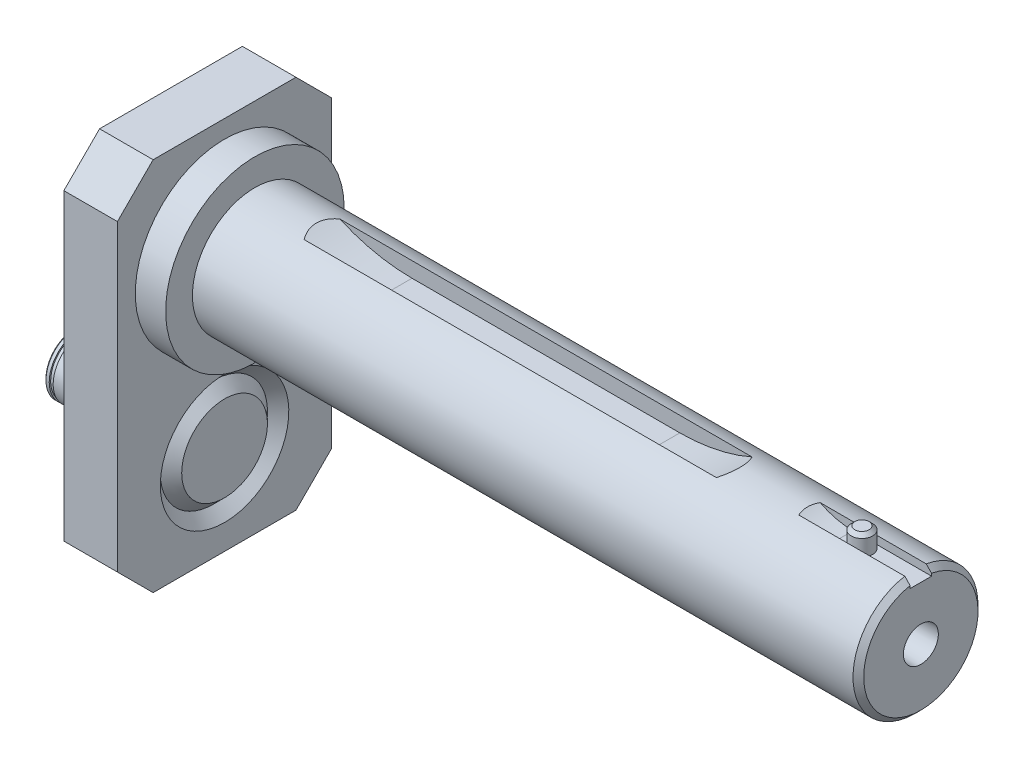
ISO-10303-21;
HEADER;
FILE_DESCRIPTION(('STEP AP214'),'2;1');
FILE_NAME('part.step','',(''),(''),'','','');
FILE_SCHEMA(('AUTOMOTIVE_DESIGN { 1 0 10303 214 1 1 1 1 }'));
ENDSEC;
DATA;
#1=APPLICATION_CONTEXT('core data for automotive mechanical design processes');
#2=APPLICATION_PROTOCOL_DEFINITION('international standard','automotive_design',2000,#1);
#3=PRODUCT_CONTEXT('',#1,'mechanical');
#4=PRODUCT('Part','Part','',(#3));
#5=PRODUCT_RELATED_PRODUCT_CATEGORY('part','',(#4));
#6=PRODUCT_DEFINITION_FORMATION('','',#4);
#7=PRODUCT_DEFINITION_CONTEXT('part definition',#1,'design');
#8=PRODUCT_DEFINITION('design','',#6,#7);
#9=PRODUCT_DEFINITION_SHAPE('','',#8);
#10=(LENGTH_UNIT() NAMED_UNIT(*) SI_UNIT(.MILLI.,.METRE.));
#11=(NAMED_UNIT(*) PLANE_ANGLE_UNIT() SI_UNIT($,.RADIAN.));
#12=(NAMED_UNIT(*) SI_UNIT($,.STERADIAN.) SOLID_ANGLE_UNIT());
#13=UNCERTAINTY_MEASURE_WITH_UNIT(LENGTH_MEASURE(1.E-05),#10,'distance_accuracy_value','');
#14=(GEOMETRIC_REPRESENTATION_CONTEXT(3) GLOBAL_UNCERTAINTY_ASSIGNED_CONTEXT((#13)) GLOBAL_UNIT_ASSIGNED_CONTEXT((#10,
#11,#12)) REPRESENTATION_CONTEXT('',''));
#15=CARTESIAN_POINT('',(0.,0.,0.));
#16=DIRECTION('',(0.,0.,1.));
#17=DIRECTION('',(1.,0.,0.));
#18=AXIS2_PLACEMENT_3D('',#15,#16,#17);
#19=CARTESIAN_POINT('',(193.5,20.5000000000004,0.));
#20=DIRECTION('',(0.,-1.00000000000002,0.));
#21=DIRECTION('',(0.,0.,-1.00000000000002));
#22=AXIS2_PLACEMENT_3D('',#19,#20,#21);
#23=CYLINDRICAL_SURFACE('',#22,3.);
#24=CARTESIAN_POINT('',(193.5,19.5000000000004,0.));
#25=DIRECTION('',(0.,1.00000000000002,0.));
#26=DIRECTION('',(0.,0.,1.00000000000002));
#27=AXIS2_PLACEMENT_3D('',#24,#25,#26);
#28=CIRCLE('',#27,3.);
#29=CARTESIAN_POINT('',(193.5,19.5000000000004,3.00000000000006));
#30=VERTEX_POINT('',#29);
#31=EDGE_CURVE('P0_E10',#30,#30,#28,.F.);
#32=ORIENTED_EDGE('',*,*,#31,.T.);
#33=EDGE_LOOP('',(#32));
#34=FACE_BOUND('',#33,.T.);
#35=CARTESIAN_POINT('',(193.5,5.50000000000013,0.));
#36=DIRECTION('',(0.,1.00000000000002,0.));
#37=DIRECTION('',(0.,0.,1.00000000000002));
#38=AXIS2_PLACEMENT_3D('',#35,#36,#37);
#39=CIRCLE('',#38,3.);
#40=CARTESIAN_POINT('',(193.5,5.50000000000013,3.00000000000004));
#41=VERTEX_POINT('',#40);
#42=EDGE_CURVE('P0_E25',#41,#41,#39,.T.);
#43=ORIENTED_EDGE('',*,*,#42,.T.);
#44=EDGE_LOOP('',(#43));
#45=FACE_BOUND('',#44,.T.);
#46=ADVANCED_FACE('P0_F14',(#34,#45),#23,.T.);
#47=CARTESIAN_POINT('',(193.5,20.5000000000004,0.));
#48=DIRECTION('',(0.,1.00000000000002,0.));
#49=DIRECTION('',(0.,0.,1.00000000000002));
#50=AXIS2_PLACEMENT_3D('',#47,#48,#49);
#51=PLANE('',#50);
#52=CARTESIAN_POINT('',(193.5,20.5000000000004,0.));
#53=DIRECTION('',(0.,1.00000000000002,0.));
#54=DIRECTION('',(0.,0.,1.00000000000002));
#55=AXIS2_PLACEMENT_3D('',#52,#53,#54);
#56=CIRCLE('',#55,2.);
#57=CARTESIAN_POINT('',(193.5,20.5000000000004,2.00000000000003));
#58=VERTEX_POINT('',#57);
#59=EDGE_CURVE('P0_E21',#58,#58,#56,.T.);
#60=ORIENTED_EDGE('',*,*,#59,.T.);
#61=EDGE_LOOP('',(#60));
#62=FACE_BOUND('',#61,.T.);
#63=ADVANCED_FACE('P0_F35',(#62),#51,.T.);
#64=CARTESIAN_POINT('',(193.5,5.50000000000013,0.));
#65=DIRECTION('',(0.,1.00000000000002,0.));
#66=DIRECTION('',(0.,0.,1.00000000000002));
#67=AXIS2_PLACEMENT_3D('',#64,#65,#66);
#68=PLANE('',#67);
#69=ORIENTED_EDGE('',*,*,#42,.F.);
#70=EDGE_LOOP('',(#69));
#71=FACE_BOUND('',#70,.T.);
#72=ADVANCED_FACE('P0_F33',(#71),#68,.F.);
#73=CARTESIAN_POINT('',(193.5,20.5000000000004,0.));
#74=DIRECTION('',(0.,-1.00000000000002,0.));
#75=DIRECTION('',(0.,0.,-1.00000000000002));
#76=AXIS2_PLACEMENT_3D('',#73,#74,#75);
#77=CONICAL_SURFACE('',#76,2.,0.785398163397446);
#78=ORIENTED_EDGE('',*,*,#31,.F.);
#79=EDGE_LOOP('',(#78));
#80=FACE_BOUND('',#79,.T.);
#81=ORIENTED_EDGE('',*,*,#59,.F.);
#82=EDGE_LOOP('',(#81));
#83=FACE_BOUND('',#82,.T.);
#84=ADVANCED_FACE('P0_F16',(#80,#83),#77,.T.);
#85=CLOSED_SHELL('',(#46,#63,#72,#84));
#86=MANIFOLD_SOLID_BREP('P0_B1',#85);
#87=CARTESIAN_POINT('',(-27.,-50.0000000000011,0.));
#88=DIRECTION('',(-1.,0.,0.));
#89=DIRECTION('',(0.,0.,1.00000000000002));
#90=AXIS2_PLACEMENT_3D('',#87,#88,#89);
#91=CYLINDRICAL_SURFACE('',#90,2.5);
#92=CARTESIAN_POINT('',(-13.3,-50.0000000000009,-2.50000000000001));
#93=CARTESIAN_POINT('',(-13.3000049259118,-49.9462534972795,-2.49999635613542));
#94=CARTESIAN_POINT('',(-13.3043588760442,-49.8924137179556,-2.49824647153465));
#95=CARTESIAN_POINT('',(-13.3216238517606,-49.786251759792,-2.4914172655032));
#96=CARTESIAN_POINT('',(-13.3345581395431,-49.7339341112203,-2.48632889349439));
#97=CARTESIAN_POINT('',(-13.3684380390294,-49.6325230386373,-2.47337104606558));
#98=CARTESIAN_POINT('',(-13.3893574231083,-49.5834196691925,-2.46551068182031));
#99=CARTESIAN_POINT('',(-13.4385095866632,-49.4894640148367,-2.44778305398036));
#100=CARTESIAN_POINT('',(-13.4667398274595,-49.4446102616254,-2.4379164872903));
#101=CARTESIAN_POINT('',(-13.5311177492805,-49.3582494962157,-2.41665443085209));
#102=CARTESIAN_POINT('',(-13.5675533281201,-49.3169688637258,-2.40521148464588));
#103=CARTESIAN_POINT('',(-13.6467000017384,-49.2409124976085,-2.38230288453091));
#104=CARTESIAN_POINT('',(-13.6894141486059,-49.2061399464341,-2.37083722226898));
#105=CARTESIAN_POINT('',(-13.7822140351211,-49.1425627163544,-2.34861395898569));
#106=CARTESIAN_POINT('',(-13.8325432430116,-49.1140925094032,-2.33791057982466));
#107=CARTESIAN_POINT('',(-13.93776819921,-49.0661226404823,-2.31916823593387));
#108=CARTESIAN_POINT('',(-13.9926617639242,-49.046618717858,-2.31112800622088));
#109=CARTESIAN_POINT('',(-14.102856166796,-49.0180505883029,-2.29913178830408));
#110=CARTESIAN_POINT('',(-14.1580256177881,-49.008553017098,-2.29500710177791));
#111=CARTESIAN_POINT('',(-14.2693174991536,-48.9989135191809,-2.29082002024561));
#112=CARTESIAN_POINT('',(-14.3254394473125,-48.9987669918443,-2.29075562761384));
#113=CARTESIAN_POINT('',(-14.432878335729,-49.0075053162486,-2.29455250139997));
#114=CARTESIAN_POINT('',(-14.4842578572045,-49.0157623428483,-2.29814087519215));
#115=CARTESIAN_POINT('',(-14.5848297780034,-49.040026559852,-2.30838093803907));
#116=CARTESIAN_POINT('',(-14.6340217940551,-49.0560351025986,-2.31503316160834));
#117=CARTESIAN_POINT('',(-14.730008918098,-49.0956526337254,-2.33079742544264));
#118=CARTESIAN_POINT('',(-14.7767346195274,-49.1194100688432,-2.33995689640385));
#119=CARTESIAN_POINT('',(-14.8657079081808,-49.1737467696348,-2.35969058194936));
#120=CARTESIAN_POINT('',(-14.9079538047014,-49.2043285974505,-2.37026532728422));
#121=CARTESIAN_POINT('',(-14.990204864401,-49.2742247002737,-2.39263368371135));
#122=CARTESIAN_POINT('',(-15.029784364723,-49.3140312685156,-2.40445832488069));
#123=CARTESIAN_POINT('',(-15.101842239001,-49.3998427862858,-2.42729912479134));
#124=CARTESIAN_POINT('',(-15.1343191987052,-49.4458489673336,-2.43831512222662));
#125=CARTESIAN_POINT('',(-15.1918087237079,-49.5439611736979,-2.45857340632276));
#126=CARTESIAN_POINT('',(-15.2166611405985,-49.5961697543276,-2.46777635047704));
#127=CARTESIAN_POINT('',(-15.257083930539,-49.7044881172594,-2.48307414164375));
#128=CARTESIAN_POINT('',(-15.2726590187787,-49.760595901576,-2.48917056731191));
#129=CARTESIAN_POINT('',(-15.2932241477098,-49.871552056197,-2.49728069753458));
#130=CARTESIAN_POINT('',(-15.2987862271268,-49.9262783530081,-2.49951472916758));
#131=CARTESIAN_POINT('',(-15.3008565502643,-50.0359226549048,-2.50034239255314));
#132=CARTESIAN_POINT('',(-15.2973671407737,-50.0908406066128,-2.49893696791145));
#133=CARTESIAN_POINT('',(-15.281854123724,-50.1967163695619,-2.49278783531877));
#134=CARTESIAN_POINT('',(-15.2702210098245,-50.2477412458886,-2.48819695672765));
#135=CARTESIAN_POINT('',(-15.2392821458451,-50.3470677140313,-2.47629720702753));
#136=CARTESIAN_POINT('',(-15.2199754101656,-50.3953689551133,-2.46898798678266));
#137=CARTESIAN_POINT('',(-15.17360753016,-50.4895393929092,-2.45208297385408));
#138=CARTESIAN_POINT('',(-15.1463272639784,-50.5352890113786,-2.44242407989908));
#139=CARTESIAN_POINT('',(-15.0850298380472,-50.6217217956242,-2.42186682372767));
#140=CARTESIAN_POINT('',(-15.0510099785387,-50.6624029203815,-2.41096796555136));
#141=CARTESIAN_POINT('',(-14.9745649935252,-50.7403615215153,-2.38822558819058));
#142=CARTESIAN_POINT('',(-14.9317332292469,-50.7772369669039,-2.37636720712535));
#143=CARTESIAN_POINT('',(-14.8402799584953,-50.8433755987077,-2.35370836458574));
#144=CARTESIAN_POINT('',(-14.79165749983,-50.8726375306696,-2.34290807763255));
#145=CARTESIAN_POINT('',(-14.6892691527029,-50.9229037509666,-2.32357149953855));
#146=CARTESIAN_POINT('',(-14.6354580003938,-50.9438252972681,-2.31505815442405));
#147=CARTESIAN_POINT('',(-14.5246331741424,-50.9761481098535,-2.30161836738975));
#148=CARTESIAN_POINT('',(-14.4676218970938,-50.9875564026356,-2.29668927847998));
#149=CARTESIAN_POINT('',(-14.3564360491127,-50.9998578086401,-2.29135879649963));
#150=CARTESIAN_POINT('',(-14.3023525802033,-51.0014485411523,-2.29065710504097));
#151=CARTESIAN_POINT('',(-14.1947275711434,-50.9959015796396,-2.2930741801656));
#152=CARTESIAN_POINT('',(-14.1411859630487,-50.9887649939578,-2.29619246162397));
#153=CARTESIAN_POINT('',(-14.0383339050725,-50.9665356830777,-2.3056332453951));
#154=CARTESIAN_POINT('',(-13.9889398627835,-50.9517687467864,-2.31182415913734));
#155=CARTESIAN_POINT('',(-13.8933106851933,-50.9150027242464,-2.32662000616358));
#156=CARTESIAN_POINT('',(-13.8470764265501,-50.8930016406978,-2.33522560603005));
#157=CARTESIAN_POINT('',(-13.7561951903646,-50.8409363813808,-2.35449304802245));
#158=CARTESIAN_POINT('',(-13.7117906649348,-50.8104826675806,-2.36524441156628));
#159=CARTESIAN_POINT('',(-13.6285033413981,-50.7429460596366,-2.38731902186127));
#160=CARTESIAN_POINT('',(-13.5896222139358,-50.70586116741,-2.39864244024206));
#161=CARTESIAN_POINT('',(-13.5158985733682,-50.6232527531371,-2.42146783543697));
#162=CARTESIAN_POINT('',(-13.481481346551,-50.5773380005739,-2.43293378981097));
#163=CARTESIAN_POINT('',(-13.4208314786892,-50.4799501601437,-2.45400203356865));
#164=CARTESIAN_POINT('',(-13.3946026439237,-50.4284745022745,-2.46360345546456));
#165=CARTESIAN_POINT('',(-13.3516888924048,-50.3223690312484,-2.47969857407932));
#166=CARTESIAN_POINT('',(-13.3348353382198,-50.2678158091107,-2.48624681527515));
#167=CARTESIAN_POINT('',(-13.3106804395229,-50.1564382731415,-2.49572153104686));
#168=CARTESIAN_POINT('',(-13.3033487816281,-50.0996217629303,-2.49865949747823));
#169=CARTESIAN_POINT('',(-13.3003023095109,-50.0284561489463,-2.4998794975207));
#170=CARTESIAN_POINT('',(-13.2999986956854,-50.0142313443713,-2.50000096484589));
#171=CARTESIAN_POINT('',(-13.3,-50.0000000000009,-2.50000000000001));
#172=B_SPLINE_CURVE_WITH_KNOTS('',3,(#92,#93,#94,#95,#96,#97,#98,#99,#100,#101,#102,#103,#104,
#105,#106,#107,#108,#109,#110,#111,#112,#113,#114,#115,#116,#117,#118,#119,#120,#121,#122,#123,
#124,#125,#126,#127,#128,#129,#130,#131,#132,#133,#134,#135,#136,#137,#138,#139,#140,#141,#142,
#143,#144,#145,#146,#147,#148,#149,#150,#151,#152,#153,#154,#155,#156,#157,#158,#159,#160,#161,
#162,#163,#164,#165,#166,#167,#168,#169,#170,#171),.UNSPECIFIED.,.T.,.F.,(4,2,2,2,2,2,2,2,2,2,2,
2,2,2,2,2,2,2,2,2,2,2,2,2,2,2,2,2,2,2,2,2,2,2,2,2,2,2,2,4),(0.,0.161201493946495,
0.322841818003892,0.483955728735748,0.645013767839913,0.812986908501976,0.98104197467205,
1.15657629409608,1.33202711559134,1.49952052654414,1.66693153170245,1.82269164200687,
1.97847893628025,2.13744563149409,2.29647210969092,2.46779174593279,2.63914546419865,
2.81388456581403,2.98853478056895,3.15284592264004,3.31711446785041,3.47400227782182,
3.63091024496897,3.79261756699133,3.95438979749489,4.12684237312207,4.29932334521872,
4.47347522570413,4.64749836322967,4.80899836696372,4.97047786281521,5.12557159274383,
5.28070817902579,5.44472734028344,5.60879600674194,5.78350211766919,5.9582893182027,
6.12982150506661,6.30080626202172,6.34349022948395),.UNSPECIFIED.);
#173=CARTESIAN_POINT('',(-13.3,-50.0000000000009,-2.50000000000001));
#174=VERTEX_POINT('',#173);
#175=EDGE_CURVE('P1_E103',#174,#174,#172,.T.);
#176=ORIENTED_EDGE('',*,*,#175,.F.);
#177=EDGE_LOOP('',(#176));
#178=FACE_BOUND('',#177,.T.);
#179=CARTESIAN_POINT('',(-13.3,-50.0000000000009,2.50000000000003));
#180=CARTESIAN_POINT('',(-13.3000049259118,-50.0537465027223,2.49999635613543));
#181=CARTESIAN_POINT('',(-13.3043588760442,-50.1075862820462,2.49824647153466));
#182=CARTESIAN_POINT('',(-13.3216238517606,-50.2137482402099,2.49141726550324));
#183=CARTESIAN_POINT('',(-13.334558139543,-50.2660658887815,2.48632889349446));
#184=CARTESIAN_POINT('',(-13.3684380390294,-50.3674769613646,2.47337104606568));
#185=CARTESIAN_POINT('',(-13.3893574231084,-50.4165803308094,2.46551068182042));
#186=CARTESIAN_POINT('',(-13.4385095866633,-50.5105359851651,2.44778305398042));
#187=CARTESIAN_POINT('',(-13.4667398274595,-50.5553897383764,2.4379164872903));
#188=CARTESIAN_POINT('',(-13.5311177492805,-50.6417505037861,2.41665443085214));
#189=CARTESIAN_POINT('',(-13.5675533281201,-50.683031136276,2.40521148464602));
#190=CARTESIAN_POINT('',(-13.6467000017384,-50.7590875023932,2.38230288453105));
#191=CARTESIAN_POINT('',(-13.6894141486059,-50.7938600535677,2.37083722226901));
#192=CARTESIAN_POINT('',(-13.7822140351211,-50.8574372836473,2.34861395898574));
#193=CARTESIAN_POINT('',(-13.8325432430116,-50.8859074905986,2.33791057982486));
#194=CARTESIAN_POINT('',(-13.93776819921,-50.9338773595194,2.31916823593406));
#195=CARTESIAN_POINT('',(-13.9926617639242,-50.9533812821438,2.31112800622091));
#196=CARTESIAN_POINT('',(-14.102856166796,-50.9819494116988,2.29913178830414));
#197=CARTESIAN_POINT('',(-14.1580256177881,-50.9914469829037,2.29500710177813));
#198=CARTESIAN_POINT('',(-14.2693174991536,-51.0010864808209,2.29082002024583));
#199=CARTESIAN_POINT('',(-14.3254394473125,-51.0012330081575,2.2907556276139));
#200=CARTESIAN_POINT('',(-14.432878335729,-50.9924946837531,2.29455250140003));
#201=CARTESIAN_POINT('',(-14.4842578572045,-50.9842376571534,2.29814087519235));
#202=CARTESIAN_POINT('',(-14.5848297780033,-50.9599734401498,2.30838093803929));
#203=CARTESIAN_POINT('',(-14.6340217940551,-50.9439648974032,2.31503316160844));
#204=CARTESIAN_POINT('',(-14.730008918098,-50.9043473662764,2.33079742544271));
#205=CARTESIAN_POINT('',(-14.7767346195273,-50.8805899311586,2.33995689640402));
#206=CARTESIAN_POINT('',(-14.8657079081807,-50.826253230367,2.35969058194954));
#207=CARTESIAN_POINT('',(-14.9079538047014,-50.7956714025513,2.37026532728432));
#208=CARTESIAN_POINT('',(-14.990204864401,-50.7257752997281,2.39263368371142));
#209=CARTESIAN_POINT('',(-15.029784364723,-50.6859687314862,2.40445832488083));
#210=CARTESIAN_POINT('',(-15.101842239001,-50.600157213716,2.42729912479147));
#211=CARTESIAN_POINT('',(-15.1343191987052,-50.5541510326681,2.43831512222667));
#212=CARTESIAN_POINT('',(-15.1918087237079,-50.4560388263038,2.45857340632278));
#213=CARTESIAN_POINT('',(-15.2166611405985,-50.4038302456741,2.46777635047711));
#214=CARTESIAN_POINT('',(-15.257083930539,-50.2955118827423,2.48307414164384));
#215=CARTESIAN_POINT('',(-15.2726590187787,-50.2394040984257,2.48917056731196));
#216=CARTESIAN_POINT('',(-15.2932241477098,-50.1284479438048,2.49728069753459));
#217=CARTESIAN_POINT('',(-15.2987862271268,-50.0737216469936,2.49951472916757));
#218=CARTESIAN_POINT('',(-15.3008565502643,-49.964077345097,2.50034239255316));
#219=CARTESIAN_POINT('',(-15.2973671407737,-49.9091593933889,2.4989369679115));
#220=CARTESIAN_POINT('',(-15.281854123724,-49.8032836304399,2.49278783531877));
#221=CARTESIAN_POINT('',(-15.2702210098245,-49.7522587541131,2.48819695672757));
#222=CARTESIAN_POINT('',(-15.2392821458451,-49.6529322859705,2.47629720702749));
#223=CARTESIAN_POINT('',(-15.2199754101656,-49.6046310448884,2.46898798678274));
#224=CARTESIAN_POINT('',(-15.17360753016,-49.5104606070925,2.45208297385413));
#225=CARTESIAN_POINT('',(-15.1463272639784,-49.4647109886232,2.44242407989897));
#226=CARTESIAN_POINT('',(-15.0850298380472,-49.3782782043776,2.42186682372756));
#227=CARTESIAN_POINT('',(-15.0510099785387,-49.3375970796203,2.41096796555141));
#228=CARTESIAN_POINT('',(-14.9745649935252,-49.2596384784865,2.38822558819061));
#229=CARTESIAN_POINT('',(-14.9317332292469,-49.2227630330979,2.37636720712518));
#230=CARTESIAN_POINT('',(-14.8402799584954,-49.1566244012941,2.35370836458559));
#231=CARTESIAN_POINT('',(-14.79165749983,-49.1273624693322,2.34290807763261));
#232=CARTESIAN_POINT('',(-14.6892691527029,-49.0770962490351,2.32357149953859));
#233=CARTESIAN_POINT('',(-14.6354580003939,-49.0561747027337,2.31505815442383));
#234=CARTESIAN_POINT('',(-14.5246331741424,-49.0238518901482,2.30161836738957));
#235=CARTESIAN_POINT('',(-14.4676218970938,-49.0124435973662,2.29668927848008));
#236=CARTESIAN_POINT('',(-14.3564360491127,-49.0001421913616,2.2913587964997));
#237=CARTESIAN_POINT('',(-14.3023525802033,-48.9985514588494,2.29065710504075));
#238=CARTESIAN_POINT('',(-14.1947275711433,-49.0040984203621,2.29307418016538));
#239=CARTESIAN_POINT('',(-14.1411859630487,-49.011235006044,2.29619246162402));
#240=CARTESIAN_POINT('',(-14.0383339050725,-49.033464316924,2.30563324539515));
#241=CARTESIAN_POINT('',(-13.9889398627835,-49.0482312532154,2.31182415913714));
#242=CARTESIAN_POINT('',(-13.8933106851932,-49.0849972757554,2.3266200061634));
#243=CARTESIAN_POINT('',(-13.8470764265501,-49.106998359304,2.33522560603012));
#244=CARTESIAN_POINT('',(-13.7561951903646,-49.159063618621,2.35449304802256));
#245=CARTESIAN_POINT('',(-13.7117906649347,-49.1895173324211,2.36524441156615));
#246=CARTESIAN_POINT('',(-13.6285033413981,-49.2570539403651,2.38731902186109));
#247=CARTESIAN_POINT('',(-13.5896222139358,-49.2941388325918,2.39864244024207));
#248=CARTESIAN_POINT('',(-13.5158985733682,-49.3767472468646,2.42146783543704));
#249=CARTESIAN_POINT('',(-13.481481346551,-49.4226619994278,2.43293378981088));
#250=CARTESIAN_POINT('',(-13.4208314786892,-49.520049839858,2.45400203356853));
#251=CARTESIAN_POINT('',(-13.3946026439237,-49.5715254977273,2.46360345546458));
#252=CARTESIAN_POINT('',(-13.3516888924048,-49.6776309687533,2.47969857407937));
#253=CARTESIAN_POINT('',(-13.3348353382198,-49.732184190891,2.48624681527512));
#254=CARTESIAN_POINT('',(-13.3106804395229,-49.8435617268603,2.4957215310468));
#255=CARTESIAN_POINT('',(-13.3033487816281,-49.9003782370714,2.49865949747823));
#256=CARTESIAN_POINT('',(-13.3003023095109,-49.9715438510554,2.49987949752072));
#257=CARTESIAN_POINT('',(-13.2999986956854,-49.9857686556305,2.50000096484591));
#258=CARTESIAN_POINT('',(-13.3,-50.0000000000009,2.50000000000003));
#259=B_SPLINE_CURVE_WITH_KNOTS('',3,(#179,#180,#181,#182,#183,#184,#185,#186,#187,#188,#189,
#190,#191,#192,#193,#194,#195,#196,#197,#198,#199,#200,#201,#202,#203,#204,#205,#206,#207,#208,
#209,#210,#211,#212,#213,#214,#215,#216,#217,#218,#219,#220,#221,#222,#223,#224,#225,#226,#227,
#228,#229,#230,#231,#232,#233,#234,#235,#236,#237,#238,#239,#240,#241,#242,#243,#244,#245,#246,
#247,#248,#249,#250,#251,#252,#253,#254,#255,#256,#257,#258),.UNSPECIFIED.,.T.,.F.,(4,2,2,2,2,2,
2,2,2,2,2,2,2,2,2,2,2,2,2,2,2,2,2,2,2,2,2,2,2,2,2,2,2,2,2,2,2,2,2,4),(0.,0.161201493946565,
0.322841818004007,0.483955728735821,0.645013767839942,0.812986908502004,0.981041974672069,
1.15657629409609,1.33202711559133,1.49952052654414,1.66693153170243,1.82269164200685,
1.97847893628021,2.13744563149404,2.29647210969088,2.46779174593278,2.63914546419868,
2.81388456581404,2.98853478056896,3.15284592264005,3.31711446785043,3.47400227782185,
3.630910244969,3.79261756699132,3.95438979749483,4.12684237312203,4.29932334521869,
4.47347522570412,4.64749836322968,4.80899836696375,4.97047786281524,5.12557159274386,
5.28070817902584,5.44472734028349,5.60879600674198,5.78350211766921,5.95828931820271,
6.12982150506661,6.3008062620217,6.34349022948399),.UNSPECIFIED.);
#260=CARTESIAN_POINT('',(-13.3,-50.0000000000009,2.50000000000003));
#261=VERTEX_POINT('',#260);
#262=EDGE_CURVE('P1_E88',#261,#261,#259,.T.);
#263=ORIENTED_EDGE('',*,*,#262,.F.);
#264=EDGE_LOOP('',(#263));
#265=FACE_BOUND('',#264,.T.);
#266=CARTESIAN_POINT('',(-20.6995696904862,-50.0000000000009,0.));
#267=DIRECTION('',(-1.,0.,0.));
#268=DIRECTION('',(0.,0.,1.00000000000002));
#269=AXIS2_PLACEMENT_3D('',#266,#267,#268);
#270=CIRCLE('',#269,2.5);
#271=CARTESIAN_POINT('',(-20.6995696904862,-50.0000000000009,2.50000000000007));
#272=VERTEX_POINT('',#271);
#273=EDGE_CURVE('P1_E85',#272,#272,#270,.T.);
#274=ORIENTED_EDGE('',*,*,#273,.T.);
#275=EDGE_LOOP('',(#274));
#276=FACE_BOUND('',#275,.T.);
#277=CARTESIAN_POINT('',(7.5,-50.0000000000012,0.));
#278=DIRECTION('',(-0.707106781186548,0.707106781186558,0.));
#279=DIRECTION('',(-0.707106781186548,-0.707106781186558,0.));
#280=AXIS2_PLACEMENT_3D('',#277,#278,#279);
#281=ELLIPSE('',#280,3.53553390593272,2.5);
#282=CARTESIAN_POINT('',(7.5,-50.0000000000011,2.50000000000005));
#283=VERTEX_POINT('',#282);
#284=CARTESIAN_POINT('',(7.50000000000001,-50.0000000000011,-2.50000000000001));
#285=VERTEX_POINT('',#284);
#286=EDGE_CURVE('P1_E43',#283,#285,#281,.F.);
#287=ORIENTED_EDGE('',*,*,#286,.T.);
#288=CARTESIAN_POINT('',(7.5,-50.0000000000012,0.));
#289=DIRECTION('',(-0.707106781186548,-0.707106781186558,0.));
#290=DIRECTION('',(-0.707106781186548,0.707106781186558,0.));
#291=AXIS2_PLACEMENT_3D('',#288,#289,#290);
#292=ELLIPSE('',#291,3.53553390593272,2.5);
#293=EDGE_CURVE('P1_E182',#285,#283,#292,.F.);
#294=ORIENTED_EDGE('',*,*,#293,.T.);
#295=EDGE_LOOP('',(#287,#294));
#296=FACE_BOUND('',#295,.T.);
#297=ADVANCED_FACE('P1_F16',(#178,#265,#276,#296),#91,.F.);
#298=CARTESIAN_POINT('',(-27.,-41.5000000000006,0.));
#299=DIRECTION('',(1.,0.,0.));
#300=DIRECTION('',(0.,0.,-1.00000000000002));
#301=AXIS2_PLACEMENT_3D('',#298,#299,#300);
#302=PLANE('',#301);
#303=CARTESIAN_POINT('',(-27.,-50.0000000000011,0.));
#304=DIRECTION('',(1.,0.,0.));
#305=DIRECTION('',(0.,0.,-1.00000000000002));
#306=AXIS2_PLACEMENT_3D('',#303,#304,#305);
#307=CIRCLE('',#306,8.);
#308=CARTESIAN_POINT('',(-27.,-50.0000000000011,-8.00000000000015));
#309=VERTEX_POINT('',#308);
#310=EDGE_CURVE('P1_E225',#309,#309,#307,.F.);
#311=ORIENTED_EDGE('',*,*,#310,.T.);
#312=EDGE_LOOP('',(#311));
#313=FACE_BOUND('',#312,.T.);
#314=CARTESIAN_POINT('',(-27.,-50.0000000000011,0.));
#315=DIRECTION('',(-1.,0.,0.));
#316=DIRECTION('',(0.,0.,1.00000000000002));
#317=AXIS2_PLACEMENT_3D('',#314,#315,#316);
#318=CIRCLE('',#317,3.);
#319=CARTESIAN_POINT('',(-27.,-50.0000000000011,3.00000000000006));
#320=VERTEX_POINT('',#319);
#321=EDGE_CURVE('P1_E90',#320,#320,#318,.T.);
#322=ORIENTED_EDGE('',*,*,#321,.F.);
#323=EDGE_LOOP('',(#322));
#324=FACE_BOUND('',#323,.T.);
#325=ADVANCED_FACE('P1_F121',(#313,#324),#302,.F.);
#326=CARTESIAN_POINT('',(-14.3,-50.0000000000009,-10.0000000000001));
#327=DIRECTION('',(0.,0.,1.00000000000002));
#328=DIRECTION('',(1.,0.,0.));
#329=AXIS2_PLACEMENT_3D('',#326,#327,#328);
#330=CYLINDRICAL_SURFACE('',#329,1.);
#331=ORIENTED_EDGE('',*,*,#175,.T.);
#332=EDGE_LOOP('',(#331));
#333=FACE_BOUND('',#332,.T.);
#334=CARTESIAN_POINT('',(-13.3,-50.0000000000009,-7.50000000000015));
#335=CARTESIAN_POINT('',(-13.3000023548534,-49.9440955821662,-7.4999991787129));
#336=CARTESIAN_POINT('',(-13.3047037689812,-49.8881570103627,-7.49936835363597));
#337=CARTESIAN_POINT('',(-13.3233831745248,-49.7778386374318,-7.49691255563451));
#338=CARTESIAN_POINT('',(-13.3373706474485,-49.7234604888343,-7.49508636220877));
#339=CARTESIAN_POINT('',(-13.3742008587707,-49.6178758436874,-7.49044539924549));
#340=CARTESIAN_POINT('',(-13.3970374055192,-49.5666671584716,-7.48763132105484));
#341=CARTESIAN_POINT('',(-13.4509034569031,-49.4688180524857,-7.48132693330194));
#342=CARTESIAN_POINT('',(-13.4819316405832,-49.4221768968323,-7.47783673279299));
#343=CARTESIAN_POINT('',(-13.5515066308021,-49.3344870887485,-7.47054497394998));
#344=CARTESIAN_POINT('',(-13.5900943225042,-49.2934710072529,-7.46674179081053));
#345=CARTESIAN_POINT('',(-13.6736050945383,-49.2184763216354,-7.45926568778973));
#346=CARTESIAN_POINT('',(-13.7185285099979,-49.1844980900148,-7.45559277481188));
#347=CARTESIAN_POINT('',(-13.8136495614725,-49.1244204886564,-7.44877717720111));
#348=CARTESIAN_POINT('',(-13.8638668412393,-49.098351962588,-7.44563658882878));
#349=CARTESIAN_POINT('',(-13.9680155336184,-49.0550307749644,-7.44026293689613));
#350=CARTESIAN_POINT('',(-14.0219467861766,-49.0377777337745,-7.43802983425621));
#351=CARTESIAN_POINT('',(-14.1316529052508,-49.01267696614,-7.4347396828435));
#352=CARTESIAN_POINT('',(-14.1874149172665,-49.0047739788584,-7.43367572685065));
#353=CARTESIAN_POINT('',(-14.299483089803,-48.9984265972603,-7.43282325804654));
#354=CARTESIAN_POINT('',(-14.3557892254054,-48.9999817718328,-7.43303468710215));
#355=CARTESIAN_POINT('',(-14.466960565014,-49.0124612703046,-7.43470277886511));
#356=CARTESIAN_POINT('',(-14.5218327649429,-49.023324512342,-7.43615132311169));
#357=CARTESIAN_POINT('',(-14.62896841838,-49.0540163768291,-7.44011776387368));
#358=CARTESIAN_POINT('',(-14.6812318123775,-49.0738452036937,-7.44263568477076));
#359=CARTESIAN_POINT('',(-14.7818548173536,-49.121970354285,-7.44846630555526));
#360=CARTESIAN_POINT('',(-14.8302016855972,-49.1502930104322,-7.45178147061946));
#361=CARTESIAN_POINT('',(-14.9214795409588,-49.2145830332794,-7.45883118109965));
#362=CARTESIAN_POINT('',(-14.9644102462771,-49.250550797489,-7.4625657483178));
#363=CARTESIAN_POINT('',(-15.0439915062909,-49.3294475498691,-7.47006949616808));
#364=CARTESIAN_POINT('',(-15.0805899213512,-49.3724291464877,-7.47383871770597));
#365=CARTESIAN_POINT('',(-15.1460610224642,-49.4639529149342,-7.4809596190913));
#366=CARTESIAN_POINT('',(-15.1749336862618,-49.5124951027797,-7.48431129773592));
#367=CARTESIAN_POINT('',(-15.2241345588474,-49.6138038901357,-7.49022196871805));
#368=CARTESIAN_POINT('',(-15.2444592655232,-49.6665722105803,-7.49278063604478));
#369=CARTESIAN_POINT('',(-15.2759446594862,-49.7748145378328,-7.49681412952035));
#370=CARTESIAN_POINT('',(-15.2871058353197,-49.8302884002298,-7.49828901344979));
#371=CARTESIAN_POINT('',(-15.2998792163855,-49.9419165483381,-7.49998120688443));
#372=CARTESIAN_POINT('',(-15.3015632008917,-49.9980624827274,-7.50020796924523));
#373=CARTESIAN_POINT('',(-15.2955241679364,-50.1098358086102,-7.49940395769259));
#374=CARTESIAN_POINT('',(-15.2878013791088,-50.1654632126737,-7.49837321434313));
#375=CARTESIAN_POINT('',(-15.263227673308,-50.2744068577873,-7.49517587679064));
#376=CARTESIAN_POINT('',(-15.2464112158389,-50.3277310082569,-7.49301357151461));
#377=CARTESIAN_POINT('',(-15.2041635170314,-50.4308025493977,-7.48779504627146));
#378=CARTESIAN_POINT('',(-15.1787319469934,-50.4805498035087,-7.48473879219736));
#379=CARTESIAN_POINT('',(-15.1198039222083,-50.575374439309,-7.47804918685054));
#380=CARTESIAN_POINT('',(-15.0862613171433,-50.6204229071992,-7.47441257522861));
#381=CARTESIAN_POINT('',(-15.0121283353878,-50.7042764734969,-7.46697864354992));
#382=CARTESIAN_POINT('',(-14.9715376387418,-50.7430812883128,-7.46318131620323));
#383=CARTESIAN_POINT('',(-14.8841434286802,-50.8136027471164,-7.45582451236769));
#384=CARTESIAN_POINT('',(-14.8373012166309,-50.8452716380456,-7.45226674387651));
#385=CARTESIAN_POINT('',(-14.7389202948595,-50.900291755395,-7.44582066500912));
#386=CARTESIAN_POINT('',(-14.6873816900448,-50.9236431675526,-7.44293233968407));
#387=CARTESIAN_POINT('',(-14.5812213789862,-50.9612891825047,-7.43816405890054));
#388=CARTESIAN_POINT('',(-14.5266091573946,-50.9756101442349,-7.43628117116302));
#389=CARTESIAN_POINT('',(-14.4157281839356,-50.9948733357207,-7.43372874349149));
#390=CARTESIAN_POINT('',(-14.3594595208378,-50.9998160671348,-7.43305913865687));
#391=CARTESIAN_POINT('',(-14.2473382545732,-51.0001724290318,-7.43301115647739));
#392=CARTESIAN_POINT('',(-14.1914858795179,-50.9956610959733,-7.43362261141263));
#393=CARTESIAN_POINT('',(-14.081341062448,-50.9773968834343,-7.43604591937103));
#394=CARTESIAN_POINT('',(-14.027048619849,-50.9636440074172,-7.43785777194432));
#395=CARTESIAN_POINT('',(-13.9215781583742,-50.9273115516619,-7.44247445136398));
#396=CARTESIAN_POINT('',(-13.8703986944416,-50.9047361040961,-7.44527881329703));
#397=CARTESIAN_POINT('',(-13.7725420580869,-50.8514067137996,-7.45156522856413));
#398=CARTESIAN_POINT('',(-13.725864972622,-50.820652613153,-7.45504729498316));
#399=CARTESIAN_POINT('',(-13.6379551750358,-50.7515622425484,-7.46232983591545));
#400=CARTESIAN_POINT('',(-13.5967665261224,-50.7131701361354,-7.46613252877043));
#401=CARTESIAN_POINT('',(-13.5213883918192,-50.63001084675,-7.47360859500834));
#402=CARTESIAN_POINT('',(-13.4872005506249,-50.5852421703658,-7.47728193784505));
#403=CARTESIAN_POINT('',(-13.4266664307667,-50.4903764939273,-7.48410317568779));
#404=CARTESIAN_POINT('',(-13.4003546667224,-50.4402573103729,-7.48724873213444));
#405=CARTESIAN_POINT('',(-13.3565597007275,-50.3362962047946,-7.49263660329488));
#406=CARTESIAN_POINT('',(-13.3390670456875,-50.2824583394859,-7.49487988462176));
#407=CARTESIAN_POINT('',(-13.3175259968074,-50.1902942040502,-7.49767860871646));
#408=CARTESIAN_POINT('',(-13.3109633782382,-50.1525455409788,-7.49854481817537));
#409=CARTESIAN_POINT('',(-13.3021995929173,-50.076536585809,-7.49970579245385));
#410=CARTESIAN_POINT('',(-13.2999983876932,-50.0382762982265,-7.50000056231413));
#411=CARTESIAN_POINT('',(-13.3,-50.0000000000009,-7.50000000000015));
#412=B_SPLINE_CURVE_WITH_KNOTS('',3,(#334,#335,#336,#337,#338,#339,#340,#341,#342,#343,#344,
#345,#346,#347,#348,#349,#350,#351,#352,#353,#354,#355,#356,#357,#358,#359,#360,#361,#362,#363,
#364,#365,#366,#367,#368,#369,#370,#371,#372,#373,#374,#375,#376,#377,#378,#379,#380,#381,#382,
#383,#384,#385,#386,#387,#388,#389,#390,#391,#392,#393,#394,#395,#396,#397,#398,#399,#400,#401,
#402,#403,#404,#405,#406,#407,#408,#409,#410,#411),.UNSPECIFIED.,.T.,.F.,(4,2,2,2,2,2,2,2,2,2,2,
2,2,2,2,2,2,2,2,2,2,2,2,2,2,2,2,2,2,2,2,2,2,2,2,2,2,2,4),(0.,0.167573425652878,
0.335318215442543,0.502945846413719,0.670546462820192,0.839079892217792,1.00762223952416,
1.17681360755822,1.34599768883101,1.5141767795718,1.6823482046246,1.84942442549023,
2.01650445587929,2.18410791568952,2.351720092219,2.52065272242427,2.68958583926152,
2.85858810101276,3.02758135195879,3.19529292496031,3.36300042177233,3.5300768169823,
3.69715958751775,3.86521637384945,4.03328079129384,4.20243852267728,4.37159247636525,
4.54025037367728,4.70889924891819,4.87621463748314,5.04352996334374,5.21076701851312,
5.37800730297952,5.54651833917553,5.71506890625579,5.88434763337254,6.05344452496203,
6.16817869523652,6.28291185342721),.UNSPECIFIED.);
#413=CARTESIAN_POINT('',(-15.3,-50.0000000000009,-7.50000000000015));
#414=VERTEX_POINT('',#413);
#415=CARTESIAN_POINT('',(-13.3,-50.0000000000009,-7.50000000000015));
#416=VERTEX_POINT('',#415);
#417=EDGE_CURVE('P1_E104',#414,#416,#412,.T.);
#418=ORIENTED_EDGE('',*,*,#417,.F.);
#419=EDGE_CURVE('P1_E242',#416,#414,#412,.T.);
#420=ORIENTED_EDGE('',*,*,#419,.F.);
#421=EDGE_LOOP('',(#418,#420));
#422=FACE_BOUND('',#421,.T.);
#423=ADVANCED_FACE('P1_F119',(#333,#422),#330,.F.);
#424=CARTESIAN_POINT('',(-27.,-50.0000000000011,0.));
#425=DIRECTION('',(-1.,0.,0.));
#426=DIRECTION('',(0.,0.,1.00000000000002));
#427=AXIS2_PLACEMENT_3D('',#424,#425,#426);
#428=CYLINDRICAL_SURFACE('',#427,7.5);
#429=CARTESIAN_POINT('',(-13.3,-50.0000000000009,0.));
#430=DIRECTION('',(-1.,0.,0.));
#431=DIRECTION('',(0.,0.,1.00000000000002));
#432=AXIS2_PLACEMENT_3D('',#429,#430,#431);
#433=CIRCLE('',#432,7.5);
#434=CARTESIAN_POINT('',(-13.3,-50.0000000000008,7.50000000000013));
#435=VERTEX_POINT('',#434);
#436=EDGE_CURVE('P1_E260',#416,#435,#433,.T.);
#437=ORIENTED_EDGE('',*,*,#436,.T.);
#438=CARTESIAN_POINT('',(-13.3,-50.0000000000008,7.50000000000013));
#439=CARTESIAN_POINT('',(-13.3000023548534,-50.0559044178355,7.49999917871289));
#440=CARTESIAN_POINT('',(-13.3047037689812,-50.111842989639,7.49936835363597));
#441=CARTESIAN_POINT('',(-13.3233831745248,-50.2221613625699,7.49691255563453));
#442=CARTESIAN_POINT('',(-13.3373706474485,-50.2765395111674,7.49508636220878));
#443=CARTESIAN_POINT('',(-13.3742008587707,-50.3821241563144,7.49044539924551));
#444=CARTESIAN_POINT('',(-13.3970374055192,-50.4333328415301,7.48763132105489));
#445=CARTESIAN_POINT('',(-13.4509034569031,-50.531181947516,7.48132693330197));
#446=CARTESIAN_POINT('',(-13.4819316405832,-50.5778231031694,7.47783673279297));
#447=CARTESIAN_POINT('',(-13.5515066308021,-50.6655129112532,7.47054497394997));
#448=CARTESIAN_POINT('',(-13.5900943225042,-50.7065289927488,7.46674179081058));
#449=CARTESIAN_POINT('',(-13.6736050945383,-50.7815236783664,7.45926568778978));
#450=CARTESIAN_POINT('',(-13.7185285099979,-50.815501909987,7.45559277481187));
#451=CARTESIAN_POINT('',(-13.8136495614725,-50.8755795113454,7.44877717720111));
#452=CARTESIAN_POINT('',(-13.8638668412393,-50.9016480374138,7.44563658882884));
#453=CARTESIAN_POINT('',(-13.9680155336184,-50.9449692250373,7.44026293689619));
#454=CARTESIAN_POINT('',(-14.0219467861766,-50.9622222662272,7.43802983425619));
#455=CARTESIAN_POINT('',(-14.1316529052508,-50.9873230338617,7.43473968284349));
#456=CARTESIAN_POINT('',(-14.1874149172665,-50.9952260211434,7.43367572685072));
#457=CARTESIAN_POINT('',(-14.299483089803,-51.0015734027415,7.4328232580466));
#458=CARTESIAN_POINT('',(-14.3557892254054,-51.0000182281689,7.43303468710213));
#459=CARTESIAN_POINT('',(-14.466960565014,-50.9875387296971,7.43470277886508));
#460=CARTESIAN_POINT('',(-14.5218327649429,-50.9766754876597,7.43615132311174));
#461=CARTESIAN_POINT('',(-14.62896841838,-50.9459836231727,7.44011776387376));
#462=CARTESIAN_POINT('',(-14.6812318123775,-50.9261547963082,7.44263568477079));
#463=CARTESIAN_POINT('',(-14.7818548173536,-50.8780296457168,7.44846630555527));
#464=CARTESIAN_POINT('',(-14.8302016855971,-50.8497069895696,7.45178147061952));
#465=CARTESIAN_POINT('',(-14.9214795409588,-50.7854169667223,7.4588311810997));
#466=CARTESIAN_POINT('',(-14.9644102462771,-50.7494492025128,7.46256574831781));
#467=CARTESIAN_POINT('',(-15.0439915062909,-50.6705524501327,7.47006949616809));
#468=CARTESIAN_POINT('',(-15.0805899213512,-50.6275708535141,7.47383871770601));
#469=CARTESIAN_POINT('',(-15.1460610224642,-50.5360470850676,7.48095961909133));
#470=CARTESIAN_POINT('',(-15.1749336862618,-50.487504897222,7.48431129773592));
#471=CARTESIAN_POINT('',(-15.2241345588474,-50.3861961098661,7.49022196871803));
#472=CARTESIAN_POINT('',(-15.2444592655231,-50.3334277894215,7.49278063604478));
#473=CARTESIAN_POINT('',(-15.2759446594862,-50.225185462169,7.49681412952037));
#474=CARTESIAN_POINT('',(-15.2871058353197,-50.1697115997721,7.49828901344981));
#475=CARTESIAN_POINT('',(-15.2998792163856,-50.0580834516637,7.49998120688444));
#476=CARTESIAN_POINT('',(-15.3015632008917,-50.0019375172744,7.50020796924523));
#477=CARTESIAN_POINT('',(-15.2955241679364,-49.8901641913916,7.49940395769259));
#478=CARTESIAN_POINT('',(-15.2878013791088,-49.8345367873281,7.49837321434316));
#479=CARTESIAN_POINT('',(-15.263227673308,-49.7255931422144,7.49517587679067));
#480=CARTESIAN_POINT('',(-15.2464112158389,-49.6722689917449,7.4930135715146));
#481=CARTESIAN_POINT('',(-15.2041635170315,-49.5691974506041,7.48779504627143));
#482=CARTESIAN_POINT('',(-15.1787319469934,-49.5194501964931,7.48473879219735));
#483=CARTESIAN_POINT('',(-15.1198039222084,-49.4246255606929,7.47804918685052));
#484=CARTESIAN_POINT('',(-15.0862613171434,-49.3795770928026,7.47441257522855));
#485=CARTESIAN_POINT('',(-15.0121283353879,-49.2957235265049,7.4669786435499));
#486=CARTESIAN_POINT('',(-14.9715376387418,-49.256918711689,7.46318131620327));
#487=CARTESIAN_POINT('',(-14.8841434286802,-49.1863972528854,7.45582451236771));
#488=CARTESIAN_POINT('',(-14.8373012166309,-49.1547283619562,7.45226674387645));
#489=CARTESIAN_POINT('',(-14.7389202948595,-49.0997082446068,7.44582066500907));
#490=CARTESIAN_POINT('',(-14.6873816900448,-49.0763568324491,7.44293233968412));
#491=CARTESIAN_POINT('',(-14.5812213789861,-49.0387108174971,7.43816405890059));
#492=CARTESIAN_POINT('',(-14.5266091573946,-49.0243898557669,7.43628117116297));
#493=CARTESIAN_POINT('',(-14.4157281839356,-49.0051266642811,7.43372874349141));
#494=CARTESIAN_POINT('',(-14.3594595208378,-49.000183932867,7.43305913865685));
#495=CARTESIAN_POINT('',(-14.2473382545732,-48.9998275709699,7.43301115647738));
#496=CARTESIAN_POINT('',(-14.1914858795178,-49.0043389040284,7.43362261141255));
#497=CARTESIAN_POINT('',(-14.081341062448,-49.0226031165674,7.43604591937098));
#498=CARTESIAN_POINT('',(-14.027048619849,-49.0363559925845,7.43785777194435));
#499=CARTESIAN_POINT('',(-13.9215781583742,-49.0726884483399,7.44247445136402));
#500=CARTESIAN_POINT('',(-13.8703986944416,-49.0952638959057,7.44527881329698));
#501=CARTESIAN_POINT('',(-13.7725420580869,-49.1485932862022,7.45156522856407));
#502=CARTESIAN_POINT('',(-13.7258649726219,-49.1793473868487,7.45504729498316));
#503=CARTESIAN_POINT('',(-13.6379551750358,-49.2484377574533,7.46232983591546));
#504=CARTESIAN_POINT('',(-13.5967665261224,-49.2868298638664,7.46613252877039));
#505=CARTESIAN_POINT('',(-13.5213883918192,-49.3699891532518,7.47360859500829));
#506=CARTESIAN_POINT('',(-13.4872005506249,-49.414757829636,7.47728193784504));
#507=CARTESIAN_POINT('',(-13.4266664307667,-49.5096235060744,7.4841031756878));
#508=CARTESIAN_POINT('',(-13.4003546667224,-49.5597426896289,7.48724873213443));
#509=CARTESIAN_POINT('',(-13.3565597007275,-49.6637037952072,7.49263660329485));
#510=CARTESIAN_POINT('',(-13.3390670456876,-49.7175416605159,7.49487988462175));
#511=CARTESIAN_POINT('',(-13.3175259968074,-49.8097057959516,7.49767860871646));
#512=CARTESIAN_POINT('',(-13.3109633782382,-49.847454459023,7.49854481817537));
#513=CARTESIAN_POINT('',(-13.3021995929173,-49.9234634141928,7.49970579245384));
#514=CARTESIAN_POINT('',(-13.2999983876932,-49.9617237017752,7.50000056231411));
#515=CARTESIAN_POINT('',(-13.3,-50.0000000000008,7.50000000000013));
#516=B_SPLINE_CURVE_WITH_KNOTS('',3,(#438,#439,#440,#441,#442,#443,#444,#445,#446,#447,#448,
#449,#450,#451,#452,#453,#454,#455,#456,#457,#458,#459,#460,#461,#462,#463,#464,#465,#466,#467,
#468,#469,#470,#471,#472,#473,#474,#475,#476,#477,#478,#479,#480,#481,#482,#483,#484,#485,#486,
#487,#488,#489,#490,#491,#492,#493,#494,#495,#496,#497,#498,#499,#500,#501,#502,#503,#504,#505,
#506,#507,#508,#509,#510,#511,#512,#513,#514,#515),.UNSPECIFIED.,.T.,.F.,(4,2,2,2,2,2,2,2,2,2,2,
2,2,2,2,2,2,2,2,2,2,2,2,2,2,2,2,2,2,2,2,2,2,2,2,2,2,2,4),(0.,0.167573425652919,
0.335318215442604,0.502945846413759,0.670546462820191,0.839079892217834,1.00762223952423,
1.17681360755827,1.34599768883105,1.51417677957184,1.68234820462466,1.84942442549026,
2.01650445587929,2.18410791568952,2.35172009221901,2.5206527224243,2.68958583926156,
2.85858810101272,3.0275813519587,3.1952929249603,3.36300042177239,3.53007681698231,
3.69715958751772,3.86521637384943,4.03328079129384,4.20243852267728,4.37159247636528,
4.54025037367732,4.70889924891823,4.87621463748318,5.0435299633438,5.21076701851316,
5.37800730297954,5.54651833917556,5.71506890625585,5.88434763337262,6.05344452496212,
6.16817869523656,6.28291185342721),.UNSPECIFIED.);
#517=CARTESIAN_POINT('',(-15.3,-50.0000000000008,7.50000000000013));
#518=VERTEX_POINT('',#517);
#519=EDGE_CURVE('P1_E102',#435,#518,#516,.T.);
#520=ORIENTED_EDGE('',*,*,#519,.T.);
#521=CARTESIAN_POINT('',(-15.3,-50.0000000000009,0.));
#522=DIRECTION('',(-1.,0.,0.));
#523=DIRECTION('',(0.,0.,1.00000000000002));
#524=AXIS2_PLACEMENT_3D('',#521,#522,#523);
#525=CIRCLE('',#524,7.5);
#526=EDGE_CURVE('P1_E256',#414,#518,#525,.T.);
#527=ORIENTED_EDGE('',*,*,#526,.F.);
#528=ORIENTED_EDGE('',*,*,#417,.T.);
#529=EDGE_LOOP('',(#437,#520,#527,#528));
#530=FACE_BOUND('',#529,.T.);
#531=ADVANCED_FACE('P1_F202',(#530),#428,.T.);
#532=CARTESIAN_POINT('',(15.,-50.0000000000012,0.));
#533=DIRECTION('',(-1.,0.,0.));
#534=DIRECTION('',(0.,0.,1.00000000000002));
#535=AXIS2_PLACEMENT_3D('',#532,#533,#534);
#536=PLANE('',#535);
#537=CARTESIAN_POINT('',(15.,-50.0000000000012,0.));
#538=DIRECTION('',(-1.,0.,0.));
#539=DIRECTION('',(0.,0.,1.00000000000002));
#540=AXIS2_PLACEMENT_3D('',#537,#538,#539);
#541=CIRCLE('',#540,12.);
#542=CARTESIAN_POINT('',(15.,-50.0000000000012,12.0000000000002));
#543=VERTEX_POINT('',#542);
#544=EDGE_CURVE('P1_E218',#543,#543,#541,.F.);
#545=ORIENTED_EDGE('',*,*,#544,.T.);
#546=EDGE_LOOP('',(#545));
#547=FACE_BOUND('',#546,.T.);
#548=ADVANCED_FACE('P1_F197',(#547),#536,.F.);
#549=CARTESIAN_POINT('',(-27.,-50.0000000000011,0.));
#550=DIRECTION('',(-1.,0.,0.));
#551=DIRECTION('',(0.,0.,1.00000000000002));
#552=AXIS2_PLACEMENT_3D('',#549,#550,#551);
#553=CYLINDRICAL_SURFACE('',#552,15.);
#554=CARTESIAN_POINT('',(7.50000000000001,-35.2098005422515,-2.50000000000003));
#555=CARTESIAN_POINT('',(7.63937574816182,-35.2097980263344,-2.49999439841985));
#556=CARTESIAN_POINT('',(7.77882760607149,-35.2078090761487,-2.48830516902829));
#557=CARTESIAN_POINT('',(8.05381854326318,-35.2000754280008,-2.44187742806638));
#558=CARTESIAN_POINT('',(8.18935389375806,-35.194327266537,-2.40711766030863));
#559=CARTESIAN_POINT('',(8.45249228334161,-35.1797439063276,-2.31562954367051));
#560=CARTESIAN_POINT('',(8.58010184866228,-35.1709112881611,-2.25891955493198));
#561=CARTESIAN_POINT('',(8.8239809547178,-35.1511572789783,-2.12518649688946));
#562=CARTESIAN_POINT('',(8.94025176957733,-35.1402361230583,-2.04816571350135));
#563=CARTESIAN_POINT('',(9.15931284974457,-35.1174152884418,-1.87518752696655));
#564=CARTESIAN_POINT('',(9.26197513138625,-35.1055078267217,-1.77906904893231));
#565=CARTESIAN_POINT('',(9.44979330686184,-35.0821251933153,-1.57097200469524));
#566=CARTESIAN_POINT('',(9.53494816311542,-35.0706500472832,-1.45899249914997));
#567=CARTESIAN_POINT('',(9.68581456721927,-35.0493426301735,-1.22152286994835));
#568=CARTESIAN_POINT('',(9.75140700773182,-35.0395205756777,-1.09595608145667));
#569=CARTESIAN_POINT('',(9.86052107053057,-35.0227126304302,-0.835395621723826));
#570=CARTESIAN_POINT('',(9.90404412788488,-35.015726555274,-0.700402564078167));
#571=CARTESIAN_POINT('',(9.96739253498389,-35.0054326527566,-0.426143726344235));
#572=CARTESIAN_POINT('',(9.98743291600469,-35.002091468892,-0.286928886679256));
#573=CARTESIAN_POINT('',(10.0039157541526,-34.9993492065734,-0.00707528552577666));
#574=CARTESIAN_POINT('',(10.0003598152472,-34.9999478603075,0.133563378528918));
#575=CARTESIAN_POINT('',(9.96991864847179,-35.0049914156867,0.410802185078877));
#576=CARTESIAN_POINT('',(9.94326483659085,-35.0093981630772,0.547428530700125));
#577=CARTESIAN_POINT('',(9.86774892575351,-35.0215202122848,0.814241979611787));
#578=CARTESIAN_POINT('',(9.81888615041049,-35.0292356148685,0.944428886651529));
#579=CARTESIAN_POINT('',(9.70010935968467,-35.047173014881,1.19535614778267));
#580=CARTESIAN_POINT('',(9.63009998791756,-35.0574063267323,1.31605052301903));
#581=CARTESIAN_POINT('',(9.47108717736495,-35.0792426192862,1.54406552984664));
#582=CARTESIAN_POINT('',(9.38208220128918,-35.0908457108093,1.65138507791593));
#583=CARTESIAN_POINT('',(9.1863211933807,-35.1142973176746,1.85097127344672));
#584=CARTESIAN_POINT('',(9.07936290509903,-35.1261471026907,1.9430395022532));
#585=CARTESIAN_POINT('',(8.85141290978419,-35.1486204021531,2.10795458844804));
#586=CARTESIAN_POINT('',(8.73042107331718,-35.1592439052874,2.18080126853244));
#587=CARTESIAN_POINT('',(8.47760835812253,-35.1780624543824,2.30524443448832));
#588=CARTESIAN_POINT('',(8.34577550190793,-35.1862547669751,2.35681702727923));
#589=CARTESIAN_POINT('',(8.07515092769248,-35.1992381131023,2.43702987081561));
#590=CARTESIAN_POINT('',(7.93635982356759,-35.2040294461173,2.46567214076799));
#591=CARTESIAN_POINT('',(7.65753384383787,-35.2096104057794,2.4989318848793));
#592=CARTESIAN_POINT('',(7.5175336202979,-35.2104471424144,2.50383220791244));
#593=CARTESIAN_POINT('',(7.23871332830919,-35.2081496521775,2.49022270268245));
#594=CARTESIAN_POINT('',(7.09989321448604,-35.2050155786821,2.4717137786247));
#595=CARTESIAN_POINT('',(6.82827224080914,-35.1951731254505,2.41205233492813));
#596=CARTESIAN_POINT('',(6.69543886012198,-35.1884874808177,2.37104379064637));
#597=CARTESIAN_POINT('',(6.43852983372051,-35.1723142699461,2.26769819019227));
#598=CARTESIAN_POINT('',(6.31445471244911,-35.1628265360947,2.20535985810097));
#599=CARTESIAN_POINT('',(6.0773254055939,-35.1420087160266,2.06045667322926));
#600=CARTESIAN_POINT('',(5.96438342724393,-35.1306624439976,1.97771056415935));
#601=CARTESIAN_POINT('',(5.75388646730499,-35.1074533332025,1.79458946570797));
#602=CARTESIAN_POINT('',(5.65633256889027,-35.0955904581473,1.69421323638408));
#603=CARTESIAN_POINT('',(5.47834810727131,-35.072535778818,1.47742807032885));
#604=CARTESIAN_POINT('',(5.39810617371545,-35.0613522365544,1.36086325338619));
#605=CARTESIAN_POINT('',(5.25834467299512,-35.0410488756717,1.11574344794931));
#606=CARTESIAN_POINT('',(5.19882443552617,-35.0319289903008,0.987188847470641));
#607=CARTESIAN_POINT('',(5.10248941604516,-35.0168164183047,0.722299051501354));
#608=CARTESIAN_POINT('',(5.06557592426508,-35.0108101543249,0.58600056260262));
#609=CARTESIAN_POINT('',(5.01518440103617,-35.0025441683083,0.309030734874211));
#610=CARTESIAN_POINT('',(5.00170444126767,-35.0002841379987,0.168359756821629));
#611=CARTESIAN_POINT('',(4.99861811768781,-34.9997696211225,-0.111541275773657));
#612=CARTESIAN_POINT('',(5.00872474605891,-35.0014669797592,-0.250768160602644));
#613=CARTESIAN_POINT('',(5.05190392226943,-35.0085782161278,-0.525511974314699));
#614=CARTESIAN_POINT('',(5.08497634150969,-35.0139920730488,-0.661028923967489));
#615=CARTESIAN_POINT('',(5.17303816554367,-35.0279301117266,-0.924396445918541));
#616=CARTESIAN_POINT('',(5.22800316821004,-35.0364508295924,-1.0522553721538));
#617=CARTESIAN_POINT('',(5.35825793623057,-35.0556724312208,-1.29698045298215));
#618=CARTESIAN_POINT('',(5.43354866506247,-35.0663734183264,-1.41384608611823));
#619=CARTESIAN_POINT('',(5.60333509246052,-35.0889237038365,-1.63471294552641));
#620=CARTESIAN_POINT('',(5.69804095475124,-35.10078475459,-1.73855143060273));
#621=CARTESIAN_POINT('',(5.90352830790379,-35.1242369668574,-1.9289638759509));
#622=CARTESIAN_POINT('',(6.01431355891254,-35.1358280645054,-2.01553378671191));
#623=CARTESIAN_POINT('',(6.24974532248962,-35.1575165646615,-2.16951427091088));
#624=CARTESIAN_POINT('',(6.37448433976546,-35.1676028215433,-2.2367849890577));
#625=CARTESIAN_POINT('',(6.63360923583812,-35.1850078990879,-2.34931453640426));
#626=CARTESIAN_POINT('',(6.76798532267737,-35.1923294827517,-2.39459535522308));
#627=CARTESIAN_POINT('',(7.00240376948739,-35.2017525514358,-2.45202605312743));
#628=CARTESIAN_POINT('',(7.10102680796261,-35.2047537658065,-2.46998741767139));
#629=CARTESIAN_POINT('',(7.29975348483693,-35.2087786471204,-2.49397629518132));
#630=CARTESIAN_POINT('',(7.3998570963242,-35.2098023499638,-2.5000040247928));
#631=CARTESIAN_POINT('',(7.50000000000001,-35.2098005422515,-2.50000000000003));
#632=B_SPLINE_CURVE_WITH_KNOTS('',3,(#554,#555,#556,#557,#558,#559,#560,#561,#562,#563,#564,
#565,#566,#567,#568,#569,#570,#571,#572,#573,#574,#575,#576,#577,#578,#579,#580,#581,#582,#583,
#584,#585,#586,#587,#588,#589,#590,#591,#592,#593,#594,#595,#596,#597,#598,#599,#600,#601,#602,
#603,#604,#605,#606,#607,#608,#609,#610,#611,#612,#613,#614,#615,#616,#617,#618,#619,#620,#621,
#622,#623,#624,#625,#626,#627,#628,#629,#630,#631),.UNSPECIFIED.,.T.,.F.,(4,2,2,2,2,2,2,2,2,2,2,
2,2,2,2,2,2,2,2,2,2,2,2,2,2,2,2,2,2,2,2,2,2,2,2,2,2,2,4),(0.,0.417761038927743,
0.835907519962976,1.2537049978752,1.67145547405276,2.09289159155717,2.5143526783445,
2.93832980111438,3.36227935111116,3.78231567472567,4.20232344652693,4.61817121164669,
5.03403164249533,5.45179604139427,5.86959426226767,6.29246123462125,6.71533210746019,
7.13867662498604,7.56198385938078,7.98023542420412,8.39847083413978,8.81406064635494,
9.22967532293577,9.64912342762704,10.0686010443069,10.4924411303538,10.916267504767,
11.3382298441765,11.7601574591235,12.1769777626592,12.5937957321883,13.0101503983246,
13.4265248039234,13.8476699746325,14.2689137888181,14.6931372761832,15.1169356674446,
15.4171067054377,15.7172722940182),.UNSPECIFIED.);
#633=CARTESIAN_POINT('',(7.50000000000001,-35.2098005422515,-2.50000000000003));
#634=VERTEX_POINT('',#633);
#635=EDGE_CURVE('P1_E179',#634,#634,#632,.T.);
#636=ORIENTED_EDGE('',*,*,#635,.T.);
#637=EDGE_LOOP('',(#636));
#638=FACE_BOUND('',#637,.T.);
#639=CARTESIAN_POINT('',(7.5,-64.7901994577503,-2.50000000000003));
#640=CARTESIAN_POINT('',(7.36062425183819,-64.7902019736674,-2.49999439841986));
#641=CARTESIAN_POINT('',(7.22117239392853,-64.7921909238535,-2.48830516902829));
#642=CARTESIAN_POINT('',(6.94618145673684,-64.7999245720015,-2.44187742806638));
#643=CARTESIAN_POINT('',(6.81064610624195,-64.805672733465,-2.40711766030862));
#644=CARTESIAN_POINT('',(6.5475077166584,-64.8202560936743,-2.31562954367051));
#645=CARTESIAN_POINT('',(6.41989815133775,-64.8290887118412,-2.25891955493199));
#646=CARTESIAN_POINT('',(6.17601904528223,-64.848842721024,-2.12518649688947));
#647=CARTESIAN_POINT('',(6.05974823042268,-64.8597638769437,-2.04816571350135));
#648=CARTESIAN_POINT('',(5.84068715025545,-64.8825847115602,-1.87518752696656));
#649=CARTESIAN_POINT('',(5.73802486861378,-64.8944921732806,-1.77906904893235));
#650=CARTESIAN_POINT('',(5.55020669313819,-64.9178748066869,-1.57097200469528));
#651=CARTESIAN_POINT('',(5.4650518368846,-64.9293499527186,-1.45899249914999));
#652=CARTESIAN_POINT('',(5.31418543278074,-64.9506573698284,-1.22152286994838));
#653=CARTESIAN_POINT('',(5.2485929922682,-64.9604794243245,-1.09595608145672));
#654=CARTESIAN_POINT('',(5.13947892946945,-64.9772873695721,-0.835395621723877));
#655=CARTESIAN_POINT('',(5.09595587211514,-64.9842734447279,-0.7004025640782));
#656=CARTESIAN_POINT('',(5.03260746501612,-64.9945673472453,-0.426143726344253));
#657=CARTESIAN_POINT('',(5.01256708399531,-64.9979085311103,-0.286928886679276));
#658=CARTESIAN_POINT('',(4.9960842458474,-65.0006507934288,-0.00707528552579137));
#659=CARTESIAN_POINT('',(4.99964018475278,-65.0000521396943,0.133563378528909));
#660=CARTESIAN_POINT('',(5.03008135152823,-64.9950085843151,0.410802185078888));
#661=CARTESIAN_POINT('',(5.05673516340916,-64.990601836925,0.54742853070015));
#662=CARTESIAN_POINT('',(5.13225107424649,-64.9784797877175,0.814241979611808));
#663=CARTESIAN_POINT('',(5.18111384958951,-64.9707643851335,0.944428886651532));
#664=CARTESIAN_POINT('',(5.29989064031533,-64.952826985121,1.19535614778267));
#665=CARTESIAN_POINT('',(5.36990001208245,-64.9425936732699,1.31605052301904));
#666=CARTESIAN_POINT('',(5.52891282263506,-64.9207573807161,1.54406552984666));
#667=CARTESIAN_POINT('',(5.61791779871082,-64.9091542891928,1.65138507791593));
#668=CARTESIAN_POINT('',(5.81367880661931,-64.8857026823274,1.85097127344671));
#669=CARTESIAN_POINT('',(5.920637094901,-64.8738528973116,1.94303950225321));
#670=CARTESIAN_POINT('',(6.14858709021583,-64.8513795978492,2.10795458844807));
#671=CARTESIAN_POINT('',(6.26957892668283,-64.8407560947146,2.18080126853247));
#672=CARTESIAN_POINT('',(6.52239164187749,-64.8219375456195,2.30524443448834));
#673=CARTESIAN_POINT('',(6.6542244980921,-64.8137452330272,2.35681702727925));
#674=CARTESIAN_POINT('',(6.92484907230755,-64.8007618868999,2.43702987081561));
#675=CARTESIAN_POINT('',(7.06364017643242,-64.7959705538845,2.46567214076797));
#676=CARTESIAN_POINT('',(7.34246615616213,-64.7903895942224,2.49893188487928));
#677=CARTESIAN_POINT('',(7.4824663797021,-64.7895528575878,2.50383220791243));
#678=CARTESIAN_POINT('',(7.76128667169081,-64.7918503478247,2.49022270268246));
#679=CARTESIAN_POINT('',(7.90010678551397,-64.7949844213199,2.4717137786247));
#680=CARTESIAN_POINT('',(8.17172775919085,-64.8048268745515,2.41205233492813));
#681=CARTESIAN_POINT('',(8.304561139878,-64.8115125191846,2.37104379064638));
#682=CARTESIAN_POINT('',(8.56147016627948,-64.8276857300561,2.26769819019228));
#683=CARTESIAN_POINT('',(8.68554528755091,-64.8371734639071,2.205359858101));
#684=CARTESIAN_POINT('',(8.92267459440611,-64.8579912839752,2.0604566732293));
#685=CARTESIAN_POINT('',(9.03561657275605,-64.8693375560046,1.97771056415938));
#686=CARTESIAN_POINT('',(9.24611353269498,-64.8925466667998,1.79458946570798));
#687=CARTESIAN_POINT('',(9.34366743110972,-64.9044095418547,1.69421323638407));
#688=CARTESIAN_POINT('',(9.52165189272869,-64.927464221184,1.47742807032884));
#689=CARTESIAN_POINT('',(9.60189382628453,-64.9386477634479,1.36086325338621));
#690=CARTESIAN_POINT('',(9.74165532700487,-64.9589511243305,1.11574344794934));
#691=CARTESIAN_POINT('',(9.80117556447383,-64.9680710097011,0.987188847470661));
#692=CARTESIAN_POINT('',(9.89751058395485,-64.9831835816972,0.72229905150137));
#693=CARTESIAN_POINT('',(9.93442407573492,-64.9891898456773,0.586000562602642));
#694=CARTESIAN_POINT('',(9.98481559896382,-64.997455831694,0.30903073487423));
#695=CARTESIAN_POINT('',(9.99829555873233,-64.9997158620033,0.168359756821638));
#696=CARTESIAN_POINT('',(10.0013818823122,-65.0002303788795,-0.111541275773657));
#697=CARTESIAN_POINT('',(9.99127525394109,-64.998533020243,-0.250768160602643));
#698=CARTESIAN_POINT('',(9.94809607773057,-64.9914217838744,-0.525511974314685));
#699=CARTESIAN_POINT('',(9.91502365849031,-64.9860079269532,-0.661028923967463));
#700=CARTESIAN_POINT('',(9.82696183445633,-64.9720698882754,-0.924396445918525));
#701=CARTESIAN_POINT('',(9.77199683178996,-64.9635491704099,-1.05225537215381));
#702=CARTESIAN_POINT('',(9.64174206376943,-64.9443275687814,-1.29698045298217));
#703=CARTESIAN_POINT('',(9.56645133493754,-64.9336265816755,-1.41384608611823));
#704=CARTESIAN_POINT('',(9.39666490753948,-64.9110762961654,-1.63471294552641));
#705=CARTESIAN_POINT('',(9.30195904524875,-64.8992152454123,-1.73855143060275));
#706=CARTESIAN_POINT('',(9.0964716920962,-64.8757630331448,-1.9289638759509));
#707=CARTESIAN_POINT('',(8.98568644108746,-64.8641719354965,-2.01553378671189));
#708=CARTESIAN_POINT('',(8.75025467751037,-64.8424834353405,-2.16951427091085));
#709=CARTESIAN_POINT('',(8.62551566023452,-64.8323971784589,-2.23678498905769));
#710=CARTESIAN_POINT('',(8.36639076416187,-64.8149921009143,-2.34931453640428));
#711=CARTESIAN_POINT('',(8.23201467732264,-64.8076705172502,-2.3945953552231));
#712=CARTESIAN_POINT('',(7.99759623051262,-64.7982474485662,-2.45202605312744));
#713=CARTESIAN_POINT('',(7.8989731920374,-64.7952462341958,-2.46998741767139));
#714=CARTESIAN_POINT('',(7.70024651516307,-64.7912213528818,-2.49397629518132));
#715=CARTESIAN_POINT('',(7.6001429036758,-64.7901976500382,-2.5000040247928));
#716=CARTESIAN_POINT('',(7.5,-64.7901994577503,-2.50000000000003));
#717=B_SPLINE_CURVE_WITH_KNOTS('',3,(#639,#640,#641,#642,#643,#644,#645,#646,#647,#648,#649,
#650,#651,#652,#653,#654,#655,#656,#657,#658,#659,#660,#661,#662,#663,#664,#665,#666,#667,#668,
#669,#670,#671,#672,#673,#674,#675,#676,#677,#678,#679,#680,#681,#682,#683,#684,#685,#686,#687,
#688,#689,#690,#691,#692,#693,#694,#695,#696,#697,#698,#699,#700,#701,#702,#703,#704,#705,#706,
#707,#708,#709,#710,#711,#712,#713,#714,#715,#716),.UNSPECIFIED.,.T.,.F.,(4,2,2,2,2,2,2,2,2,2,2,
2,2,2,2,2,2,2,2,2,2,2,2,2,2,2,2,2,2,2,2,2,2,2,2,2,2,2,4),(0.,0.417761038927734,
0.835907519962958,1.25370499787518,1.67145547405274,2.09289159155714,2.51435267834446,
2.93832980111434,3.36227935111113,3.78231567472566,4.20232344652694,4.6181712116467,
5.03403164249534,5.45179604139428,5.86959426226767,6.29246123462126,6.71533210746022,
7.13867662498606,7.56198385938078,7.98023542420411,8.39847083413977,8.81406064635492,
9.22967532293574,9.64912342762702,10.0686010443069,10.4924411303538,10.916267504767,
11.3382298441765,11.7601574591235,12.1769777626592,12.5937957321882,13.0101503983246,
13.4265248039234,13.8476699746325,14.2689137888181,14.6931372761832,15.1169356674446,
15.4171067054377,15.7172722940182),.UNSPECIFIED.);
#718=CARTESIAN_POINT('',(7.5,-64.7901994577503,-2.50000000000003));
#719=VERTEX_POINT('',#718);
#720=EDGE_CURVE('P1_E176',#719,#719,#717,.T.);
#721=ORIENTED_EDGE('',*,*,#720,.T.);
#722=EDGE_LOOP('',(#721));
#723=FACE_BOUND('',#722,.T.);
#724=CARTESIAN_POINT('',(12.,-50.0000000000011,0.));
#725=DIRECTION('',(-1.,0.,0.));
#726=DIRECTION('',(0.,0.,1.00000000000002));
#727=AXIS2_PLACEMENT_3D('',#724,#725,#726);
#728=CIRCLE('',#727,15.);
#729=CARTESIAN_POINT('',(12.,-50.0000000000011,15.0000000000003));
#730=VERTEX_POINT('',#729);
#731=EDGE_CURVE('P1_E221',#730,#730,#728,.T.);
#732=ORIENTED_EDGE('',*,*,#731,.T.);
#733=EDGE_LOOP('',(#732));
#734=FACE_BOUND('',#733,.T.);
#735=CARTESIAN_POINT('',(-3.5,-50.0000000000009,0.));
#736=DIRECTION('',(-1.,0.,0.));
#737=DIRECTION('',(0.,0.,1.00000000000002));
#738=AXIS2_PLACEMENT_3D('',#735,#736,#737);
#739=CIRCLE('',#738,15.);
#740=CARTESIAN_POINT('',(-3.5,-50.0000000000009,15.0000000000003));
#741=VERTEX_POINT('',#740);
#742=EDGE_CURVE('P1_E223',#741,#741,#739,.T.);
#743=ORIENTED_EDGE('',*,*,#742,.F.);
#744=EDGE_LOOP('',(#743));
#745=FACE_BOUND('',#744,.T.);
#746=ADVANCED_FACE('P1_F191',(#638,#723,#734,#745),#553,.T.);
#747=CARTESIAN_POINT('',(-3.49999999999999,-35.0000000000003,0.));
#748=DIRECTION('',(1.,0.,0.));
#749=DIRECTION('',(0.,0.,-1.00000000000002));
#750=AXIS2_PLACEMENT_3D('',#747,#748,#749);
#751=PLANE('',#750);
#752=CARTESIAN_POINT('',(-3.5,-50.0000000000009,0.));
#753=DIRECTION('',(-1.,0.,0.));
#754=DIRECTION('',(0.,0.,1.00000000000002));
#755=AXIS2_PLACEMENT_3D('',#752,#753,#754);
#756=CIRCLE('',#755,8.5);
#757=CARTESIAN_POINT('',(-3.5,-50.0000000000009,8.50000000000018));
#758=VERTEX_POINT('',#757);
#759=EDGE_CURVE('P1_E228',#758,#758,#756,.T.);
#760=ORIENTED_EDGE('',*,*,#759,.F.);
#761=EDGE_LOOP('',(#760));
#762=FACE_BOUND('',#761,.T.);
#763=ORIENTED_EDGE('',*,*,#742,.T.);
#764=EDGE_LOOP('',(#763));
#765=FACE_BOUND('',#764,.T.);
#766=ADVANCED_FACE('P1_F196',(#762,#765),#751,.F.);
#767=CARTESIAN_POINT('',(-27.,-50.0000000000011,0.));
#768=DIRECTION('',(-1.,0.,0.));
#769=DIRECTION('',(0.,0.,1.00000000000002));
#770=AXIS2_PLACEMENT_3D('',#767,#768,#769);
#771=CYLINDRICAL_SURFACE('',#770,8.5);
#772=CARTESIAN_POINT('',(-13.3,-50.0000000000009,0.));
#773=DIRECTION('',(-1.,0.,0.));
#774=DIRECTION('',(0.,0.,1.00000000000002));
#775=AXIS2_PLACEMENT_3D('',#772,#773,#774);
#776=CIRCLE('',#775,8.5);
#777=CARTESIAN_POINT('',(-13.3,-50.0000000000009,8.50000000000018));
#778=VERTEX_POINT('',#777);
#779=EDGE_CURVE('P1_E264',#778,#778,#776,.T.);
#780=ORIENTED_EDGE('',*,*,#779,.F.);
#781=EDGE_LOOP('',(#780));
#782=FACE_BOUND('',#781,.T.);
#783=ORIENTED_EDGE('',*,*,#759,.T.);
#784=EDGE_LOOP('',(#783));
#785=FACE_BOUND('',#784,.T.);
#786=ADVANCED_FACE('P1_F269',(#782,#785),#771,.T.);
#787=CARTESIAN_POINT('',(-13.3,-41.5000000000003,0.));
#788=DIRECTION('',(1.,0.,0.));
#789=DIRECTION('',(0.,0.,-1.00000000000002));
#790=AXIS2_PLACEMENT_3D('',#787,#788,#789);
#791=PLANE('',#790);
#792=ORIENTED_EDGE('',*,*,#436,.F.);
#793=EDGE_CURVE('P1_E261',#435,#416,#433,.T.);
#794=ORIENTED_EDGE('',*,*,#793,.F.);
#795=EDGE_LOOP('',(#792,#794));
#796=FACE_BOUND('',#795,.T.);
#797=ORIENTED_EDGE('',*,*,#779,.T.);
#798=EDGE_LOOP('',(#797));
#799=FACE_BOUND('',#798,.T.);
#800=ADVANCED_FACE('P1_F278',(#796,#799),#791,.F.);
#801=EDGE_CURVE('P1_E257',#518,#414,#525,.T.);
#802=ORIENTED_EDGE('',*,*,#801,.F.);
#803=EDGE_CURVE('P1_E95',#518,#435,#516,.T.);
#804=ORIENTED_EDGE('',*,*,#803,.T.);
#805=ORIENTED_EDGE('',*,*,#793,.T.);
#806=ORIENTED_EDGE('',*,*,#419,.T.);
#807=EDGE_LOOP('',(#802,#804,#805,#806));
#808=FACE_BOUND('',#807,.T.);
#809=ADVANCED_FACE('P1_F108',(#808),#428,.T.);
#810=CARTESIAN_POINT('',(-15.3,-42.5000000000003,0.));
#811=DIRECTION('',(-1.,0.,0.));
#812=DIRECTION('',(0.,0.,1.00000000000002));
#813=AXIS2_PLACEMENT_3D('',#810,#811,#812);
#814=PLANE('',#813);
#815=ORIENTED_EDGE('',*,*,#801,.T.);
#816=ORIENTED_EDGE('',*,*,#526,.T.);
#817=EDGE_LOOP('',(#815,#816));
#818=FACE_BOUND('',#817,.T.);
#819=CARTESIAN_POINT('',(-15.3,-50.0000000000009,0.));
#820=DIRECTION('',(-1.,0.,0.));
#821=DIRECTION('',(0.,0.,1.00000000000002));
#822=AXIS2_PLACEMENT_3D('',#819,#820,#821);
#823=CIRCLE('',#822,8.5);
#824=CARTESIAN_POINT('',(-15.3,-50.0000000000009,8.50000000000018));
#825=VERTEX_POINT('',#824);
#826=EDGE_CURVE('P1_E253',#825,#825,#823,.T.);
#827=ORIENTED_EDGE('',*,*,#826,.F.);
#828=EDGE_LOOP('',(#827));
#829=FACE_BOUND('',#828,.T.);
#830=ADVANCED_FACE('P1_F289',(#818,#829),#814,.F.);
#831=CARTESIAN_POINT('',(-27.,-50.0000000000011,0.));
#832=DIRECTION('',(-1.,0.,0.));
#833=DIRECTION('',(0.,0.,1.00000000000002));
#834=AXIS2_PLACEMENT_3D('',#831,#832,#833);
#835=CYLINDRICAL_SURFACE('',#834,8.5);
#836=CARTESIAN_POINT('',(-24.5,-50.0000000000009,0.));
#837=DIRECTION('',(-1.,0.,0.));
#838=DIRECTION('',(0.,0.,1.00000000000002));
#839=AXIS2_PLACEMENT_3D('',#836,#837,#838);
#840=CIRCLE('',#839,8.5);
#841=CARTESIAN_POINT('',(-24.5,-50.0000000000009,8.50000000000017));
#842=VERTEX_POINT('',#841);
#843=EDGE_CURVE('P1_E250',#842,#842,#840,.T.);
#844=ORIENTED_EDGE('',*,*,#843,.F.);
#845=EDGE_LOOP('',(#844));
#846=FACE_BOUND('',#845,.T.);
#847=ORIENTED_EDGE('',*,*,#826,.T.);
#848=EDGE_LOOP('',(#847));
#849=FACE_BOUND('',#848,.T.);
#850=ADVANCED_FACE('P1_F304',(#846,#849),#835,.T.);
#851=CARTESIAN_POINT('',(-24.5,-41.5000000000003,0.));
#852=DIRECTION('',(1.,0.,0.));
#853=DIRECTION('',(0.,0.,-1.00000000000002));
#854=AXIS2_PLACEMENT_3D('',#851,#852,#853);
#855=PLANE('',#854);
#856=CARTESIAN_POINT('',(-24.5,-50.0000000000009,0.));
#857=DIRECTION('',(-1.,0.,0.));
#858=DIRECTION('',(0.,0.,1.00000000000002));
#859=AXIS2_PLACEMENT_3D('',#856,#857,#858);
#860=CIRCLE('',#859,8.1);
#861=CARTESIAN_POINT('',(-24.5,-50.0000000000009,8.10000000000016));
#862=VERTEX_POINT('',#861);
#863=EDGE_CURVE('P1_E244',#862,#862,#860,.T.);
#864=ORIENTED_EDGE('',*,*,#863,.F.);
#865=EDGE_LOOP('',(#864));
#866=FACE_BOUND('',#865,.T.);
#867=ORIENTED_EDGE('',*,*,#843,.T.);
#868=EDGE_LOOP('',(#867));
#869=FACE_BOUND('',#868,.T.);
#870=ADVANCED_FACE('P1_F308',(#866,#869),#855,.F.);
#871=CARTESIAN_POINT('',(-27.,-50.0000000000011,0.));
#872=DIRECTION('',(-1.,0.,0.));
#873=DIRECTION('',(0.,0.,1.00000000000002));
#874=AXIS2_PLACEMENT_3D('',#871,#872,#873);
#875=CYLINDRICAL_SURFACE('',#874,8.1);
#876=CARTESIAN_POINT('',(-25.6,-50.0000000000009,0.));
#877=DIRECTION('',(-1.,0.,0.));
#878=DIRECTION('',(0.,0.,1.00000000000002));
#879=AXIS2_PLACEMENT_3D('',#876,#877,#878);
#880=CIRCLE('',#879,8.1);
#881=CARTESIAN_POINT('',(-25.6,-50.0000000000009,8.10000000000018));
#882=VERTEX_POINT('',#881);
#883=EDGE_CURVE('P1_E241',#882,#882,#880,.T.);
#884=ORIENTED_EDGE('',*,*,#883,.F.);
#885=EDGE_LOOP('',(#884));
#886=FACE_BOUND('',#885,.T.);
#887=ORIENTED_EDGE('',*,*,#863,.T.);
#888=EDGE_LOOP('',(#887));
#889=FACE_BOUND('',#888,.T.);
#890=ADVANCED_FACE('P1_F314',(#886,#889),#875,.T.);
#891=CARTESIAN_POINT('',(-25.6,-41.9000000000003,0.));
#892=DIRECTION('',(-1.,0.,0.));
#893=DIRECTION('',(0.,0.,1.00000000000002));
#894=AXIS2_PLACEMENT_3D('',#891,#892,#893);
#895=PLANE('',#894);
#896=CARTESIAN_POINT('',(-25.6,-50.0000000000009,0.));
#897=DIRECTION('',(-1.,0.,0.));
#898=DIRECTION('',(0.,0.,1.00000000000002));
#899=AXIS2_PLACEMENT_3D('',#896,#897,#898);
#900=CIRCLE('',#899,8.5);
#901=CARTESIAN_POINT('',(-25.6,-50.0000000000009,8.50000000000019));
#902=VERTEX_POINT('',#901);
#903=EDGE_CURVE('P1_E239',#902,#902,#900,.T.);
#904=ORIENTED_EDGE('',*,*,#903,.F.);
#905=EDGE_LOOP('',(#904));
#906=FACE_BOUND('',#905,.T.);
#907=ORIENTED_EDGE('',*,*,#883,.T.);
#908=EDGE_LOOP('',(#907));
#909=FACE_BOUND('',#908,.T.);
#910=ADVANCED_FACE('P1_F213',(#906,#909),#895,.F.);
#911=CARTESIAN_POINT('',(-27.,-50.0000000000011,0.));
#912=DIRECTION('',(-1.,0.,0.));
#913=DIRECTION('',(0.,0.,1.00000000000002));
#914=AXIS2_PLACEMENT_3D('',#911,#912,#913);
#915=CYLINDRICAL_SURFACE('',#914,8.5);
#916=CARTESIAN_POINT('',(-26.5,-50.0000000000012,0.));
#917=DIRECTION('',(1.,0.,0.));
#918=DIRECTION('',(0.,0.,-1.00000000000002));
#919=AXIS2_PLACEMENT_3D('',#916,#917,#918);
#920=CIRCLE('',#919,8.5);
#921=CARTESIAN_POINT('',(-26.5,-50.0000000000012,-8.50000000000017));
#922=VERTEX_POINT('',#921);
#923=EDGE_CURVE('P1_E77',#922,#922,#920,.T.);
#924=ORIENTED_EDGE('',*,*,#923,.T.);
#925=EDGE_LOOP('',(#924));
#926=FACE_BOUND('',#925,.T.);
#927=ORIENTED_EDGE('',*,*,#903,.T.);
#928=EDGE_LOOP('',(#927));
#929=FACE_BOUND('',#928,.T.);
#930=ADVANCED_FACE('P1_F206',(#926,#929),#915,.T.);
#931=CARTESIAN_POINT('',(12.,-50.0000000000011,0.));
#932=DIRECTION('',(-1.,0.,0.));
#933=DIRECTION('',(0.,0.,1.00000000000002));
#934=AXIS2_PLACEMENT_3D('',#931,#932,#933);
#935=CONICAL_SURFACE('',#934,15.,0.78539816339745);
#936=ORIENTED_EDGE('',*,*,#544,.F.);
#937=EDGE_LOOP('',(#936));
#938=FACE_BOUND('',#937,.T.);
#939=ORIENTED_EDGE('',*,*,#731,.F.);
#940=EDGE_LOOP('',(#939));
#941=FACE_BOUND('',#940,.T.);
#942=ADVANCED_FACE('P1_F204',(#938,#941),#935,.T.);
#943=CARTESIAN_POINT('',(-27.,-50.0000000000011,0.));
#944=DIRECTION('',(1.,0.,0.));
#945=DIRECTION('',(0.,0.,-1.00000000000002));
#946=AXIS2_PLACEMENT_3D('',#943,#944,#945);
#947=CONICAL_SURFACE('',#946,8.,0.785398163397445);
#948=ORIENTED_EDGE('',*,*,#923,.F.);
#949=EDGE_LOOP('',(#948));
#950=FACE_BOUND('',#949,.T.);
#951=ORIENTED_EDGE('',*,*,#310,.F.);
#952=EDGE_LOOP('',(#951));
#953=FACE_BOUND('',#952,.T.);
#954=ADVANCED_FACE('P1_F18',(#950,#953),#947,.T.);
#955=ORIENTED_EDGE('',*,*,#262,.T.);
#956=EDGE_LOOP('',(#955));
#957=FACE_BOUND('',#956,.T.);
#958=ORIENTED_EDGE('',*,*,#803,.F.);
#959=ORIENTED_EDGE('',*,*,#519,.F.);
#960=EDGE_LOOP('',(#958,#959));
#961=FACE_BOUND('',#960,.T.);
#962=ADVANCED_FACE('P1_F112',(#957,#961),#330,.F.);
#963=CARTESIAN_POINT('',(-21.,-50.0000000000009,0.));
#964=DIRECTION('',(-1.,0.,0.));
#965=DIRECTION('',(0.,0.,1.00000000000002));
#966=AXIS2_PLACEMENT_3D('',#963,#964,#965);
#967=CONICAL_SURFACE('',#966,3.,1.02974425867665);
#968=CARTESIAN_POINT('',(-21.,-50.0000000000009,0.));
#969=DIRECTION('',(-1.,0.,0.));
#970=DIRECTION('',(0.,0.,1.00000000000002));
#971=AXIS2_PLACEMENT_3D('',#968,#969,#970);
#972=CIRCLE('',#971,3.);
#973=CARTESIAN_POINT('',(-21.,-50.0000000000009,3.00000000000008));
#974=VERTEX_POINT('',#973);
#975=EDGE_CURVE('P1_E427',#974,#974,#972,.T.);
#976=ORIENTED_EDGE('',*,*,#975,.T.);
#977=EDGE_LOOP('',(#976));
#978=FACE_BOUND('',#977,.T.);
#979=ORIENTED_EDGE('',*,*,#273,.F.);
#980=EDGE_LOOP('',(#979));
#981=FACE_BOUND('',#980,.T.);
#982=ADVANCED_FACE('P1_F117',(#978,#981),#967,.F.);
#983=CARTESIAN_POINT('',(-27.,-50.0000000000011,0.));
#984=DIRECTION('',(-1.,0.,0.));
#985=DIRECTION('',(0.,0.,1.00000000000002));
#986=AXIS2_PLACEMENT_3D('',#983,#984,#985);
#987=CYLINDRICAL_SURFACE('',#986,3.);
#988=ORIENTED_EDGE('',*,*,#975,.F.);
#989=EDGE_LOOP('',(#988));
#990=FACE_BOUND('',#989,.T.);
#991=ORIENTED_EDGE('',*,*,#321,.T.);
#992=EDGE_LOOP('',(#991));
#993=FACE_BOUND('',#992,.T.);
#994=ADVANCED_FACE('P1_F146',(#990,#993),#987,.F.);
#995=CARTESIAN_POINT('',(7.5,-75.0000000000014,0.));
#996=DIRECTION('',(0.,-1.00000000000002,0.));
#997=DIRECTION('',(0.,0.,-1.00000000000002));
#998=AXIS2_PLACEMENT_3D('',#995,#996,#997);
#999=CYLINDRICAL_SURFACE('',#998,2.5);
#1000=ORIENTED_EDGE('',*,*,#720,.F.);
#1001=EDGE_LOOP('',(#1000));
#1002=FACE_BOUND('',#1001,.T.);
#1003=ORIENTED_EDGE('',*,*,#286,.F.);
#1004=CARTESIAN_POINT('',(7.5,-50.0000000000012,0.));
#1005=DIRECTION('',(-0.707106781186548,-0.707106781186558,0.));
#1006=DIRECTION('',(-0.707106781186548,0.707106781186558,0.));
#1007=AXIS2_PLACEMENT_3D('',#1004,#1005,#1006);
#1008=ELLIPSE('',#1007,3.53553390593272,2.5);
#1009=CARTESIAN_POINT('',(8.,-50.5000000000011,2.44948974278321));
#1010=VERTEX_POINT('',#1009);
#1011=EDGE_CURVE('P1_E73',#1010,#283,#1008,.T.);
#1012=ORIENTED_EDGE('',*,*,#1011,.F.);
#1013=CARTESIAN_POINT('',(6.54742908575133,-54.3403962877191,2.31140837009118));
#1014=CARTESIAN_POINT('',(6.60106301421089,-54.2274770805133,2.33350669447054));
#1015=CARTESIAN_POINT('',(6.65461875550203,-54.1141002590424,2.35339953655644));
#1016=CARTESIAN_POINT('',(6.76133101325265,-53.8865270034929,2.38904549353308));
#1017=CARTESIAN_POINT('',(6.81448757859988,-53.772330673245,2.40479912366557));
#1018=CARTESIAN_POINT('',(6.92019636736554,-53.5431332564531,2.43244960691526));
#1019=CARTESIAN_POINT('',(6.97274830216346,-53.4281318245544,2.44434468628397));
#1020=CARTESIAN_POINT('',(7.07693174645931,-53.1973948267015,2.46451383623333));
#1021=CARTESIAN_POINT('',(7.12856323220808,-53.081659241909,2.47278781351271));
#1022=CARTESIAN_POINT('',(7.23360208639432,-52.8424490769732,2.48636294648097));
#1023=CARTESIAN_POINT('',(7.28692957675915,-52.7189275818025,2.49145544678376));
#1024=CARTESIAN_POINT('',(7.39154265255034,-52.4709297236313,2.49819583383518));
#1025=CARTESIAN_POINT('',(7.44282824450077,-52.3464533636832,2.49984373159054));
#1026=CARTESIAN_POINT('',(7.54250385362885,-52.0963837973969,2.50013475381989));
#1027=CARTESIAN_POINT('',(7.59089476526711,-51.9707909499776,2.4987788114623));
#1028=CARTESIAN_POINT('',(7.68356758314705,-51.7181592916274,2.49368254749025));
#1029=CARTESIAN_POINT('',(7.72785023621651,-51.5911207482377,2.48994266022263));
#1030=CARTESIAN_POINT('',(7.80998299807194,-51.3367867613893,2.48104675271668));
#1031=CARTESIAN_POINT('',(7.84790778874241,-51.2095151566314,2.47590935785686));
#1032=CARTESIAN_POINT('',(7.91549369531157,-50.952773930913,2.46546880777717));
#1033=CARTESIAN_POINT('',(7.94515692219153,-50.8233048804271,2.4601656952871));
#1034=CARTESIAN_POINT('',(7.99252179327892,-50.5649348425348,2.45112316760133));
#1035=CARTESIAN_POINT('',(8.01046745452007,-50.4360817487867,2.44735251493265));
#1036=CARTESIAN_POINT('',(8.03261993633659,-50.1771711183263,2.44263405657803));
#1037=CARTESIAN_POINT('',(8.03683707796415,-50.0471145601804,2.44168413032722));
#1038=CARTESIAN_POINT('',(8.03075645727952,-49.7871574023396,2.44301074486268));
#1039=CARTESIAN_POINT('',(8.02043375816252,-49.6572574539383,2.44529282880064));
#1040=CARTESIAN_POINT('',(7.98706624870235,-49.3991371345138,2.45214973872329));
#1041=CARTESIAN_POINT('',(7.96400966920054,-49.2709184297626,2.4567266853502));
#1042=CARTESIAN_POINT('',(7.9075973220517,-49.0138013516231,2.466717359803));
#1043=CARTESIAN_POINT('',(7.87401801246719,-48.8849545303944,2.47214783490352));
#1044=CARTESIAN_POINT('',(7.79972053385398,-48.6293535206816,2.48225186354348));
#1045=CARTESIAN_POINT('',(7.75900228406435,-48.5025993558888,2.48692540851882));
#1046=CARTESIAN_POINT('',(7.66832559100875,-48.2382695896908,2.49478206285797));
#1047=CARTESIAN_POINT('',(7.61785127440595,-48.1008671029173,2.49777145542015));
#1048=CARTESIAN_POINT('',(7.51285580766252,-47.8275701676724,2.50051981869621));
#1049=CARTESIAN_POINT('',(7.45833397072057,-47.6916759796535,2.50027823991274));
#1050=CARTESIAN_POINT('',(7.34650435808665,-47.4210579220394,2.49591150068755));
#1051=CARTESIAN_POINT('',(7.28919578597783,-47.2863344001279,2.49178522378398));
#1052=CARTESIAN_POINT('',(7.1726683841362,-47.0179219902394,2.47917140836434));
#1053=CARTESIAN_POINT('',(7.11344957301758,-46.8842330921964,2.47068391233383));
#1054=CARTESIAN_POINT('',(6.99718527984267,-46.6255625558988,2.44958456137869));
#1055=CARTESIAN_POINT('',(6.94021327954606,-46.5005260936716,2.43724082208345));
#1056=CARTESIAN_POINT('',(6.82549850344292,-46.2513457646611,2.4080179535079));
#1057=CARTESIAN_POINT('',(6.76775577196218,-46.1272018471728,2.39113908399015));
#1058=CARTESIAN_POINT('',(6.65180444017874,-45.8798714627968,2.35251036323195));
#1059=CARTESIAN_POINT('',(6.59359579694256,-45.7566850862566,2.33076005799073));
#1060=CARTESIAN_POINT('',(6.47697856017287,-45.5114266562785,2.28197412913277));
#1061=CARTESIAN_POINT('',(6.41856992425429,-45.3893548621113,2.25493730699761));
#1062=CARTESIAN_POINT('',(6.36020489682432,-45.2679409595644,2.22505440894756));
#1063=B_SPLINE_CURVE_WITH_KNOTS('',3,(#1013,#1014,#1015,#1016,#1017,#1018,#1019,#1020,#1021,
#1022,#1023,#1024,#1025,#1026,#1027,#1028,#1029,#1030,#1031,#1032,#1033,#1034,#1035,#1036,#1037,
#1038,#1039,#1040,#1041,#1042,#1043,#1044,#1045,#1046,#1047,#1048,#1049,#1050,#1051,#1052,#1053,
#1054,#1055,#1056,#1057,#1058,#1059,#1060,#1061,#1062),.UNSPECIFIED.,.F.,.F.,(4,2,2,2,2,2,2,2,2,
2,2,2,2,2,2,2,2,2,2,2,2,2,2,2,4),(0.,0.380808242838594,0.76156906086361,1.14250466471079,
1.52345008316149,1.92730022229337,2.33114907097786,2.73487247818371,3.13852234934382,
3.5370359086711,3.93544754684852,4.32527264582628,4.71480460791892,5.10500545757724,
5.49556755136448,5.89506429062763,6.29456554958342,6.73367666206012,7.17286245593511,
7.61217451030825,8.05148228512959,8.46528004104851,8.87905410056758,9.29286673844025,
9.70677330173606),.UNSPECIFIED.);
#1064=CARTESIAN_POINT('',(8.,-49.5000000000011,2.44948974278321));
#1065=VERTEX_POINT('',#1064);
#1066=EDGE_CURVE('P1_E29',#1065,#1010,#1063,.F.);
#1067=ORIENTED_EDGE('',*,*,#1066,.F.);
#1068=CARTESIAN_POINT('',(7.5,-50.0000000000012,0.));
#1069=DIRECTION('',(-0.707106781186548,0.707106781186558,0.));
#1070=DIRECTION('',(-0.707106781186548,-0.707106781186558,0.));
#1071=AXIS2_PLACEMENT_3D('',#1068,#1069,#1070);
#1072=ELLIPSE('',#1071,3.53553390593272,2.5);
#1073=EDGE_CURVE('P1_E71',#283,#1065,#1072,.T.);
#1074=ORIENTED_EDGE('',*,*,#1073,.F.);
#1075=ORIENTED_EDGE('',*,*,#293,.F.);
#1076=CARTESIAN_POINT('',(8.,-49.5000000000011,-2.44948974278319));
#1077=VERTEX_POINT('',#1076);
#1078=EDGE_CURVE('P1_E36',#1077,#285,#1072,.T.);
#1079=ORIENTED_EDGE('',*,*,#1078,.F.);
#1080=CARTESIAN_POINT('',(6.42082472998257,-54.6057509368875,-2.25507887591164));
#1081=CARTESIAN_POINT('',(6.47685248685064,-54.4887833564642,-2.28188068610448));
#1082=CARTESIAN_POINT('',(6.53287956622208,-54.3712488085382,-2.30613744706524));
#1083=CARTESIAN_POINT('',(6.6446745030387,-54.1352010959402,-2.34990065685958));
#1084=CARTESIAN_POINT('',(6.70044240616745,-54.0166881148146,-2.36940797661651));
#1085=CARTESIAN_POINT('',(6.81148447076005,-53.7787902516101,-2.40402248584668));
#1086=CARTESIAN_POINT('',(6.86675860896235,-53.6594053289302,-2.41912946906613));
#1087=CARTESIAN_POINT('',(6.97652291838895,-53.4198238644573,-2.44523095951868));
#1088=CARTESIAN_POINT('',(7.03101305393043,-53.2996272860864,-2.45622528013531));
#1089=CARTESIAN_POINT('',(7.14126053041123,-53.053045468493,-2.47478625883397));
#1090=CARTESIAN_POINT('',(7.19696565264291,-52.9266237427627,-2.48217774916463));
#1091=CARTESIAN_POINT('',(7.30659143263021,-52.672843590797,-2.49311565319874));
#1092=CARTESIAN_POINT('',(7.36051207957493,-52.5454851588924,-2.49666204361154));
#1093=CARTESIAN_POINT('',(7.46580080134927,-52.2897140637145,-2.50032032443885));
#1094=CARTESIAN_POINT('',(7.51716969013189,-52.1613017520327,-2.50043331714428));
#1095=CARTESIAN_POINT('',(7.6162775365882,-51.9031254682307,-2.49778554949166));
#1096=CARTESIAN_POINT('',(7.66401699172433,-51.7733616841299,-2.49502518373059));
#1097=CARTESIAN_POINT('',(7.75377399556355,-51.5134324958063,-2.48748933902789));
#1098=CARTESIAN_POINT('',(7.79584647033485,-51.3832856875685,-2.48273537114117));
#1099=CARTESIAN_POINT('',(7.87254096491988,-51.1207691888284,-2.47238907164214));
#1100=CARTESIAN_POINT('',(7.90716113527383,-50.9883989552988,-2.46679653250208));
#1101=CARTESIAN_POINT('',(7.9651961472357,-50.7234639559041,-2.45651458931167));
#1102=CARTESIAN_POINT('',(7.98879437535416,-50.5909421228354,-2.45181124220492));
#1103=CARTESIAN_POINT('',(8.01394583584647,-50.3909242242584,-2.44661610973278));
#1104=CARTESIAN_POINT('',(8.02062101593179,-50.324088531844,-2.44519469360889));
#1105=CARTESIAN_POINT('',(8.03027993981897,-50.1901439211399,-2.44311863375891));
#1106=CARTESIAN_POINT('',(8.03326431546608,-50.1230350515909,-2.44246385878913));
#1107=CARTESIAN_POINT('',(8.03545065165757,-49.9848347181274,-2.44198579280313));
#1108=CARTESIAN_POINT('',(8.03442189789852,-49.9137392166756,-2.44221321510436));
#1109=CARTESIAN_POINT('',(8.02812289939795,-49.7717510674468,-2.44358237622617));
#1110=CARTESIAN_POINT('',(8.02285243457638,-49.7008584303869,-2.44472416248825));
#1111=CARTESIAN_POINT('',(8.00102465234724,-49.4883933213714,-2.44932731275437));
#1112=CARTESIAN_POINT('',(7.9784468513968,-49.3474428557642,-2.4539666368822));
#1113=CARTESIAN_POINT('',(7.93474790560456,-49.1349530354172,-2.46195455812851));
#1114=CARTESIAN_POINT('',(7.91807583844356,-49.0623969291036,-2.46486218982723));
#1115=CARTESIAN_POINT('',(7.88194935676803,-48.9179632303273,-2.47071879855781));
#1116=CARTESIAN_POINT('',(7.86249453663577,-48.8460857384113,-2.47366778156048));
#1117=CARTESIAN_POINT('',(7.82144657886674,-48.7034927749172,-2.47933379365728));
#1118=CARTESIAN_POINT('',(7.79986945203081,-48.6327726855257,-2.48205230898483));
#1119=CARTESIAN_POINT('',(7.75487134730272,-48.4919483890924,-2.48707866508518));
#1120=CARTESIAN_POINT('',(7.73145139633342,-48.4218438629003,-2.48938673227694));
#1121=CARTESIAN_POINT('',(7.70730145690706,-48.3519913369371,-2.49139039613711));
#1122=B_SPLINE_CURVE_WITH_KNOTS('',3,(#1080,#1081,#1082,#1083,#1084,#1085,#1086,#1087,#1088,
#1089,#1090,#1091,#1092,#1093,#1094,#1095,#1096,#1097,#1098,#1099,#1100,#1101,#1102,#1103,#1104,
#1105,#1106,#1107,#1108,#1109,#1110,#1111,#1112,#1113,#1114,#1115,#1116,#1117,#1118,#1119,#1120,
#1121),.UNSPECIFIED.,.F.,.F.,(4,2,2,2,2,2,2,2,2,2,2,2,2,2,2,2,2,2,2,2,4),(0.,0.397256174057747,
0.794439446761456,1.19164133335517,1.58886124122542,2.00383540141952,2.41881207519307,
2.83365551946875,3.24844200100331,3.65886361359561,4.06938696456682,4.47281253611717,
4.67426983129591,4.87569263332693,5.08886111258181,5.30204065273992,5.72961959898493,
5.95309870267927,6.17661041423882,6.39854926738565,6.62036530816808),.UNSPECIFIED.);
#1123=CARTESIAN_POINT('',(8.,-50.5000000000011,-2.44948974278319));
#1124=VERTEX_POINT('',#1123);
#1125=EDGE_CURVE('P1_E11',#1124,#1077,#1122,.T.);
#1126=ORIENTED_EDGE('',*,*,#1125,.F.);
#1127=EDGE_CURVE('P1_E175',#285,#1124,#1008,.T.);
#1128=ORIENTED_EDGE('',*,*,#1127,.F.);
#1129=EDGE_LOOP('',(#1003,#1012,#1067,#1074,#1075,#1079,#1126,#1128));
#1130=FACE_BOUND('',#1129,.T.);
#1131=ORIENTED_EDGE('',*,*,#635,.F.);
#1132=EDGE_LOOP('',(#1131));
#1133=FACE_BOUND('',#1132,.T.);
#1134=ADVANCED_FACE('P1_F68',(#1002,#1130,#1133),#999,.F.);
#1135=CARTESIAN_POINT('',(8.,-50.0000000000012,0.));
#1136=DIRECTION('',(-1.,0.,0.));
#1137=DIRECTION('',(0.,0.,1.00000000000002));
#1138=AXIS2_PLACEMENT_3D('',#1135,#1136,#1137);
#1139=CONICAL_SURFACE('',#1138,2.5,1.02974425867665);
#1140=CARTESIAN_POINT('',(8.,-50.0000000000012,0.));
#1141=DIRECTION('',(-1.,0.,0.));
#1142=DIRECTION('',(0.,0.,1.00000000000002));
#1143=AXIS2_PLACEMENT_3D('',#1140,#1141,#1142);
#1144=CIRCLE('',#1143,2.5);
#1145=EDGE_CURVE('P1_E84',#1077,#1124,#1144,.T.);
#1146=ORIENTED_EDGE('',*,*,#1145,.T.);
#1147=ORIENTED_EDGE('',*,*,#1125,.T.);
#1148=EDGE_LOOP('',(#1146,#1147));
#1149=FACE_BOUND('',#1148,.T.);
#1150=ADVANCED_FACE('P1_F145',(#1149),#1139,.F.);
#1151=ORIENTED_EDGE('',*,*,#1078,.T.);
#1152=ORIENTED_EDGE('',*,*,#1127,.T.);
#1153=ORIENTED_EDGE('',*,*,#1145,.F.);
#1154=EDGE_LOOP('',(#1151,#1152,#1153));
#1155=FACE_BOUND('',#1154,.T.);
#1156=ADVANCED_FACE('P1_F144',(#1155),#91,.F.);
#1157=EDGE_CURVE('P1_E80',#1010,#1065,#1144,.T.);
#1158=ORIENTED_EDGE('',*,*,#1157,.T.);
#1159=ORIENTED_EDGE('',*,*,#1066,.T.);
#1160=EDGE_LOOP('',(#1158,#1159));
#1161=FACE_BOUND('',#1160,.T.);
#1162=ADVANCED_FACE('P1_F83',(#1161),#1139,.F.);
#1163=ORIENTED_EDGE('',*,*,#1157,.F.);
#1164=ORIENTED_EDGE('',*,*,#1011,.T.);
#1165=ORIENTED_EDGE('',*,*,#1073,.T.);
#1166=EDGE_LOOP('',(#1163,#1164,#1165));
#1167=FACE_BOUND('',#1166,.T.);
#1168=ADVANCED_FACE('P1_F79',(#1167),#91,.F.);
#1169=CLOSED_SHELL('',(#297,#325,#423,#531,#548,#746,#766,#786,#800,#809,#830,#850,#870,#890,
#910,#930,#942,#954,#962,#982,#994,#1134,#1150,#1156,#1162,#1168));
#1170=MANIFOLD_SOLID_BREP('P1_B1',#1169);
#1171=CARTESIAN_POINT('',(188.,15.0000000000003,-3.0000000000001));
#1172=DIRECTION('',(0.,-1.00000000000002,0.));
#1173=DIRECTION('',(0.,0.,-1.00000000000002));
#1174=AXIS2_PLACEMENT_3D('',#1171,#1172,#1173);
#1175=PLANE('',#1174);
#1176=DIRECTION('',(1.,0.,0.));
#1177=VECTOR('',#1176,1.);
#1178=CARTESIAN_POINT('',(188.,15.0000000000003,-3.0000000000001));
#1179=LINE('',#1178,#1177);
#1180=CARTESIAN_POINT('',(193.5,15.0000000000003,-3.00000000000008));
#1181=VERTEX_POINT('',#1180);
#1182=CARTESIAN_POINT('',(210.,15.0000000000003,-3.00000000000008));
#1183=VERTEX_POINT('',#1182);
#1184=EDGE_CURVE('P2_E175',#1181,#1183,#1179,.T.);
#1185=ORIENTED_EDGE('',*,*,#1184,.F.);
#1186=CARTESIAN_POINT('',(193.5,15.0000000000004,0.));
#1187=DIRECTION('',(0.,-1.00000000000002,0.));
#1188=DIRECTION('',(0.,0.,-1.00000000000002));
#1189=AXIS2_PLACEMENT_3D('',#1186,#1187,#1188);
#1190=CIRCLE('',#1189,3.);
#1191=CARTESIAN_POINT('',(193.5,15.0000000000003,3.00000000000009));
#1192=VERTEX_POINT('',#1191);
#1193=EDGE_CURVE('P2_E45',#1181,#1192,#1190,.T.);
#1194=ORIENTED_EDGE('',*,*,#1193,.T.);
#1195=DIRECTION('',(1.,0.,0.));
#1196=VECTOR('',#1195,1.);
#1197=CARTESIAN_POINT('',(188.,15.0000000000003,3.00000000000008));
#1198=LINE('',#1197,#1196);
#1199=CARTESIAN_POINT('',(210.,15.0000000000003,3.00000000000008));
#1200=VERTEX_POINT('',#1199);
#1201=EDGE_CURVE('P2_E178',#1192,#1200,#1198,.T.);
#1202=ORIENTED_EDGE('',*,*,#1201,.T.);
#1203=DIRECTION('',(0.,0.,-1.00000000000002));
#1204=VECTOR('',#1203,1.);
#1205=CARTESIAN_POINT('',(210.,15.0000000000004,0.));
#1206=LINE('',#1205,#1204);
#1207=EDGE_CURVE('P2_E32',#1200,#1183,#1206,.T.);
#1208=ORIENTED_EDGE('',*,*,#1207,.T.);
#1209=EDGE_LOOP('',(#1185,#1194,#1202,#1208));
#1210=FACE_BOUND('',#1209,.T.);
#1211=ADVANCED_FACE('P2_F18',(#1210),#1175,.F.);
#1212=CARTESIAN_POINT('',(210.,0.,0.));
#1213=DIRECTION('',(1.,0.,0.));
#1214=DIRECTION('',(0.,0.,-1.00000000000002));
#1215=AXIS2_PLACEMENT_3D('',#1212,#1213,#1214);
#1216=CYLINDRICAL_SURFACE('',#1215,17.5);
#1217=CARTESIAN_POINT('',(40.7055052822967,17.5000000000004,0.));
#1218=CARTESIAN_POINT('',(40.7055062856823,17.4999993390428,0.22456195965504));
#1219=CARTESIAN_POINT('',(40.7144440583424,17.4956674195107,0.449136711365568));
#1220=CARTESIAN_POINT('',(40.7500408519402,17.478453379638,0.896550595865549));
#1221=CARTESIAN_POINT('',(40.7767012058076,17.4655706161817,1.1193895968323));
#1222=CARTESIAN_POINT('',(40.8472990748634,17.4315845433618,1.56175974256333));
#1223=CARTESIAN_POINT('',(40.8912435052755,17.4104779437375,1.78128952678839));
#1224=CARTESIAN_POINT('',(40.9956871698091,17.3605729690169,2.21546145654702));
#1225=CARTESIAN_POINT('',(41.0561863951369,17.3317745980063,2.43010360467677));
#1226=CARTESIAN_POINT('',(41.192444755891,17.267337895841,2.85207550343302));
#1227=CARTESIAN_POINT('',(41.2681170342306,17.2317385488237,3.05943931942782));
#1228=CARTESIAN_POINT('',(41.4338891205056,17.1543567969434,3.46715603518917));
#1229=CARTESIAN_POINT('',(41.5239945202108,17.1125719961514,3.66750618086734));
#1230=CARTESIAN_POINT('',(41.8143196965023,16.97914942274,4.25680959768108));
#1231=CARTESIAN_POINT('',(42.0346258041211,16.8794062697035,4.63424999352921));
#1232=CARTESIAN_POINT('',(42.4586070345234,16.6918992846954,5.26403639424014));
#1233=CARTESIAN_POINT('',(42.6526447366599,16.6073851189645,5.5240482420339));
#1234=CARTESIAN_POINT('',(43.0622104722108,16.4324202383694,6.02459937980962));
#1235=CARTESIAN_POINT('',(43.2777473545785,16.3419670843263,6.26513057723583));
#1236=CARTESIAN_POINT('',(43.7274716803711,16.1572403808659,6.72723312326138));
#1237=CARTESIAN_POINT('',(43.961690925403,16.0629604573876,6.94877075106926));
#1238=CARTESIAN_POINT('',(44.4458047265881,15.8726068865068,7.37322416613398));
#1239=CARTESIAN_POINT('',(44.6957044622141,15.7765326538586,7.57613374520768));
#1240=CARTESIAN_POINT('',(45.343009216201,15.5339337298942,8.06572180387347));
#1241=CARTESIAN_POINT('',(45.7492230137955,15.3872944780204,8.34073045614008));
#1242=CARTESIAN_POINT('',(46.5859360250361,15.098113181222,8.85345227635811));
#1243=CARTESIAN_POINT('',(47.0164479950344,14.9555733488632,9.09114560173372));
#1244=CARTESIAN_POINT('',(47.8972693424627,14.6776840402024,9.53330221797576));
#1245=CARTESIAN_POINT('',(48.3476097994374,14.5423466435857,9.7377107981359));
#1246=CARTESIAN_POINT('',(49.2634540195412,14.2815327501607,10.1163562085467));
#1247=CARTESIAN_POINT('',(49.72895697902,14.156055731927,10.2905946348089));
#1248=CARTESIAN_POINT('',(50.5737694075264,13.9416487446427,10.5785401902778));
#1249=CARTESIAN_POINT('',(50.9508304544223,13.8505510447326,10.6972954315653));
#1250=CARTESIAN_POINT('',(51.7113508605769,13.6762636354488,10.9192369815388));
#1251=CARTESIAN_POINT('',(52.0948109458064,13.593074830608,11.0224215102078));
#1252=CARTESIAN_POINT('',(52.8671737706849,13.4351029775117,11.214430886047));
#1253=CARTESIAN_POINT('',(53.2560786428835,13.3603233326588,11.3032499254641));
#1254=CARTESIAN_POINT('',(54.0383223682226,13.2195986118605,11.4675153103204));
#1255=CARTESIAN_POINT('',(54.4316617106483,13.1536545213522,11.5429601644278));
#1256=CARTESIAN_POINT('',(55.2223470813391,13.0308580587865,11.681408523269));
#1257=CARTESIAN_POINT('',(55.6196967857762,12.9740150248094,11.7443992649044));
#1258=CARTESIAN_POINT('',(56.4173461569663,12.8697358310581,11.8585781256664));
#1259=CARTESIAN_POINT('',(56.8176460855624,12.8223005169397,11.9097651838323));
#1260=CARTESIAN_POINT('',(57.6204339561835,12.7370345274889,12.0009100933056));
#1261=CARTESIAN_POINT('',(58.02292132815,12.6992014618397,12.0408707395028));
#1262=CARTESIAN_POINT('',(58.8296139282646,12.6332570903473,12.1100411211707));
#1263=CARTESIAN_POINT('',(59.2338191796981,12.6051459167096,12.139250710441));
#1264=CARTESIAN_POINT('',(60.0615639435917,12.5576982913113,12.1883318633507));
#1265=CARTESIAN_POINT('',(60.4851576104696,12.5388118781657,12.2077259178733));
#1266=CARTESIAN_POINT('',(61.333013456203,12.5118211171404,12.2353873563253));
#1267=CARTESIAN_POINT('',(61.7572755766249,12.5037158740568,12.243655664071));
#1268=CARTESIAN_POINT('',(62.606034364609,12.4983110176,12.2491729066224));
#1269=CARTESIAN_POINT('',(63.0305310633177,12.5010138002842,12.2464193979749));
#1270=CARTESIAN_POINT('',(63.8790702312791,12.5172207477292,12.22985360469));
#1271=CARTESIAN_POINT('',(64.3031127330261,12.5307240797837,12.2160421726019));
#1272=CARTESIAN_POINT('',(65.1499744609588,12.5684750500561,12.177198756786));
#1273=CARTESIAN_POINT('',(65.5727942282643,12.5927168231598,12.1521728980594));
#1274=CARTESIAN_POINT('',(66.4168145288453,12.6518554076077,12.0905904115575));
#1275=CARTESIAN_POINT('',(66.8380151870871,12.686751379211,12.0540346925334));
#1276=CARTESIAN_POINT('',(67.6781256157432,12.7670630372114,11.968940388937));
#1277=CARTESIAN_POINT('',(68.0970358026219,12.812476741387,11.9204040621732));
#1278=CARTESIAN_POINT('',(68.9319200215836,12.9136383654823,11.810735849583));
#1279=CARTESIAN_POINT('',(69.3478941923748,12.9693857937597,11.7496045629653));
#1280=CARTESIAN_POINT('',(70.3877392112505,13.1220370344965,11.5793461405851));
#1281=CARTESIAN_POINT('',(71.0092998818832,13.2254203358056,11.4616508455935));
#1282=CARTESIAN_POINT('',(72.241047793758,13.4540588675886,11.1923860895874));
#1283=CARTESIAN_POINT('',(72.8512343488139,13.5793154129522,11.0408145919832));
#1284=CARTESIAN_POINT('',(74.0555765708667,13.8497276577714,10.6996452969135));
#1285=CARTESIAN_POINT('',(74.6497520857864,13.9948572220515,10.5100972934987));
#1286=CARTESIAN_POINT('',(75.8177573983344,14.3024749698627,10.0874994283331));
#1287=CARTESIAN_POINT('',(76.391596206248,14.4649553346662,9.85446912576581));
#1288=CARTESIAN_POINT('',(77.3117239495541,14.7427545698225,9.43081277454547));
#1289=CARTESIAN_POINT('',(77.6659749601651,14.8541499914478,9.25484174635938));
#1290=CARTESIAN_POINT('',(78.3610011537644,15.0809944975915,8.88040361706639));
#1291=CARTESIAN_POINT('',(78.7017799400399,15.196442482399,8.68194258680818));
#1292=CARTESIAN_POINT('',(79.366813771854,15.4294715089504,8.26070750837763));
#1293=CARTESIAN_POINT('',(79.6910832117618,15.5470505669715,8.03795519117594));
#1294=CARTESIAN_POINT('',(80.3198908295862,15.7820804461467,7.56606832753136));
#1295=CARTESIAN_POINT('',(80.6244353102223,15.8995312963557,7.31694227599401));
#1296=CARTESIAN_POINT('',(81.1301119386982,16.0998748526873,6.86206080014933));
#1297=CARTESIAN_POINT('',(81.3368800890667,16.1834964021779,6.66288170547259));
#1298=CARTESIAN_POINT('',(81.7358064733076,16.3477492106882,6.24905304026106));
#1299=CARTESIAN_POINT('',(81.9279609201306,16.4283796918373,6.03439948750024));
#1300=CARTESIAN_POINT('',(82.2951825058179,16.5849635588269,5.58967757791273));
#1301=CARTESIAN_POINT('',(82.4702664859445,16.660921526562,5.35962479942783));
#1302=CARTESIAN_POINT('',(82.8010138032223,16.8064395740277,4.88418997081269));
#1303=CARTESIAN_POINT('',(82.9566898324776,16.876003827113,4.63881809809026));
#1304=CARTESIAN_POINT('',(83.2167079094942,16.993582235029,4.18467005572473));
#1305=CARTESIAN_POINT('',(83.3250559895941,17.043104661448,3.97857389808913));
#1306=CARTESIAN_POINT('',(83.5264116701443,17.1358919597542,3.55775080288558));
#1307=CARTESIAN_POINT('',(83.6194268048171,17.1791599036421,3.34302816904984));
#1308=CARTESIAN_POINT('',(83.7888249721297,17.2584848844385,2.90586145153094));
#1309=CARTESIAN_POINT('',(83.8652117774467,17.294543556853,2.68341913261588));
#1310=CARTESIAN_POINT('',(84.0001627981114,17.3585712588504,2.23202932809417));
#1311=CARTESIAN_POINT('',(84.0587268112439,17.3865401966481,2.00308176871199));
#1312=CARTESIAN_POINT('',(84.1573040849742,17.4337798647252,1.53885452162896));
#1313=CARTESIAN_POINT('',(84.1972023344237,17.4529966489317,1.3035447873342));
#1314=CARTESIAN_POINT('',(84.2571607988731,17.4819250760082,0.829819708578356));
#1315=CARTESIAN_POINT('',(84.2772209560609,17.4916366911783,0.591404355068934));
#1316=CARTESIAN_POINT('',(84.2971039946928,17.5012624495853,0.113584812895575));
#1317=CARTESIAN_POINT('',(84.2969313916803,17.5011787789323,-0.125819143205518));
#1318=CARTESIAN_POINT('',(84.2763618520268,17.4912208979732,-0.603540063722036));
#1319=CARTESIAN_POINT('',(84.2559661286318,17.4813472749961,-0.841857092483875));
#1320=CARTESIAN_POINT('',(84.198262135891,17.4535092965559,-1.29269311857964));
#1321=CARTESIAN_POINT('',(84.1627574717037,17.4364088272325,-1.50549999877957));
#1322=CARTESIAN_POINT('',(84.0760826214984,17.3948454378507,-1.92724326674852));
#1323=CARTESIAN_POINT('',(84.0249066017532,17.3703797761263,-2.13617818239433));
#1324=CARTESIAN_POINT('',(83.9076459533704,17.3146384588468,-2.54885223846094));
#1325=CARTESIAN_POINT('',(83.8415629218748,17.283363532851,-2.75259193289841));
#1326=CARTESIAN_POINT('',(83.6953727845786,17.214652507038,-3.15392051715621));
#1327=CARTESIAN_POINT('',(83.6152628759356,17.1772151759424,-3.35150816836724));
#1328=CARTESIAN_POINT('',(83.4159361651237,17.084815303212,-3.79809306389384));
#1329=CARTESIAN_POINT('',(83.2922017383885,17.0279670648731,-4.04469628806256));
#1330=CARTESIAN_POINT('',(83.024939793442,16.9067057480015,-4.52490003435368));
#1331=CARTESIAN_POINT('',(82.8814073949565,16.8422908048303,-4.75849733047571));
#1332=CARTESIAN_POINT('',(82.4239990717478,16.6399445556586,-5.4393439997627));
#1333=CARTESIAN_POINT('',(82.0834659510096,16.4929847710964,-5.8663139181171));
#1334=CARTESIAN_POINT('',(81.4545237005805,16.231145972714,-6.54924940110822));
#1335=CARTESIAN_POINT('',(81.1793718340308,16.1192258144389,-6.81903724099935));
#1336=CARTESIAN_POINT('',(80.6061404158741,15.8924626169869,-7.33199818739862));
#1337=CARTESIAN_POINT('',(80.3080512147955,15.7776183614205,-7.57515998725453));
#1338=CARTESIAN_POINT('',(79.6927166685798,15.5476985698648,-8.03651895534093));
#1339=CARTESIAN_POINT('',(79.3754463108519,15.4326229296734,-8.25468240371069));
#1340=CARTESIAN_POINT('',(78.7252283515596,15.2045383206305,-8.66762094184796));
#1341=CARTESIAN_POINT('',(78.3922756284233,15.0915300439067,-8.86238831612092));
#1342=CARTESIAN_POINT('',(77.7832488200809,14.8921975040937,-9.19247378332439));
#1343=CARTESIAN_POINT('',(77.5095505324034,14.8051629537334,-9.33178268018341));
#1344=CARTESIAN_POINT('',(76.9550734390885,14.6341969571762,-9.59766760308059));
#1345=CARTESIAN_POINT('',(76.674293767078,14.5502658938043,-9.72424206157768));
#1346=CARTESIAN_POINT('',(75.8225784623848,14.3039654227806,-10.0862348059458));
#1347=CARTESIAN_POINT('',(75.2423970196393,14.1471317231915,-10.3038530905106));
#1348=CARTESIAN_POINT('',(74.062966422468,13.8515831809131,-10.6978602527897));
#1349=CARTESIAN_POINT('',(73.4636900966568,13.7128957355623,-10.8741870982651));
#1350=CARTESIAN_POINT('',(72.2513195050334,13.4561869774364,-11.1902853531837));
#1351=CARTESIAN_POINT('',(71.6382261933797,13.3381642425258,-11.3300592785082));
#1352=CARTESIAN_POINT('',(70.5691123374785,13.1532770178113,-11.5436285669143));
#1353=CARTESIAN_POINT('',(70.1154742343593,13.0812107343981,-11.6250432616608));
#1354=CARTESIAN_POINT('',(69.2037958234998,12.9493065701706,-11.7717977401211));
#1355=CARTESIAN_POINT('',(68.7457551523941,12.8894697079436,-11.8371361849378));
#1356=CARTESIAN_POINT('',(67.8261514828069,12.7823319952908,-11.9527481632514));
#1357=CARTESIAN_POINT('',(67.3645871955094,12.735035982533,-12.0030158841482));
#1358=CARTESIAN_POINT('',(66.4390095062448,12.6532343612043,-12.0892179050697));
#1359=CARTESIAN_POINT('',(65.9749961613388,12.6187284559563,-12.1251525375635));
#1360=CARTESIAN_POINT('',(65.0442565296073,12.5625929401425,-12.1833038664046));
#1361=CARTESIAN_POINT('',(64.5775264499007,12.5409933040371,-12.2054886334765));
#1362=CARTESIAN_POINT('',(63.6431977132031,12.5108854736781,-12.2363478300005));
#1363=CARTESIAN_POINT('',(63.175599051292,12.5023773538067,-12.24502218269));
#1364=CARTESIAN_POINT('',(62.2403875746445,12.4984878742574,-12.2489921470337));
#1365=CARTESIAN_POINT('',(61.7727747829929,12.5031037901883,-12.2442905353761));
#1366=CARTESIAN_POINT('',(60.8381898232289,12.5254377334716,-12.2214428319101));
#1367=CARTESIAN_POINT('',(60.3712176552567,12.5431557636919,-12.2032967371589));
#1368=CARTESIAN_POINT('',(59.4306213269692,12.5920396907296,-12.1528513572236));
#1369=CARTESIAN_POINT('',(58.9570217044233,12.6234327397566,-12.1203128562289));
#1370=CARTESIAN_POINT('',(58.0121292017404,12.6995615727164,-12.0405223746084));
#1371=CARTESIAN_POINT('',(57.5408363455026,12.7442974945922,-11.9932702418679));
#1372=CARTESIAN_POINT('',(56.6012483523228,12.8469218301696,-11.883276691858));
#1373=CARTESIAN_POINT('',(56.1329548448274,12.9048168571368,-11.8205274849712));
#1374=CARTESIAN_POINT('',(55.200643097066,13.0334374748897,-11.6785567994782));
#1375=CARTESIAN_POINT('',(54.7366247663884,13.1041627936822,-11.59933567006));
#1376=CARTESIAN_POINT('',(53.8161803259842,13.2576611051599,-11.4235712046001));
#1377=CARTESIAN_POINT('',(53.3597288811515,13.3403762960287,-11.3271104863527));
#1378=CARTESIAN_POINT('',(52.453520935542,13.5175398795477,-11.1150894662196));
#1379=CARTESIAN_POINT('',(52.0037649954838,13.6119892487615,-10.9995275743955));
#1380=CARTESIAN_POINT('',(51.1131031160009,13.8117403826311,-10.7476343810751));
#1381=CARTESIAN_POINT('',(50.6721876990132,13.9170296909,-10.611326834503));
#1382=CARTESIAN_POINT('',(49.8007340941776,14.1375091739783,-10.315757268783));
#1383=CARTESIAN_POINT('',(49.3701929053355,14.2526964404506,-10.1565019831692));
#1384=CARTESIAN_POINT('',(48.5906875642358,14.4722231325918,-9.84050195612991));
#1385=CARTESIAN_POINT('',(48.2398286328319,14.5752870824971,-9.687548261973));
#1386=CARTESIAN_POINT('',(47.5487609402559,14.7863654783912,-9.36221181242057));
#1387=CARTESIAN_POINT('',(47.2085511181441,14.8943794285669,-9.18983100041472));
#1388=CARTESIAN_POINT('',(46.5409147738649,15.1140203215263,-8.82393996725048));
#1389=CARTESIAN_POINT('',(46.2134863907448,15.225646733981,-8.6304328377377));
#1390=CARTESIAN_POINT('',(45.5739597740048,15.4508341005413,-8.2204877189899));
#1391=CARTESIAN_POINT('',(45.2618597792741,15.5643948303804,-8.00405237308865));
#1392=CARTESIAN_POINT('',(44.701253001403,15.7744134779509,-7.58057303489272));
#1393=CARTESIAN_POINT('',(44.4501953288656,15.8709010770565,-7.37692649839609));
#1394=CARTESIAN_POINT('',(43.9638013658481,16.0621103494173,-6.95076631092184));
#1395=CARTESIAN_POINT('',(43.7284657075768,16.1568319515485,-6.72825190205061));
#1396=CARTESIAN_POINT('',(43.2765781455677,16.342447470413,-6.26393179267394));
#1397=CARTESIAN_POINT('',(43.0600033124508,16.433345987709,-6.02215035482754));
#1398=CARTESIAN_POINT('',(42.6485338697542,16.6091586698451,-5.51877187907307));
#1399=CARTESIAN_POINT('',(42.4536312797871,16.6940750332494,-5.25718219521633));
#1400=CARTESIAN_POINT('',(42.138195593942,16.8336209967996,-4.78768790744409));
#1401=CARTESIAN_POINT('',(42.0117767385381,16.8902448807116,-4.58431733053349));
#1402=CARTESIAN_POINT('',(41.7738723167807,16.9978608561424,-4.16761328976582));
#1403=CARTESIAN_POINT('',(41.6623830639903,17.04885433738,-3.95428230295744));
#1404=CARTESIAN_POINT('',(41.4559228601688,17.1440770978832,-3.51856453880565));
#1405=CARTESIAN_POINT('',(41.3609355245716,17.188313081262,-3.29618701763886));
#1406=CARTESIAN_POINT('',(41.1888105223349,17.2690122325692,-2.84325369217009));
#1407=CARTESIAN_POINT('',(41.1116701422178,17.3054765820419,-2.6126991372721));
#1408=CARTESIAN_POINT('',(40.98868027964,17.3639070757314,-2.18684471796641));
#1409=CARTESIAN_POINT('',(40.9396999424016,17.3873006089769,-1.99264016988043));
#1410=CARTESIAN_POINT('',(40.8552561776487,17.4277550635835,-1.60067285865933));
#1411=CARTESIAN_POINT('',(40.8197910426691,17.4448167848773,-1.40291054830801));
#1412=CARTESIAN_POINT('',(40.7628437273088,17.4722636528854,-1.00488797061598));
#1413=CARTESIAN_POINT('',(40.7413636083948,17.4826478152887,-0.804627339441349));
#1414=CARTESIAN_POINT('',(40.7126962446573,17.4965151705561,-0.402914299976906));
#1415=CARTESIAN_POINT('',(40.7055043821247,17.5000005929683,-0.201462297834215));
#1416=CARTESIAN_POINT('',(40.7055052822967,17.5000000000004,0.));
#1417=B_SPLINE_CURVE_WITH_KNOTS('',3,(#1217,#1218,#1219,#1220,#1221,#1222,#1223,#1224,#1225,
#1226,#1227,#1228,#1229,#1230,#1231,#1232,#1233,#1234,#1235,#1236,#1237,#1238,#1239,#1240,#1241,
#1242,#1243,#1244,#1245,#1246,#1247,#1248,#1249,#1250,#1251,#1252,#1253,#1254,#1255,#1256,#1257,
#1258,#1259,#1260,#1261,#1262,#1263,#1264,#1265,#1266,#1267,#1268,#1269,#1270,#1271,#1272,#1273,
#1274,#1275,#1276,#1277,#1278,#1279,#1280,#1281,#1282,#1283,#1284,#1285,#1286,#1287,#1288,#1289,
#1290,#1291,#1292,#1293,#1294,#1295,#1296,#1297,#1298,#1299,#1300,#1301,#1302,#1303,#1304,#1305,
#1306,#1307,#1308,#1309,#1310,#1311,#1312,#1313,#1314,#1315,#1316,#1317,#1318,#1319,#1320,#1321,
#1322,#1323,#1324,#1325,#1326,#1327,#1328,#1329,#1330,#1331,#1332,#1333,#1334,#1335,#1336,#1337,
#1338,#1339,#1340,#1341,#1342,#1343,#1344,#1345,#1346,#1347,#1348,#1349,#1350,#1351,#1352,#1353,
#1354,#1355,#1356,#1357,#1358,#1359,#1360,#1361,#1362,#1363,#1364,#1365,#1366,#1367,#1368,#1369,
#1370,#1371,#1372,#1373,#1374,#1375,#1376,#1377,#1378,#1379,#1380,#1381,#1382,#1383,#1384,#1385,
#1386,#1387,#1388,#1389,#1390,#1391,#1392,#1393,#1394,#1395,#1396,#1397,#1398,#1399,#1400,#1401,
#1402,#1403,#1404,#1405,#1406,#1407,#1408,#1409,#1410,#1411,#1412,#1413,#1414,#1415,#1416),
.UNSPECIFIED.,.T.,.F.,(4,2,2,2,2,2,2,2,2,2,2,2,2,2,2,2,2,2,2,2,2,2,2,2,2,2,2,2,2,2,2,2,2,2,2,2,
2,2,2,2,2,2,2,2,2,2,2,2,2,2,2,2,2,2,2,2,2,2,2,2,2,2,2,2,2,2,2,2,2,2,2,2,2,2,2,2,2,2,2,2,2,2,2,2,
2,2,2,2,2,2,2,2,2,2,2,2,2,2,2,4),(0.,0.673490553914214,1.34703176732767,2.0208427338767,
2.69465334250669,3.3647115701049,4.0350300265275,5.37492616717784,6.37947551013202,
7.38444004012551,8.39115333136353,9.39820092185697,10.9317721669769,12.4661561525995,
14.0030373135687,15.5398371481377,16.7564521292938,17.973206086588,19.1904507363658,
20.4078310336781,21.6264525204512,22.8451834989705,24.0636107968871,25.2820546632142,
26.5551399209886,27.8281194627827,29.1013812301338,30.3745448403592,31.6470139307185,
32.9193827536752,34.1915119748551,35.4635806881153,37.3852416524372,39.3070181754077,
41.2262912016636,43.1447029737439,44.3767914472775,45.6085481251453,46.8392117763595,
48.0694802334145,48.9658940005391,49.8625392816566,50.7582908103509,51.6534534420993,
52.3669348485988,53.0800646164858,53.7930324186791,54.5060083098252,55.2233212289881,
55.9406362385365,56.6577911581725,57.3749030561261,58.023446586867,58.6722318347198,
59.3209476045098,59.969793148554,60.8136205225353,61.6576562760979,63.3468390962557,
64.5492583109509,65.7521861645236,66.9567179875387,68.1616459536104,69.1189057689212,
70.0762832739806,71.9914983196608,73.9095723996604,75.8275144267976,77.2265385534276,
78.6256791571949,80.0253587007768,81.4250057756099,82.8278909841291,84.230784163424,
85.6333861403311,87.0359884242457,88.4628346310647,89.8896955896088,91.3172752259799,
92.7448246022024,94.165707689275,95.586709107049,97.0060954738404,98.4250661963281,
99.6136364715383,100.80208795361,101.990365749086,103.178506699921,104.189794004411,
105.201121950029,106.211195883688,107.220896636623,107.958450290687,108.695821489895,
109.432456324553,110.168979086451,110.773373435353,111.377691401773,111.982098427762,
112.586310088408),.UNSPECIFIED.);
#1418=CARTESIAN_POINT('',(42.2808573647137,16.7705098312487,-5.00000000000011));
#1419=VERTEX_POINT('',#1418);
#1420=CARTESIAN_POINT('',(42.2808573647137,16.7705098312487,5.00000000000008));
#1421=VERTEX_POINT('',#1420);
#1422=EDGE_CURVE('P2_E254',#1419,#1421,#1417,.T.);
#1423=ORIENTED_EDGE('',*,*,#1422,.F.);
#1424=DIRECTION('',(1.,0.,0.));
#1425=VECTOR('',#1424,1.);
#1426=CARTESIAN_POINT('',(210.,16.7705098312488,-5.00000000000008));
#1427=LINE('',#1426,#1425);
#1428=CARTESIAN_POINT('',(157.719142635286,16.7705098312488,-5.00000000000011));
#1429=VERTEX_POINT('',#1428);
#1430=EDGE_CURVE('P2_E336',#1419,#1429,#1427,.T.);
#1431=ORIENTED_EDGE('',*,*,#1430,.T.);
#1432=CARTESIAN_POINT('',(157.719142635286,16.7705098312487,5.00000000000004));
#1433=CARTESIAN_POINT('',(157.846761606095,16.8269340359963,4.81077827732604));
#1434=CARTESIAN_POINT('',(157.968262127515,16.8812962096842,4.61671489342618));
#1435=CARTESIAN_POINT('',(158.197817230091,16.9849893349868,4.21927420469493));
#1436=CARTESIAN_POINT('',(158.30585965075,17.0343157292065,4.01588870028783));
#1437=CARTESIAN_POINT('',(158.507618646,17.1271845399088,3.59935264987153));
#1438=CARTESIAN_POINT('',(158.601251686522,17.1706930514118,3.38615383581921));
#1439=CARTESIAN_POINT('',(158.772120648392,17.2506266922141,2.9520436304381));
#1440=CARTESIAN_POINT('',(158.849361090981,17.2870537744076,2.73113438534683));
#1441=CARTESIAN_POINT('',(158.986645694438,17.3521332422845,2.2815220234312));
#1442=CARTESIAN_POINT('',(159.046591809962,17.3807412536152,2.05278238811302));
#1443=CARTESIAN_POINT('',(159.147668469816,17.4291490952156,1.59022926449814));
#1444=CARTESIAN_POINT('',(159.188797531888,17.4489482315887,1.3564153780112));
#1445=CARTESIAN_POINT('',(159.251354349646,17.4791182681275,0.886388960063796));
#1446=CARTESIAN_POINT('',(159.272850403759,17.4895218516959,0.650187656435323));
#1447=CARTESIAN_POINT('',(159.295967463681,17.5007114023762,0.176599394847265));
#1448=CARTESIAN_POINT('',(159.297590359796,17.5014982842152,-0.0607874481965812));
#1449=CARTESIAN_POINT('',(159.281559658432,17.4937369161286,-0.516986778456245));
#1450=CARTESIAN_POINT('',(159.265335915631,17.4858811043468,-0.735863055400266));
#1451=CARTESIAN_POINT('',(159.216127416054,17.4621208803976,-1.17127020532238));
#1452=CARTESIAN_POINT('',(159.183143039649,17.4462166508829,-1.38780113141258));
#1453=CARTESIAN_POINT('',(159.100821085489,17.4066899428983,-1.81764770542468));
#1454=CARTESIAN_POINT('',(159.051437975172,17.3830459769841,-2.03095265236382));
#1455=CARTESIAN_POINT('',(158.937135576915,17.328623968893,-2.45234630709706));
#1456=CARTESIAN_POINT('',(158.872217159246,17.2978463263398,-2.66043530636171));
#1457=CARTESIAN_POINT('',(158.66545079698,17.2004875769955,-3.24689705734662));
#1458=CARTESIAN_POINT('',(158.505466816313,17.1258834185,-3.61775884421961));
#1459=CARTESIAN_POINT('',(158.233148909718,17.0011385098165,-4.15268930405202));
#1460=CARTESIAN_POINT('',(158.13725428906,16.9575368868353,-4.32704639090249));
#1461=CARTESIAN_POINT('',(157.935488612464,16.8666450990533,-4.66877003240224));
#1462=CARTESIAN_POINT('',(157.829622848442,16.8193568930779,-4.8361402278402));
#1463=CARTESIAN_POINT('',(157.719142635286,16.7705098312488,-5.00000000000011));
#1464=B_SPLINE_CURVE_WITH_KNOTS('',3,(#1432,#1433,#1434,#1435,#1436,#1437,#1438,#1439,#1440,
#1441,#1442,#1443,#1444,#1445,#1446,#1447,#1448,#1449,#1450,#1451,#1452,#1453,#1454,#1455,#1456,
#1457,#1458,#1459,#1460,#1461,#1462,#1463),.UNSPECIFIED.,.F.,.F.,(4,2,2,2,2,2,2,2,2,2,2,2,2,2,2,
4),(0.,0.705302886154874,1.41123851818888,2.12112380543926,2.830813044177,3.54444997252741,
4.25814310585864,4.96934391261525,5.68047707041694,6.33852756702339,6.99656313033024,
7.65644128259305,8.31628247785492,9.54377120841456,10.1545933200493,10.765093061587),.UNSPECIFIED.);
#1465=CARTESIAN_POINT('',(157.719142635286,16.7705098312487,5.00000000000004));
#1466=VERTEX_POINT('',#1465);
#1467=EDGE_CURVE('P2_E260',#1466,#1429,#1464,.T.);
#1468=ORIENTED_EDGE('',*,*,#1467,.F.);
#1469=DIRECTION('',(1.,0.,0.));
#1470=VECTOR('',#1469,1.);
#1471=CARTESIAN_POINT('',(210.,16.7705098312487,5.00000000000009));
#1472=LINE('',#1471,#1470);
#1473=EDGE_CURVE('P2_E252',#1421,#1466,#1472,.T.);
#1474=ORIENTED_EDGE('',*,*,#1473,.F.);
#1475=EDGE_LOOP('',(#1423,#1431,#1468,#1474));
#1476=FACE_BOUND('',#1475,.T.);
#1477=CARTESIAN_POINT('',(23.5,0.,0.));
#1478=DIRECTION('',(1.,0.,0.));
#1479=DIRECTION('',(0.,0.,-1.00000000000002));
#1480=AXIS2_PLACEMENT_3D('',#1477,#1478,#1479);
#1481=CIRCLE('',#1480,17.5);
#1482=CARTESIAN_POINT('',(23.5,0.,-17.5000000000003));
#1483=VERTEX_POINT('',#1482);
#1484=EDGE_CURVE('P2_E228',#1483,#1483,#1481,.T.);
#1485=ORIENTED_EDGE('',*,*,#1484,.T.);
#1486=EDGE_LOOP('',(#1485));
#1487=FACE_BOUND('',#1486,.T.);
#1488=CARTESIAN_POINT('',(178.801316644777,17.240939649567,-3.00000000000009));
#1489=CARTESIAN_POINT('',(178.726468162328,17.2797391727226,-2.77724716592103));
#1490=CARTESIAN_POINT('',(178.660205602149,17.3146329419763,-2.55093327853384));
#1491=CARTESIAN_POINT('',(178.545004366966,17.3759367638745,-2.09281235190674));
#1492=CARTESIAN_POINT('',(178.496065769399,17.4023467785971,-1.86100528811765));
#1493=CARTESIAN_POINT('',(178.415602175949,17.4460447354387,-1.39316270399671));
#1494=CARTESIAN_POINT('',(178.384104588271,17.4633183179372,-1.15712112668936));
#1495=CARTESIAN_POINT('',(178.33871280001,17.4882832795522,-0.682864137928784));
#1496=CARTESIAN_POINT('',(178.324817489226,17.4959752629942,-0.444648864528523));
#1497=CARTESIAN_POINT('',(178.314653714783,17.5015973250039,0.0324438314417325));
#1498=CARTESIAN_POINT('',(178.318397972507,17.4995203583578,0.271321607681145));
#1499=CARTESIAN_POINT('',(178.343535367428,17.4856373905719,0.747863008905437));
#1500=CARTESIAN_POINT('',(178.364928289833,17.4738315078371,0.985526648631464));
#1501=CARTESIAN_POINT('',(178.425234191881,17.4408133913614,1.4573347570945));
#1502=CARTESIAN_POINT('',(178.464102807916,17.4196249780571,1.69148659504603));
#1503=CARTESIAN_POINT('',(178.559236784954,17.368354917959,2.15512942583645));
#1504=CARTESIAN_POINT('',(178.615491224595,17.3382788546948,2.3846232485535));
#1505=CARTESIAN_POINT('',(178.699072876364,17.2942609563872,2.67636477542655));
#1506=CARTESIAN_POINT('',(178.718529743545,17.2840516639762,2.7415111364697));
#1507=CARTESIAN_POINT('',(178.758859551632,17.2629810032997,2.87120067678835));
#1508=CARTESIAN_POINT('',(178.77973137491,17.2521201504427,2.93574428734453));
#1509=CARTESIAN_POINT('',(178.801316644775,17.240939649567,3.00000000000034));
#1510=B_SPLINE_CURVE_WITH_KNOTS('',3,(#1488,#1489,#1490,#1491,#1492,#1493,#1494,#1495,#1496,
#1497,#1498,#1499,#1500,#1501,#1502,#1503,#1504,#1505,#1506,#1507,#1508,#1509),.UNSPECIFIED.,
.F.,.F.,(4,2,2,2,2,2,2,2,2,2,4),(0.,0.714303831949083,1.42861085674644,2.14403723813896,
2.85941849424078,3.57531575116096,4.29120429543,5.00528566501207,5.71891937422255,
5.9251622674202,6.13124411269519),.UNSPECIFIED.);
#1511=CARTESIAN_POINT('',(178.801316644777,17.240939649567,-3.00000000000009));
#1512=VERTEX_POINT('',#1511);
#1513=CARTESIAN_POINT('',(178.801316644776,17.240939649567,3.00000000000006));
#1514=VERTEX_POINT('',#1513);
#1515=EDGE_CURVE('P2_E12',#1512,#1514,#1510,.T.);
#1516=ORIENTED_EDGE('',*,*,#1515,.F.);
#1517=DIRECTION('',(1.,0.,0.));
#1518=VECTOR('',#1517,1.);
#1519=CARTESIAN_POINT('',(210.,17.240939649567,-3.00000000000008));
#1520=LINE('',#1519,#1518);
#1521=CARTESIAN_POINT('',(208.5,17.240939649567,-3.00000000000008));
#1522=VERTEX_POINT('',#1521);
#1523=EDGE_CURVE('P2_E188',#1512,#1522,#1520,.T.);
#1524=ORIENTED_EDGE('',*,*,#1523,.T.);
#1525=CARTESIAN_POINT('',(208.5,0.,0.));
#1526=DIRECTION('',(1.,0.,0.));
#1527=DIRECTION('',(0.,0.,-1.00000000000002));
#1528=AXIS2_PLACEMENT_3D('',#1525,#1526,#1527);
#1529=CIRCLE('',#1528,17.5);
#1530=CARTESIAN_POINT('',(208.5,17.240939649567,3.00000000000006));
#1531=VERTEX_POINT('',#1530);
#1532=EDGE_CURVE('P2_E249',#1522,#1531,#1529,.F.);
#1533=ORIENTED_EDGE('',*,*,#1532,.T.);
#1534=DIRECTION('',(1.,0.,0.));
#1535=VECTOR('',#1534,1.);
#1536=CARTESIAN_POINT('',(210.,17.240939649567,3.00000000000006));
#1537=LINE('',#1536,#1535);
#1538=EDGE_CURVE('P2_E189',#1514,#1531,#1537,.T.);
#1539=ORIENTED_EDGE('',*,*,#1538,.F.);
#1540=EDGE_LOOP('',(#1516,#1524,#1533,#1539));
#1541=FACE_BOUND('',#1540,.T.);
#1542=ADVANCED_FACE('P2_F266',(#1476,#1487,#1541),#1216,.T.);
#1543=CARTESIAN_POINT('',(210.,17.5000000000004,0.));
#1544=DIRECTION('',(1.,0.,0.));
#1545=DIRECTION('',(0.,0.,-1.00000000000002));
#1546=AXIS2_PLACEMENT_3D('',#1543,#1544,#1545);
#1547=PLANE('',#1546);
#1548=CARTESIAN_POINT('',(210.,0.,0.));
#1549=DIRECTION('',(1.,0.,0.));
#1550=DIRECTION('',(0.,0.,-1.00000000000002));
#1551=AXIS2_PLACEMENT_3D('',#1548,#1549,#1550);
#1552=CIRCLE('',#1551,4.8967009);
#1553=CARTESIAN_POINT('',(210.,0.,-4.89670090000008));
#1554=VERTEX_POINT('',#1553);
#1555=EDGE_CURVE('P2_E191',#1554,#1554,#1552,.T.);
#1556=ORIENTED_EDGE('',*,*,#1555,.F.);
#1557=EDGE_LOOP('',(#1556));
#1558=FACE_BOUND('',#1557,.T.);
#1559=CARTESIAN_POINT('',(210.,0.,0.));
#1560=DIRECTION('',(1.,0.,0.));
#1561=DIRECTION('',(0.,0.,-1.00000000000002));
#1562=AXIS2_PLACEMENT_3D('',#1559,#1560,#1561);
#1563=CIRCLE('',#1562,16.);
#1564=CARTESIAN_POINT('',(210.,15.7162336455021,3.00000000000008));
#1565=VERTEX_POINT('',#1564);
#1566=CARTESIAN_POINT('',(210.,15.7162336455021,-3.00000000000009));
#1567=VERTEX_POINT('',#1566);
#1568=EDGE_CURVE('P2_E186',#1565,#1567,#1563,.T.);
#1569=ORIENTED_EDGE('',*,*,#1568,.T.);
#1570=DIRECTION('',(0.,-1.00000000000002,0.));
#1571=VECTOR('',#1570,1.);
#1572=CARTESIAN_POINT('',(210.,17.5000000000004,-3.00000000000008));
#1573=LINE('',#1572,#1571);
#1574=EDGE_CURVE('P2_E183',#1567,#1183,#1573,.T.);
#1575=ORIENTED_EDGE('',*,*,#1574,.T.);
#1576=ORIENTED_EDGE('',*,*,#1207,.F.);
#1577=DIRECTION('',(0.,-1.00000000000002,0.));
#1578=VECTOR('',#1577,1.);
#1579=CARTESIAN_POINT('',(210.,17.5000000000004,3.00000000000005));
#1580=LINE('',#1579,#1578);
#1581=EDGE_CURVE('P2_E193',#1565,#1200,#1580,.T.);
#1582=ORIENTED_EDGE('',*,*,#1581,.F.);
#1583=EDGE_LOOP('',(#1569,#1575,#1576,#1582));
#1584=FACE_BOUND('',#1583,.T.);
#1585=ADVANCED_FACE('P2_F184',(#1558,#1584),#1547,.T.);
#1586=CARTESIAN_POINT('',(210.,0.,0.));
#1587=DIRECTION('',(-1.,0.,0.));
#1588=DIRECTION('',(0.,0.,1.00000000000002));
#1589=AXIS2_PLACEMENT_3D('',#1586,#1587,#1588);
#1590=CONICAL_SURFACE('',#1589,16.,0.785398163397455);
#1591=ORIENTED_EDGE('',*,*,#1532,.F.);
#1592=CARTESIAN_POINT('',(205.70192308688,20.0751569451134,-3.00000000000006));
#1593=CARTESIAN_POINT('',(206.370038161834,19.3995709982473,-3.00000000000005));
#1594=CARTESIAN_POINT('',(207.037830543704,18.7236649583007,-3.00000000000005));
#1595=CARTESIAN_POINT('',(208.372376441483,17.3708353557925,-3.00000000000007));
#1596=CARTESIAN_POINT('',(209.039129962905,16.6939117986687,-3.00000000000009));
#1597=CARTESIAN_POINT('',(210.371214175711,15.3386602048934,-3.00000000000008));
#1598=CARTESIAN_POINT('',(211.036544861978,14.6603321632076,-3.00000000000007));
#1599=CARTESIAN_POINT('',(212.032931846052,13.6412630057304,-3.00000000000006));
#1600=CARTESIAN_POINT('',(212.364793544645,13.3013095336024,-3.00000000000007));
#1601=CARTESIAN_POINT('',(213.027832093,12.6207345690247,-3.00000000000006));
#1602=CARTESIAN_POINT('',(213.359008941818,12.2801130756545,-3.00000000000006));
#1603=CARTESIAN_POINT('',(213.689768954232,11.9390865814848,-3.00000000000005));
#1604=B_SPLINE_CURVE_WITH_KNOTS('',3,(#1592,#1593,#1594,#1595,#1596,#1597,#1598,#1599,#1600,
#1601,#1602,#1603),.UNSPECIFIED.,.F.,.F.,(4,2,2,2,2,4),(0.,2.85046524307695,5.70091530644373,
8.55137560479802,9.97661331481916,11.4018529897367),.UNSPECIFIED.);
#1605=EDGE_CURVE('P2_E159',#1522,#1567,#1604,.T.);
#1606=ORIENTED_EDGE('',*,*,#1605,.T.);
#1607=ORIENTED_EDGE('',*,*,#1568,.F.);
#1608=CARTESIAN_POINT('',(205.70192308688,20.0751569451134,3.00000000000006));
#1609=CARTESIAN_POINT('',(206.370038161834,19.3995709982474,3.00000000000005));
#1610=CARTESIAN_POINT('',(207.037830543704,18.7236649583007,3.00000000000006));
#1611=CARTESIAN_POINT('',(208.372376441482,17.3708353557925,3.00000000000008));
#1612=CARTESIAN_POINT('',(209.039129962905,16.6939117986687,3.0000000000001));
#1613=CARTESIAN_POINT('',(210.371214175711,15.3386602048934,3.0000000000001));
#1614=CARTESIAN_POINT('',(211.036544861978,14.6603321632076,3.00000000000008));
#1615=CARTESIAN_POINT('',(212.032931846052,13.6412630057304,3.00000000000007));
#1616=CARTESIAN_POINT('',(212.364793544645,13.3013095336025,3.00000000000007));
#1617=CARTESIAN_POINT('',(213.027832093,12.6207345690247,3.00000000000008));
#1618=CARTESIAN_POINT('',(213.359008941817,12.2801130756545,3.00000000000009));
#1619=CARTESIAN_POINT('',(213.689768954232,11.9390865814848,3.00000000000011));
#1620=B_SPLINE_CURVE_WITH_KNOTS('',3,(#1608,#1609,#1610,#1611,#1612,#1613,#1614,#1615,#1616,
#1617,#1618,#1619),.UNSPECIFIED.,.F.,.F.,(4,2,2,2,2,4),(0.,2.85046524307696,5.70091530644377,
8.55137560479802,9.97661331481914,11.4018529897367),.UNSPECIFIED.);
#1621=EDGE_CURVE('P2_E165',#1531,#1565,#1620,.T.);
#1622=ORIENTED_EDGE('',*,*,#1621,.F.);
#1623=EDGE_LOOP('',(#1591,#1606,#1607,#1622));
#1624=FACE_BOUND('',#1623,.T.);
#1625=ADVANCED_FACE('P2_F20',(#1624),#1590,.T.);
#1626=CARTESIAN_POINT('',(0.,0.,0.));
#1627=DIRECTION('',(-1.,0.,0.));
#1628=DIRECTION('',(0.,0.,1.00000000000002));
#1629=AXIS2_PLACEMENT_3D('',#1626,#1627,#1628);
#1630=PLANE('',#1629);
#1631=CARTESIAN_POINT('',(0.,0.,0.));
#1632=DIRECTION('',(-1.,0.,0.));
#1633=DIRECTION('',(0.,0.,1.00000000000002));
#1634=AXIS2_PLACEMENT_3D('',#1631,#1632,#1633);
#1635=CIRCLE('',#1634,17.);
#1636=CARTESIAN_POINT('',(0.,0.,17.0000000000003));
#1637=VERTEX_POINT('',#1636);
#1638=EDGE_CURVE('P2_E245',#1637,#1637,#1635,.T.);
#1639=ORIENTED_EDGE('',*,*,#1638,.T.);
#1640=EDGE_LOOP('',(#1639));
#1641=FACE_BOUND('',#1640,.T.);
#1642=ADVANCED_FACE('P2_F290',(#1641),#1630,.T.);
#1643=CARTESIAN_POINT('',(210.,0.,0.));
#1644=DIRECTION('',(1.,0.,0.));
#1645=DIRECTION('',(0.,0.,-1.00000000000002));
#1646=AXIS2_PLACEMENT_3D('',#1643,#1644,#1645);
#1647=CYLINDRICAL_SURFACE('',#1646,20.);
#1648=CARTESIAN_POINT('',(7.5,-19.8431348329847,-2.50000000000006));
#1649=CARTESIAN_POINT('',(7.63983628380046,-19.8431368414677,-2.49999405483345));
#1650=CARTESIAN_POINT('',(7.7797599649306,-19.8446289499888,-2.48822789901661));
#1651=CARTESIAN_POINT('',(8.05571322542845,-19.8504339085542,-2.44147641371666));
#1652=CARTESIAN_POINT('',(8.19173858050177,-19.8547497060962,-2.40646682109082));
#1653=CARTESIAN_POINT('',(8.4558598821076,-19.8657057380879,-2.31427669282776));
#1654=CARTESIAN_POINT('',(8.5839611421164,-19.8723443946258,-2.25711120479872));
#1655=CARTESIAN_POINT('',(8.82872845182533,-19.8871962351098,-2.12226419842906));
#1656=CARTESIAN_POINT('',(8.94539645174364,-19.8954091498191,-2.04458618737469));
#1657=CARTESIAN_POINT('',(9.1646622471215,-19.9125355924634,-1.87045345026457));
#1658=CARTESIAN_POINT('',(9.26718680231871,-19.9214524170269,-1.77390681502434));
#1659=CARTESIAN_POINT('',(9.45462276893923,-19.9389523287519,-1.56497526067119));
#1660=CARTESIAN_POINT('',(9.53953330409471,-19.9475353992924,-1.45258955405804));
#1661=CARTESIAN_POINT('',(9.6895935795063,-19.9634344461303,-1.21470983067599));
#1662=CARTESIAN_POINT('',(9.75467704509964,-19.9707461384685,-1.08917369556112));
#1663=CARTESIAN_POINT('',(9.86281119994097,-19.9832423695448,-0.828846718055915));
#1664=CARTESIAN_POINT('',(9.90586270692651,-19.9884269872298,-0.694056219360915));
#1665=CARTESIAN_POINT('',(9.9684920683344,-19.9960616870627,-0.419795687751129));
#1666=CARTESIAN_POINT('',(9.98819167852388,-19.9985259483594,-0.28035385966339));
#1667=CARTESIAN_POINT('',(10.0039353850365,-20.0004906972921,-0.000123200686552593));
#1668=CARTESIAN_POINT('',(9.99998041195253,-19.9999913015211,0.140665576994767));
#1669=CARTESIAN_POINT('',(9.96862479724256,-19.9960964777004,0.418765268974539));
#1670=CARTESIAN_POINT('',(9.94135510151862,-19.9927172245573,0.556091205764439));
#1671=CARTESIAN_POINT('',(9.86434882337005,-19.9834605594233,0.824202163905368));
#1672=CARTESIAN_POINT('',(9.81461181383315,-19.9775830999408,0.95498706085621));
#1673=CARTESIAN_POINT('',(9.6939435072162,-19.9639625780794,1.20670881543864));
#1674=CARTESIAN_POINT('',(9.62295554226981,-19.9562145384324,1.32761822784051));
#1675=CARTESIAN_POINT('',(9.46184163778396,-19.9397196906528,1.55585745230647));
#1676=CARTESIAN_POINT('',(9.37171482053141,-19.9309728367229,1.66318664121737));
#1677=CARTESIAN_POINT('',(9.17414818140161,-19.9133886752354,1.86198803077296));
#1678=CARTESIAN_POINT('',(9.06659424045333,-19.9045511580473,1.95334683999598));
#1679=CARTESIAN_POINT('',(8.83761844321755,-19.8878407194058,2.1167328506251));
#1680=CARTESIAN_POINT('',(8.71619654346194,-19.8799678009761,2.18875999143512));
#1681=CARTESIAN_POINT('',(8.46283050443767,-19.8660780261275,2.31144457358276));
#1682=CARTESIAN_POINT('',(8.3308819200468,-19.8600619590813,2.36209292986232));
#1683=CARTESIAN_POINT('',(8.06026054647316,-19.8505824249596,2.44048165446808));
#1684=CARTESIAN_POINT('',(7.92158808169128,-19.8471188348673,2.46822312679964));
#1685=CARTESIAN_POINT('',(7.64245681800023,-19.8431588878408,2.49986043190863));
#1686=CARTESIAN_POINT('',(7.5020163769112,-19.8426426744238,2.50391584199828));
#1687=CARTESIAN_POINT('',(7.22245807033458,-19.8445834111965,2.48848695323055));
#1688=CARTESIAN_POINT('',(7.08334017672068,-19.8470402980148,2.46900315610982));
#1689=CARTESIAN_POINT('',(6.81085423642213,-19.8546322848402,2.40718328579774));
#1690=CARTESIAN_POINT('',(6.67746838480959,-19.8597583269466,2.36492448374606));
#1691=CARTESIAN_POINT('',(6.41967584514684,-19.8721036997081,2.25883371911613));
#1692=CARTESIAN_POINT('',(6.29526947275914,-19.8793231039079,2.19500099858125));
#1693=CARTESIAN_POINT('',(6.05824535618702,-19.8950893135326,2.04718202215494));
#1694=CARTESIAN_POINT('',(5.94569333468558,-19.9036429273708,1.96309111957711));
#1695=CARTESIAN_POINT('',(5.73624344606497,-19.9210923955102,1.77729074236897));
#1696=CARTESIAN_POINT('',(5.63934618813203,-19.9299882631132,1.67558058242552));
#1697=CARTESIAN_POINT('',(5.4633958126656,-19.9471808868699,1.45673177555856));
#1698=CARTESIAN_POINT('',(5.384447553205,-19.9554739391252,1.33950849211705));
#1699=CARTESIAN_POINT('',(5.24736178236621,-19.9704711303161,1.0933725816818));
#1700=CARTESIAN_POINT('',(5.18922385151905,-19.9771753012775,0.964460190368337));
#1701=CARTESIAN_POINT('',(5.09558221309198,-19.9882229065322,0.698953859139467));
#1702=CARTESIAN_POINT('',(5.06001790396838,-19.992572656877,0.562381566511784));
#1703=CARTESIAN_POINT('',(5.01233591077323,-19.9984475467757,0.285146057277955));
#1704=CARTESIAN_POINT('',(5.00021716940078,-19.9999728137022,0.144483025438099));
#1705=CARTESIAN_POINT('',(4.99979007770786,-20.0000262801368,-0.135917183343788));
#1706=CARTESIAN_POINT('',(5.011320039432,-19.998574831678,-0.275654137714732));
#1707=CARTESIAN_POINT('',(5.05752061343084,-19.9928784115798,-0.551187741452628));
#1708=CARTESIAN_POINT('',(5.09219120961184,-19.9886334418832,-0.686984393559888));
#1709=CARTESIAN_POINT('',(5.18363811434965,-19.9778248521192,-0.950761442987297));
#1710=CARTESIAN_POINT('',(5.24040667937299,-19.9712620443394,-1.07874456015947));
#1711=CARTESIAN_POINT('',(5.37442131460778,-19.9565444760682,-1.32339333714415));
#1712=CARTESIAN_POINT('',(5.45166762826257,-19.9483896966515,-1.44005886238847));
#1713=CARTESIAN_POINT('',(5.62504321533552,-19.9313319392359,-1.65958676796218));
#1714=CARTESIAN_POINT('',(5.72129279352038,-19.9224244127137,-1.76235378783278));
#1715=CARTESIAN_POINT('',(5.92969294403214,-19.9049015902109,-1.95034111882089));
#1716=CARTESIAN_POINT('',(6.04184727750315,-19.8962863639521,-2.03555726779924));
#1717=CARTESIAN_POINT('',(6.279369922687,-19.8802881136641,-2.18630524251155));
#1718=CARTESIAN_POINT('',(6.40478758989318,-19.8729099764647,-2.25175978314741));
#1719=CARTESIAN_POINT('',(6.66485674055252,-19.8602785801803,-2.36058528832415));
#1720=CARTESIAN_POINT('',(6.79949799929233,-19.8550230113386,-2.40398027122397));
#1721=CARTESIAN_POINT('',(7.02902998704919,-19.8485078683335,-2.45706589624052));
#1722=CARTESIAN_POINT('',(7.12247295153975,-19.8465030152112,-2.47314303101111));
#1723=CARTESIAN_POINT('',(7.31059724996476,-19.8438158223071,-2.49461205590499));
#1724=CARTESIAN_POINT('',(7.40527857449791,-19.8431334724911,-2.50000402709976));
#1725=CARTESIAN_POINT('',(7.5,-19.8431348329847,-2.50000000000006));
#1726=B_SPLINE_CURVE_WITH_KNOTS('',3,(#1648,#1649,#1650,#1651,#1652,#1653,#1654,#1655,#1656,
#1657,#1658,#1659,#1660,#1661,#1662,#1663,#1664,#1665,#1666,#1667,#1668,#1669,#1670,#1671,#1672,
#1673,#1674,#1675,#1676,#1677,#1678,#1679,#1680,#1681,#1682,#1683,#1684,#1685,#1686,#1687,#1688,
#1689,#1690,#1691,#1692,#1693,#1694,#1695,#1696,#1697,#1698,#1699,#1700,#1701,#1702,#1703,#1704,
#1705,#1706,#1707,#1708,#1709,#1710,#1711,#1712,#1713,#1714,#1715,#1716,#1717,#1718,#1719,#1720,
#1721,#1722,#1723,#1724,#1725),.UNSPECIFIED.,.T.,.F.,(4,2,2,2,2,2,2,2,2,2,2,2,2,2,2,2,2,2,2,2,2,
2,2,2,2,2,2,2,2,2,2,2,2,2,2,2,2,2,4),(0.,0.419162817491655,0.8387638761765,1.25808045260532,
1.67732537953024,2.09866577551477,2.52002712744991,2.94278186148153,3.36552090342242,
3.78604596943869,4.2065544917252,4.62471664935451,5.04288675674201,5.46218204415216,
5.88149656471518,6.30367697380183,6.72585870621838,7.14821966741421,7.57056027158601,
7.99005217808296,8.40953514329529,8.82760376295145,9.24568707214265,9.66597819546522,
10.0862856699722,10.5089888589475,10.9316835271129,11.3532385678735,11.7747745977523,
12.1934381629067,12.612101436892,13.030618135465,13.4491398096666,13.8704012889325,
14.2917625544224,14.7147509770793,15.1372778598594,15.4212098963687,15.7051397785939),.UNSPECIFIED.);
#1727=CARTESIAN_POINT('',(7.5,-19.8431348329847,-2.50000000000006));
#1728=VERTEX_POINT('',#1727);
#1729=EDGE_CURVE('P2_E124',#1728,#1728,#1726,.T.);
#1730=ORIENTED_EDGE('',*,*,#1729,.F.);
#1731=EDGE_LOOP('',(#1730));
#1732=FACE_BOUND('',#1731,.T.);
#1733=CARTESIAN_POINT('',(2.99999999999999,0.,0.));
#1734=DIRECTION('',(-1.,0.,0.));
#1735=DIRECTION('',(0.,0.,1.00000000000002));
#1736=AXIS2_PLACEMENT_3D('',#1733,#1734,#1735);
#1737=CIRCLE('',#1736,20.);
#1738=CARTESIAN_POINT('',(2.99999999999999,0.,20.0000000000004));
#1739=VERTEX_POINT('',#1738);
#1740=EDGE_CURVE('P2_E242',#1739,#1739,#1737,.F.);
#1741=ORIENTED_EDGE('',*,*,#1740,.T.);
#1742=EDGE_LOOP('',(#1741));
#1743=FACE_BOUND('',#1742,.T.);
#1744=CARTESIAN_POINT('',(15.,0.,0.));
#1745=DIRECTION('',(1.,0.,0.));
#1746=DIRECTION('',(0.,0.,-1.00000000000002));
#1747=AXIS2_PLACEMENT_3D('',#1744,#1745,#1746);
#1748=CIRCLE('',#1747,20.);
#1749=CARTESIAN_POINT('',(15.,0.,-20.0000000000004));
#1750=VERTEX_POINT('',#1749);
#1751=EDGE_CURVE('P2_E239',#1750,#1750,#1748,.T.);
#1752=ORIENTED_EDGE('',*,*,#1751,.F.);
#1753=EDGE_LOOP('',(#1752));
#1754=FACE_BOUND('',#1753,.T.);
#1755=ADVANCED_FACE('P2_F133',(#1732,#1743,#1754),#1647,.T.);
#1756=CARTESIAN_POINT('',(15.,20.0000000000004,0.));
#1757=DIRECTION('',(-1.,0.,0.));
#1758=DIRECTION('',(0.,0.,1.00000000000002));
#1759=AXIS2_PLACEMENT_3D('',#1756,#1757,#1758);
#1760=PLANE('',#1759);
#1761=ORIENTED_EDGE('',*,*,#1751,.T.);
#1762=EDGE_LOOP('',(#1761));
#1763=FACE_BOUND('',#1762,.T.);
#1764=CARTESIAN_POINT('',(15.,0.,0.));
#1765=DIRECTION('',(1.,0.,0.));
#1766=DIRECTION('',(0.,0.,-1.00000000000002));
#1767=AXIS2_PLACEMENT_3D('',#1764,#1765,#1766);
#1768=CIRCLE('',#1767,25.);
#1769=CARTESIAN_POINT('',(15.,0.,-25.0000000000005));
#1770=VERTEX_POINT('',#1769);
#1771=EDGE_CURVE('P2_E235',#1770,#1770,#1768,.T.);
#1772=ORIENTED_EDGE('',*,*,#1771,.F.);
#1773=EDGE_LOOP('',(#1772));
#1774=FACE_BOUND('',#1773,.T.);
#1775=ADVANCED_FACE('P2_F384',(#1763,#1774),#1760,.T.);
#1776=CARTESIAN_POINT('',(210.,0.,0.));
#1777=DIRECTION('',(1.,0.,0.));
#1778=DIRECTION('',(0.,0.,-1.00000000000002));
#1779=AXIS2_PLACEMENT_3D('',#1776,#1777,#1778);
#1780=CYLINDRICAL_SURFACE('',#1779,25.);
#1781=ORIENTED_EDGE('',*,*,#1771,.T.);
#1782=EDGE_LOOP('',(#1781));
#1783=FACE_BOUND('',#1782,.T.);
#1784=CARTESIAN_POINT('',(23.5,0.,0.));
#1785=DIRECTION('',(1.,0.,0.));
#1786=DIRECTION('',(0.,0.,-1.00000000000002));
#1787=AXIS2_PLACEMENT_3D('',#1784,#1785,#1786);
#1788=CIRCLE('',#1787,25.);
#1789=CARTESIAN_POINT('',(23.5,0.,-25.0000000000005));
#1790=VERTEX_POINT('',#1789);
#1791=EDGE_CURVE('P2_E233',#1790,#1790,#1788,.T.);
#1792=ORIENTED_EDGE('',*,*,#1791,.F.);
#1793=EDGE_LOOP('',(#1792));
#1794=FACE_BOUND('',#1793,.T.);
#1795=ADVANCED_FACE('P2_F377',(#1783,#1794),#1780,.T.);
#1796=CARTESIAN_POINT('',(23.5,25.0000000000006,0.));
#1797=DIRECTION('',(1.,0.,0.));
#1798=DIRECTION('',(0.,0.,-1.00000000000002));
#1799=AXIS2_PLACEMENT_3D('',#1796,#1797,#1798);
#1800=PLANE('',#1799);
#1801=ORIENTED_EDGE('',*,*,#1791,.T.);
#1802=EDGE_LOOP('',(#1801));
#1803=FACE_BOUND('',#1802,.T.);
#1804=ORIENTED_EDGE('',*,*,#1484,.F.);
#1805=EDGE_LOOP('',(#1804));
#1806=FACE_BOUND('',#1805,.T.);
#1807=ADVANCED_FACE('P2_F375',(#1803,#1806),#1800,.T.);
#1808=CARTESIAN_POINT('',(2.99999999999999,0.,0.));
#1809=DIRECTION('',(1.,0.,0.));
#1810=DIRECTION('',(0.,0.,-1.00000000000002));
#1811=AXIS2_PLACEMENT_3D('',#1808,#1809,#1810);
#1812=CONICAL_SURFACE('',#1811,20.,0.785398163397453);
#1813=ORIENTED_EDGE('',*,*,#1638,.F.);
#1814=EDGE_LOOP('',(#1813));
#1815=FACE_BOUND('',#1814,.T.);
#1816=ORIENTED_EDGE('',*,*,#1740,.F.);
#1817=EDGE_LOOP('',(#1816));
#1818=FACE_BOUND('',#1817,.T.);
#1819=ADVANCED_FACE('P2_F281',(#1815,#1818),#1812,.T.);
#1820=CARTESIAN_POINT('',(137.5,62.5000000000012,-5.00000000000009));
#1821=DIRECTION('',(0.,0.,1.00000000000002));
#1822=DIRECTION('',(1.,0.,0.));
#1823=AXIS2_PLACEMENT_3D('',#1820,#1821,#1822);
#1824=CYLINDRICAL_SURFACE('',#1823,50.);
#1825=ORIENTED_EDGE('',*,*,#1467,.T.);
#1826=CARTESIAN_POINT('',(137.5,62.5000000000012,-5.00000000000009));
#1827=DIRECTION('',(0.,0.,1.00000000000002));
#1828=DIRECTION('',(1.,0.,0.));
#1829=AXIS2_PLACEMENT_3D('',#1826,#1827,#1828);
#1830=CIRCLE('',#1829,50.);
#1831=CARTESIAN_POINT('',(137.5,12.5000000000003,-5.00000000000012));
#1832=VERTEX_POINT('',#1831);
#1833=EDGE_CURVE('P2_E209',#1832,#1429,#1830,.T.);
#1834=ORIENTED_EDGE('',*,*,#1833,.F.);
#1835=DIRECTION('',(0.,0.,1.00000000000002));
#1836=VECTOR('',#1835,1.);
#1837=CARTESIAN_POINT('',(137.5,12.5000000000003,-5.00000000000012));
#1838=LINE('',#1837,#1836);
#1839=CARTESIAN_POINT('',(137.5,12.5000000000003,5.00000000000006));
#1840=VERTEX_POINT('',#1839);
#1841=EDGE_CURVE('P2_E226',#1832,#1840,#1838,.T.);
#1842=ORIENTED_EDGE('',*,*,#1841,.T.);
#1843=CARTESIAN_POINT('',(137.5,62.5000000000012,5.00000000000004));
#1844=DIRECTION('',(0.,0.,1.00000000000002));
#1845=DIRECTION('',(1.,0.,0.));
#1846=AXIS2_PLACEMENT_3D('',#1843,#1844,#1845);
#1847=CIRCLE('',#1846,50.);
#1848=EDGE_CURVE('P2_E219',#1840,#1466,#1847,.T.);
#1849=ORIENTED_EDGE('',*,*,#1848,.T.);
#1850=EDGE_LOOP('',(#1825,#1834,#1842,#1849));
#1851=FACE_BOUND('',#1850,.T.);
#1852=ADVANCED_FACE('P2_F278',(#1851),#1824,.F.);
#1853=CARTESIAN_POINT('',(62.5,12.5000000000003,-5.0000000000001));
#1854=DIRECTION('',(0.,-1.00000000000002,0.));
#1855=DIRECTION('',(0.,0.,-1.00000000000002));
#1856=AXIS2_PLACEMENT_3D('',#1853,#1854,#1855);
#1857=PLANE('',#1856);
#1858=DIRECTION('',(1.,0.,0.));
#1859=VECTOR('',#1858,1.);
#1860=CARTESIAN_POINT('',(62.5,12.5000000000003,5.00000000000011));
#1861=LINE('',#1860,#1859);
#1862=CARTESIAN_POINT('',(62.5,12.5000000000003,5.00000000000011));
#1863=VERTEX_POINT('',#1862);
#1864=EDGE_CURVE('P2_E213',#1863,#1840,#1861,.T.);
#1865=ORIENTED_EDGE('',*,*,#1864,.T.);
#1866=ORIENTED_EDGE('',*,*,#1841,.F.);
#1867=DIRECTION('',(1.,0.,0.));
#1868=VECTOR('',#1867,1.);
#1869=CARTESIAN_POINT('',(62.5,12.5000000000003,-5.0000000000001));
#1870=LINE('',#1869,#1868);
#1871=CARTESIAN_POINT('',(62.5,12.5000000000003,-5.0000000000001));
#1872=VERTEX_POINT('',#1871);
#1873=EDGE_CURVE('P2_E215',#1872,#1832,#1870,.T.);
#1874=ORIENTED_EDGE('',*,*,#1873,.F.);
#1875=DIRECTION('',(0.,0.,1.00000000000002));
#1876=VECTOR('',#1875,1.);
#1877=CARTESIAN_POINT('',(62.5,12.5000000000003,-5.0000000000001));
#1878=LINE('',#1877,#1876);
#1879=EDGE_CURVE('P2_E218',#1872,#1863,#1878,.T.);
#1880=ORIENTED_EDGE('',*,*,#1879,.T.);
#1881=EDGE_LOOP('',(#1865,#1866,#1874,#1880));
#1882=FACE_BOUND('',#1881,.T.);
#1883=ADVANCED_FACE('P2_F275',(#1882),#1857,.F.);
#1884=CARTESIAN_POINT('',(62.5,62.5000000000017,-5.00000000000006));
#1885=DIRECTION('',(0.,0.,1.00000000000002));
#1886=DIRECTION('',(1.,0.,0.));
#1887=AXIS2_PLACEMENT_3D('',#1884,#1885,#1886);
#1888=CYLINDRICAL_SURFACE('',#1887,50.);
#1889=ORIENTED_EDGE('',*,*,#1422,.T.);
#1890=CARTESIAN_POINT('',(62.5,62.5000000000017,5.00000000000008));
#1891=DIRECTION('',(0.,0.,1.00000000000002));
#1892=DIRECTION('',(1.,0.,0.));
#1893=AXIS2_PLACEMENT_3D('',#1890,#1891,#1892);
#1894=CIRCLE('',#1893,50.);
#1895=EDGE_CURVE('P2_E222',#1421,#1863,#1894,.T.);
#1896=ORIENTED_EDGE('',*,*,#1895,.T.);
#1897=ORIENTED_EDGE('',*,*,#1879,.F.);
#1898=CARTESIAN_POINT('',(62.5,62.5000000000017,-5.00000000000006));
#1899=DIRECTION('',(0.,0.,1.00000000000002));
#1900=DIRECTION('',(1.,0.,0.));
#1901=AXIS2_PLACEMENT_3D('',#1898,#1899,#1900);
#1902=CIRCLE('',#1901,50.);
#1903=EDGE_CURVE('P2_E212',#1419,#1872,#1902,.T.);
#1904=ORIENTED_EDGE('',*,*,#1903,.F.);
#1905=EDGE_LOOP('',(#1889,#1896,#1897,#1904));
#1906=FACE_BOUND('',#1905,.T.);
#1907=ADVANCED_FACE('P2_F270',(#1906),#1888,.F.);
#1908=CARTESIAN_POINT('',(137.5,62.5000000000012,-5.00000000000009));
#1909=DIRECTION('',(0.,0.,1.00000000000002));
#1910=DIRECTION('',(1.,0.,0.));
#1911=AXIS2_PLACEMENT_3D('',#1908,#1909,#1910);
#1912=PLANE('',#1911);
#1913=ORIENTED_EDGE('',*,*,#1903,.T.);
#1914=ORIENTED_EDGE('',*,*,#1873,.T.);
#1915=ORIENTED_EDGE('',*,*,#1833,.T.);
#1916=ORIENTED_EDGE('',*,*,#1430,.F.);
#1917=EDGE_LOOP('',(#1913,#1914,#1915,#1916));
#1918=FACE_BOUND('',#1917,.T.);
#1919=ADVANCED_FACE('P2_F274',(#1918),#1912,.T.);
#1920=CARTESIAN_POINT('',(137.5,62.5000000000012,5.00000000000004));
#1921=DIRECTION('',(0.,0.,1.00000000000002));
#1922=DIRECTION('',(1.,0.,0.));
#1923=AXIS2_PLACEMENT_3D('',#1920,#1921,#1922);
#1924=PLANE('',#1923);
#1925=ORIENTED_EDGE('',*,*,#1473,.T.);
#1926=ORIENTED_EDGE('',*,*,#1848,.F.);
#1927=ORIENTED_EDGE('',*,*,#1864,.F.);
#1928=ORIENTED_EDGE('',*,*,#1895,.F.);
#1929=EDGE_LOOP('',(#1925,#1926,#1927,#1928));
#1930=FACE_BOUND('',#1929,.T.);
#1931=ADVANCED_FACE('P2_F347',(#1930),#1924,.F.);
#1932=CARTESIAN_POINT('',(195.,0.,0.));
#1933=DIRECTION('',(1.,0.,0.));
#1934=DIRECTION('',(0.,0.,-1.00000000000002));
#1935=AXIS2_PLACEMENT_3D('',#1932,#1933,#1934);
#1936=CONICAL_SURFACE('',#1935,4.2164,1.02974425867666);
#1937=CARTESIAN_POINT('',(195.,0.,0.));
#1938=DIRECTION('',(1.,0.,0.));
#1939=DIRECTION('',(0.,0.,-1.00000000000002));
#1940=AXIS2_PLACEMENT_3D('',#1937,#1938,#1939);
#1941=CIRCLE('',#1940,4.2164);
#1942=CARTESIAN_POINT('',(195.,0.,-4.21640000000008));
#1943=VERTEX_POINT('',#1942);
#1944=EDGE_CURVE('P2_E205',#1943,#1943,#1941,.T.);
#1945=ORIENTED_EDGE('',*,*,#1944,.T.);
#1946=EDGE_LOOP('',(#1945));
#1947=FACE_BOUND('',#1946,.T.);
#1948=CARTESIAN_POINT('',(193.968682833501,0.,0.));
#1949=DIRECTION('',(1.,0.,0.));
#1950=DIRECTION('',(0.,0.,-1.00000000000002));
#1951=AXIS2_PLACEMENT_3D('',#1948,#1949,#1950);
#1952=CIRCLE('',#1951,2.49999999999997);
#1953=CARTESIAN_POINT('',(193.968682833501,0.,-2.5));
#1954=VERTEX_POINT('',#1953);
#1955=EDGE_CURVE('P2_E208',#1954,#1954,#1952,.T.);
#1956=ORIENTED_EDGE('',*,*,#1955,.F.);
#1957=EDGE_LOOP('',(#1956));
#1958=FACE_BOUND('',#1957,.T.);
#1959=ADVANCED_FACE('P2_F344',(#1947,#1958),#1936,.F.);
#1960=CARTESIAN_POINT('',(210.,0.,0.));
#1961=DIRECTION('',(1.,0.,0.));
#1962=DIRECTION('',(0.,0.,-1.00000000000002));
#1963=AXIS2_PLACEMENT_3D('',#1960,#1961,#1962);
#1964=CYLINDRICAL_SURFACE('',#1963,4.2164);
#1965=ORIENTED_EDGE('',*,*,#1944,.F.);
#1966=EDGE_LOOP('',(#1965));
#1967=FACE_BOUND('',#1966,.T.);
#1968=CARTESIAN_POINT('',(198.,0.,0.));
#1969=DIRECTION('',(1.,0.,0.));
#1970=DIRECTION('',(0.,0.,-1.00000000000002));
#1971=AXIS2_PLACEMENT_3D('',#1968,#1969,#1970);
#1972=CIRCLE('',#1971,4.2164);
#1973=CARTESIAN_POINT('',(198.,0.,-4.21640000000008));
#1974=VERTEX_POINT('',#1973);
#1975=EDGE_CURVE('P2_E202',#1974,#1974,#1972,.T.);
#1976=ORIENTED_EDGE('',*,*,#1975,.T.);
#1977=EDGE_LOOP('',(#1976));
#1978=FACE_BOUND('',#1977,.T.);
#1979=ADVANCED_FACE('P2_F346',(#1967,#1978),#1964,.F.);
#1980=CARTESIAN_POINT('',(198.,4.21640000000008,0.));
#1981=DIRECTION('',(-1.,0.,0.));
#1982=DIRECTION('',(0.,0.,1.00000000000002));
#1983=AXIS2_PLACEMENT_3D('',#1980,#1981,#1982);
#1984=PLANE('',#1983);
#1985=ORIENTED_EDGE('',*,*,#1975,.F.);
#1986=EDGE_LOOP('',(#1985));
#1987=FACE_BOUND('',#1986,.T.);
#1988=CARTESIAN_POINT('',(198.,0.,0.));
#1989=DIRECTION('',(1.,0.,0.));
#1990=DIRECTION('',(0.,0.,-1.00000000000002));
#1991=AXIS2_PLACEMENT_3D('',#1988,#1989,#1990);
#1992=CIRCLE('',#1991,4.53740482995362);
#1993=CARTESIAN_POINT('',(198.,0.,-4.53740482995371));
#1994=VERTEX_POINT('',#1993);
#1995=EDGE_CURVE('P2_E199',#1994,#1994,#1992,.T.);
#1996=ORIENTED_EDGE('',*,*,#1995,.T.);
#1997=EDGE_LOOP('',(#1996));
#1998=FACE_BOUND('',#1997,.T.);
#1999=ADVANCED_FACE('P2_F354',(#1987,#1998),#1984,.F.);
#2000=CARTESIAN_POINT('',(210.,0.,0.));
#2001=DIRECTION('',(1.,0.,0.));
#2002=DIRECTION('',(0.,0.,-1.00000000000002));
#2003=AXIS2_PLACEMENT_3D('',#2000,#2001,#2002);
#2004=CONICAL_SURFACE('',#2003,4.8967009,0.0299323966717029);
#2005=ORIENTED_EDGE('',*,*,#1995,.F.);
#2006=EDGE_LOOP('',(#2005));
#2007=FACE_BOUND('',#2006,.T.);
#2008=ORIENTED_EDGE('',*,*,#1555,.T.);
#2009=EDGE_LOOP('',(#2008));
#2010=FACE_BOUND('',#2009,.T.);
#2011=ADVANCED_FACE('P2_F306',(#2007,#2010),#2004,.F.);
#2012=CARTESIAN_POINT('',(210.,0.,0.));
#2013=DIRECTION('',(1.,0.,0.));
#2014=DIRECTION('',(0.,0.,-1.00000000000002));
#2015=AXIS2_PLACEMENT_3D('',#2012,#2013,#2014);
#2016=CYLINDRICAL_SURFACE('',#2015,2.49999999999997);
#2017=ORIENTED_EDGE('',*,*,#1955,.T.);
#2018=EDGE_LOOP('',(#2017));
#2019=FACE_BOUND('',#2018,.T.);
#2020=CARTESIAN_POINT('',(7.49999999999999,0.,0.));
#2021=DIRECTION('',(0.707106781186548,0.707106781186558,0.));
#2022=DIRECTION('',(0.707106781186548,-0.707106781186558,0.));
#2023=AXIS2_PLACEMENT_3D('',#2020,#2021,#2022);
#2024=ELLIPSE('',#2023,3.5355339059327,2.5);
#2025=CARTESIAN_POINT('',(7.5,0.,-2.50000000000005));
#2026=VERTEX_POINT('',#2025);
#2027=CARTESIAN_POINT('',(7.5,0.,2.50000000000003));
#2028=VERTEX_POINT('',#2027);
#2029=EDGE_CURVE('P2_E119',#2026,#2028,#2024,.F.);
#2030=ORIENTED_EDGE('',*,*,#2029,.T.);
#2031=CARTESIAN_POINT('',(7.49999999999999,0.,0.));
#2032=DIRECTION('',(0.707106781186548,-0.707106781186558,0.));
#2033=DIRECTION('',(0.707106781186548,0.707106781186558,0.));
#2034=AXIS2_PLACEMENT_3D('',#2031,#2032,#2033);
#2035=ELLIPSE('',#2034,3.5355339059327,2.5);
#2036=EDGE_CURVE('P2_E38',#2028,#2026,#2035,.F.);
#2037=ORIENTED_EDGE('',*,*,#2036,.T.);
#2038=EDGE_LOOP('',(#2030,#2037));
#2039=FACE_BOUND('',#2038,.T.);
#2040=ADVANCED_FACE('P2_F299',(#2019,#2039),#2016,.F.);
#2041=CARTESIAN_POINT('',(188.,15.0000000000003,3.00000000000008));
#2042=VERTEX_POINT('',#2041);
#2043=EDGE_CURVE('P2_E312',#2042,#1192,#1198,.T.);
#2044=ORIENTED_EDGE('',*,*,#2043,.T.);
#2045=EDGE_CURVE('P2_E314',#1192,#1181,#1190,.T.);
#2046=ORIENTED_EDGE('',*,*,#2045,.T.);
#2047=CARTESIAN_POINT('',(188.,15.0000000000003,-3.0000000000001));
#2048=VERTEX_POINT('',#2047);
#2049=EDGE_CURVE('P2_E326',#2048,#1181,#1179,.T.);
#2050=ORIENTED_EDGE('',*,*,#2049,.F.);
#2051=DIRECTION('',(0.,0.,1.00000000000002));
#2052=VECTOR('',#2051,1.);
#2053=CARTESIAN_POINT('',(188.,15.0000000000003,-3.0000000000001));
#2054=LINE('',#2053,#2052);
#2055=EDGE_CURVE('P2_E316',#2048,#2042,#2054,.T.);
#2056=ORIENTED_EDGE('',*,*,#2055,.T.);
#2057=EDGE_LOOP('',(#2044,#2046,#2050,#2056));
#2058=FACE_BOUND('',#2057,.T.);
#2059=ADVANCED_FACE('P2_F295',(#2058),#1175,.F.);
#2060=CARTESIAN_POINT('',(188.,35.0000000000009,-3.00000000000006));
#2061=DIRECTION('',(0.,0.,1.00000000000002));
#2062=DIRECTION('',(1.,0.,0.));
#2063=AXIS2_PLACEMENT_3D('',#2060,#2061,#2062);
#2064=CYLINDRICAL_SURFACE('',#2063,20.);
#2065=ORIENTED_EDGE('',*,*,#1515,.T.);
#2066=CARTESIAN_POINT('',(188.,35.0000000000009,3.00000000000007));
#2067=DIRECTION('',(0.,0.,1.00000000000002));
#2068=DIRECTION('',(1.,0.,0.));
#2069=AXIS2_PLACEMENT_3D('',#2066,#2067,#2068);
#2070=CIRCLE('',#2069,20.);
#2071=EDGE_CURVE('P2_E322',#1514,#2042,#2070,.T.);
#2072=ORIENTED_EDGE('',*,*,#2071,.T.);
#2073=ORIENTED_EDGE('',*,*,#2055,.F.);
#2074=CARTESIAN_POINT('',(188.,35.0000000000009,-3.00000000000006));
#2075=DIRECTION('',(0.,0.,1.00000000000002));
#2076=DIRECTION('',(1.,0.,0.));
#2077=AXIS2_PLACEMENT_3D('',#2074,#2075,#2076);
#2078=CIRCLE('',#2077,20.);
#2079=EDGE_CURVE('P2_E319',#1512,#2048,#2078,.T.);
#2080=ORIENTED_EDGE('',*,*,#2079,.F.);
#2081=EDGE_LOOP('',(#2065,#2072,#2073,#2080));
#2082=FACE_BOUND('',#2081,.T.);
#2083=ADVANCED_FACE('P2_F154',(#2082),#2064,.F.);
#2084=CARTESIAN_POINT('',(188.,35.0000000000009,-3.00000000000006));
#2085=DIRECTION('',(0.,0.,1.00000000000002));
#2086=DIRECTION('',(1.,0.,0.));
#2087=AXIS2_PLACEMENT_3D('',#2084,#2085,#2086);
#2088=PLANE('',#2087);
#2089=ORIENTED_EDGE('',*,*,#1605,.F.);
#2090=ORIENTED_EDGE('',*,*,#1523,.F.);
#2091=ORIENTED_EDGE('',*,*,#2079,.T.);
#2092=ORIENTED_EDGE('',*,*,#2049,.T.);
#2093=ORIENTED_EDGE('',*,*,#1184,.T.);
#2094=ORIENTED_EDGE('',*,*,#1574,.F.);
#2095=EDGE_LOOP('',(#2089,#2090,#2091,#2092,#2093,#2094));
#2096=FACE_BOUND('',#2095,.T.);
#2097=ADVANCED_FACE('P2_F150',(#2096),#2088,.T.);
#2098=CARTESIAN_POINT('',(188.,35.0000000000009,3.00000000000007));
#2099=DIRECTION('',(0.,0.,1.00000000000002));
#2100=DIRECTION('',(1.,0.,0.));
#2101=AXIS2_PLACEMENT_3D('',#2098,#2099,#2100);
#2102=PLANE('',#2101);
#2103=ORIENTED_EDGE('',*,*,#1201,.F.);
#2104=ORIENTED_EDGE('',*,*,#2043,.F.);
#2105=ORIENTED_EDGE('',*,*,#2071,.F.);
#2106=ORIENTED_EDGE('',*,*,#1538,.T.);
#2107=ORIENTED_EDGE('',*,*,#1621,.T.);
#2108=ORIENTED_EDGE('',*,*,#1581,.T.);
#2109=EDGE_LOOP('',(#2103,#2104,#2105,#2106,#2107,#2108));
#2110=FACE_BOUND('',#2109,.T.);
#2111=ADVANCED_FACE('P2_F148',(#2110),#2102,.F.);
#2112=CARTESIAN_POINT('',(193.5,17.5000000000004,0.));
#2113=DIRECTION('',(0.,1.00000000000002,0.));
#2114=DIRECTION('',(0.,0.,1.00000000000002));
#2115=AXIS2_PLACEMENT_3D('',#2112,#2113,#2114);
#2116=CYLINDRICAL_SURFACE('',#2115,3.);
#2117=CARTESIAN_POINT('',(193.5,5.50000000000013,0.));
#2118=DIRECTION('',(0.,1.00000000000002,0.));
#2119=DIRECTION('',(0.,0.,1.00000000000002));
#2120=AXIS2_PLACEMENT_3D('',#2117,#2118,#2119);
#2121=CIRCLE('',#2120,3.);
#2122=CARTESIAN_POINT('',(193.5,5.50000000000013,3.00000000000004));
#2123=VERTEX_POINT('',#2122);
#2124=EDGE_CURVE('P2_E131',#2123,#2123,#2121,.T.);
#2125=ORIENTED_EDGE('',*,*,#2124,.F.);
#2126=EDGE_LOOP('',(#2125));
#2127=FACE_BOUND('',#2126,.T.);
#2128=ORIENTED_EDGE('',*,*,#2045,.F.);
#2129=ORIENTED_EDGE('',*,*,#1193,.F.);
#2130=EDGE_LOOP('',(#2128,#2129));
#2131=FACE_BOUND('',#2130,.T.);
#2132=ADVANCED_FACE('P2_F144',(#2127,#2131),#2116,.F.);
#2133=CARTESIAN_POINT('',(193.5,5.50000000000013,0.));
#2134=DIRECTION('',(0.,1.00000000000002,0.));
#2135=DIRECTION('',(0.,0.,1.00000000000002));
#2136=AXIS2_PLACEMENT_3D('',#2133,#2134,#2135);
#2137=CONICAL_SURFACE('',#2136,3.,1.02974425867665);
#2138=CARTESIAN_POINT('',(193.5,3.69741814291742,0.));
#2139=VERTEX_POINT('',#2138);
#2140=VERTEX_LOOP('',#2139);
#2141=FACE_BOUND('',#2140,.T.);
#2142=ORIENTED_EDGE('',*,*,#2124,.T.);
#2143=EDGE_LOOP('',(#2142));
#2144=FACE_BOUND('',#2143,.T.);
#2145=ADVANCED_FACE('P2_F140',(#2141,#2144),#2137,.F.);
#2146=CARTESIAN_POINT('',(7.49999999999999,-75.0000000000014,0.));
#2147=DIRECTION('',(0.,-1.00000000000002,0.));
#2148=DIRECTION('',(0.,0.,-1.00000000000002));
#2149=AXIS2_PLACEMENT_3D('',#2146,#2147,#2148);
#2150=CYLINDRICAL_SURFACE('',#2149,2.5);
#2151=ORIENTED_EDGE('',*,*,#1729,.T.);
#2152=EDGE_LOOP('',(#2151));
#2153=FACE_BOUND('',#2152,.T.);
#2154=CARTESIAN_POINT('',(7.49999999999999,5.00000000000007,0.));
#2155=DIRECTION('',(0.,-1.00000000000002,0.));
#2156=DIRECTION('',(0.,0.,-1.00000000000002));
#2157=AXIS2_PLACEMENT_3D('',#2154,#2155,#2156);
#2158=CIRCLE('',#2157,2.5);
#2159=CARTESIAN_POINT('',(7.49999999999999,5.00000000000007,-2.50000000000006));
#2160=VERTEX_POINT('',#2159);
#2161=EDGE_CURVE('P2_E117',#2160,#2160,#2158,.T.);
#2162=ORIENTED_EDGE('',*,*,#2161,.F.);
#2163=EDGE_LOOP('',(#2162));
#2164=FACE_BOUND('',#2163,.T.);
#2165=ORIENTED_EDGE('',*,*,#2029,.F.);
#2166=ORIENTED_EDGE('',*,*,#2036,.F.);
#2167=EDGE_LOOP('',(#2165,#2166));
#2168=FACE_BOUND('',#2167,.T.);
#2169=ADVANCED_FACE('P2_F113',(#2153,#2164,#2168),#2150,.F.);
#2170=CARTESIAN_POINT('',(7.49999999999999,5.00000000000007,0.));
#2171=DIRECTION('',(0.,-1.00000000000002,0.));
#2172=DIRECTION('',(0.,0.,-1.00000000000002));
#2173=AXIS2_PLACEMENT_3D('',#2170,#2171,#2172);
#2174=CONICAL_SURFACE('',#2173,2.5,1.02974425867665);
#2175=CARTESIAN_POINT('',(7.5,6.50215154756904,0.));
#2176=VERTEX_POINT('',#2175);
#2177=VERTEX_LOOP('',#2176);
#2178=FACE_BOUND('',#2177,.T.);
#2179=ORIENTED_EDGE('',*,*,#2161,.T.);
#2180=EDGE_LOOP('',(#2179));
#2181=FACE_BOUND('',#2180,.T.);
#2182=ADVANCED_FACE('P2_F110',(#2178,#2181),#2174,.F.);
#2183=CLOSED_SHELL('',(#1211,#1542,#1585,#1625,#1642,#1755,#1775,#1795,#1807,#1819,#1852,#1883,
#1907,#1919,#1931,#1959,#1979,#1999,#2011,#2040,#2059,#2083,#2097,#2111,#2132,#2145,#2169,#2182));
#2184=MANIFOLD_SOLID_BREP('P2_B1',#2183);
#2185=CARTESIAN_POINT('',(0.,-75.0000000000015,-30.0000000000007));
#2186=DIRECTION('',(0.,1.00000000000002,0.));
#2187=DIRECTION('',(-1.,0.,0.));
#2188=AXIS2_PLACEMENT_3D('',#2185,#2186,#2187);
#2189=PLANE('',#2188);
#2190=DIRECTION('',(0.,0.,1.00000000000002));
#2191=VECTOR('',#2190,1.);
#2192=CARTESIAN_POINT('',(0.,-75.0000000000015,-30.0000000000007));
#2193=LINE('',#2192,#2191);
#2194=CARTESIAN_POINT('',(0.,-75.0000000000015,-20.0000000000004));
#2195=VERTEX_POINT('',#2194);
#2196=CARTESIAN_POINT('',(0.,-75.0000000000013,20.0000000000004));
#2197=VERTEX_POINT('',#2196);
#2198=EDGE_CURVE('P3_E101',#2195,#2197,#2193,.T.);
#2199=ORIENTED_EDGE('',*,*,#2198,.F.);
#2200=DIRECTION('',(1.,0.,0.));
#2201=VECTOR('',#2200,1.);
#2202=CARTESIAN_POINT('',(0.,-75.0000000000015,-20.0000000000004));
#2203=LINE('',#2202,#2201);
#2204=CARTESIAN_POINT('',(15.,-75.0000000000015,-20.0000000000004));
#2205=VERTEX_POINT('',#2204);
#2206=EDGE_CURVE('P3_E85',#2195,#2205,#2203,.T.);
#2207=ORIENTED_EDGE('',*,*,#2206,.T.);
#2208=DIRECTION('',(0.,0.,1.00000000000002));
#2209=VECTOR('',#2208,1.);
#2210=CARTESIAN_POINT('',(15.,-75.0000000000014,-30.0000000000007));
#2211=LINE('',#2210,#2209);
#2212=CARTESIAN_POINT('',(15.,-75.0000000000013,20.0000000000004));
#2213=VERTEX_POINT('',#2212);
#2214=EDGE_CURVE('P3_E98',#2205,#2213,#2211,.T.);
#2215=ORIENTED_EDGE('',*,*,#2214,.T.);
#2216=DIRECTION('',(-1.,0.,0.));
#2217=VECTOR('',#2216,1.);
#2218=CARTESIAN_POINT('',(0.,-75.0000000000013,20.0000000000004));
#2219=LINE('',#2218,#2217);
#2220=EDGE_CURVE('P3_E103',#2213,#2197,#2219,.T.);
#2221=ORIENTED_EDGE('',*,*,#2220,.T.);
#2222=EDGE_LOOP('',(#2199,#2207,#2215,#2221));
#2223=FACE_BOUND('',#2222,.T.);
#2224=CARTESIAN_POINT('',(7.49999999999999,-75.0000000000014,0.));
#2225=DIRECTION('',(0.,-1.00000000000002,0.));
#2226=DIRECTION('',(0.,0.,-1.00000000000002));
#2227=AXIS2_PLACEMENT_3D('',#2224,#2225,#2226);
#2228=CIRCLE('',#2227,3.);
#2229=CARTESIAN_POINT('',(7.49999999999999,-75.0000000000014,-3.00000000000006));
#2230=VERTEX_POINT('',#2229);
#2231=EDGE_CURVE('P3_E254',#2230,#2230,#2228,.T.);
#2232=ORIENTED_EDGE('',*,*,#2231,.F.);
#2233=EDGE_LOOP('',(#2232));
#2234=FACE_BOUND('',#2233,.T.);
#2235=ADVANCED_FACE('P3_F16',(#2223,#2234),#2189,.F.);
#2236=CARTESIAN_POINT('',(0.,-75.0000000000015,-30.0000000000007));
#2237=DIRECTION('',(-1.,0.,0.));
#2238=DIRECTION('',(0.,-1.00000000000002,0.));
#2239=AXIS2_PLACEMENT_3D('',#2236,#2237,#2238);
#2240=PLANE('',#2239);
#2241=CARTESIAN_POINT('',(0.,0.,0.));
#2242=DIRECTION('',(-1.,0.,0.));
#2243=DIRECTION('',(0.,-1.00000000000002,0.));
#2244=AXIS2_PLACEMENT_3D('',#2241,#2242,#2243);
#2245=CIRCLE('',#2244,23.);
#2246=CARTESIAN_POINT('',(0.,-23.0000000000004,0.));
#2247=VERTEX_POINT('',#2246);
#2248=EDGE_CURVE('P3_E122',#2247,#2247,#2245,.F.);
#2249=ORIENTED_EDGE('',*,*,#2248,.T.);
#2250=EDGE_LOOP('',(#2249));
#2251=FACE_BOUND('',#2250,.T.);
#2252=DIRECTION('',(0.,-1.00000000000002,0.));
#2253=VECTOR('',#2252,1.);
#2254=CARTESIAN_POINT('',(0.,30.0000000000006,-30.0000000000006));
#2255=LINE('',#2254,#2253);
#2256=CARTESIAN_POINT('',(0.,20.0000000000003,-30.0000000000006));
#2257=VERTEX_POINT('',#2256);
#2258=CARTESIAN_POINT('',(0.,-65.0000000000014,-30.0000000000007));
#2259=VERTEX_POINT('',#2258);
#2260=EDGE_CURVE('P3_E118',#2257,#2259,#2255,.T.);
#2261=ORIENTED_EDGE('',*,*,#2260,.T.);
#2262=DIRECTION('',(0.,0.70710678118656,-0.707106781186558));
#2263=VECTOR('',#2262,1.);
#2264=CARTESIAN_POINT('',(0.,-70.0000000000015,-25.0000000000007));
#2265=LINE('',#2264,#2263);
#2266=EDGE_CURVE('P3_E223',#2259,#2195,#2265,.F.);
#2267=ORIENTED_EDGE('',*,*,#2266,.T.);
#2268=ORIENTED_EDGE('',*,*,#2198,.T.);
#2269=DIRECTION('',(0.,-0.707106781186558,-0.707106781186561));
#2270=VECTOR('',#2269,1.);
#2271=CARTESIAN_POINT('',(0.,-100.000000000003,-5.00000000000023));
#2272=LINE('',#2271,#2270);
#2273=CARTESIAN_POINT('',(0.,-65.0000000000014,30.0000000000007));
#2274=VERTEX_POINT('',#2273);
#2275=EDGE_CURVE('P3_E221',#2197,#2274,#2272,.F.);
#2276=ORIENTED_EDGE('',*,*,#2275,.T.);
#2277=DIRECTION('',(0.,1.00000000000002,0.));
#2278=VECTOR('',#2277,1.);
#2279=CARTESIAN_POINT('',(0.,30.0000000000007,30.0000000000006));
#2280=LINE('',#2279,#2278);
#2281=CARTESIAN_POINT('',(0.,20.0000000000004,30.0000000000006));
#2282=VERTEX_POINT('',#2281);
#2283=EDGE_CURVE('P3_E243',#2274,#2282,#2280,.T.);
#2284=ORIENTED_EDGE('',*,*,#2283,.T.);
#2285=DIRECTION('',(0.,-0.707106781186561,0.707106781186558));
#2286=VECTOR('',#2285,1.);
#2287=CARTESIAN_POINT('',(0.,2.49999999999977,47.5000000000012));
#2288=LINE('',#2287,#2286);
#2289=CARTESIAN_POINT('',(0.,30.0000000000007,20.0000000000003));
#2290=VERTEX_POINT('',#2289);
#2291=EDGE_CURVE('P3_E36',#2282,#2290,#2288,.F.);
#2292=ORIENTED_EDGE('',*,*,#2291,.T.);
#2293=DIRECTION('',(0.,0.,-1.00000000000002));
#2294=VECTOR('',#2293,1.);
#2295=CARTESIAN_POINT('',(0.,30.0000000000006,-30.0000000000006));
#2296=LINE('',#2295,#2294);
#2297=CARTESIAN_POINT('',(0.,30.0000000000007,-20.0000000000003));
#2298=VERTEX_POINT('',#2297);
#2299=EDGE_CURVE('P3_E123',#2290,#2298,#2296,.T.);
#2300=ORIENTED_EDGE('',*,*,#2299,.T.);
#2301=DIRECTION('',(0.,0.707106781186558,0.707106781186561));
#2302=VECTOR('',#2301,1.);
#2303=CARTESIAN_POINT('',(0.,-27.5000000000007,-77.5000000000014));
#2304=LINE('',#2303,#2302);
#2305=EDGE_CURVE('P3_E217',#2298,#2257,#2304,.F.);
#2306=ORIENTED_EDGE('',*,*,#2305,.T.);
#2307=EDGE_LOOP('',(#2261,#2267,#2268,#2276,#2284,#2292,#2300,#2306));
#2308=FACE_BOUND('',#2307,.T.);
#2309=CARTESIAN_POINT('',(0.,-50.0000000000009,0.));
#2310=DIRECTION('',(-1.,0.,0.));
#2311=DIRECTION('',(0.,-1.00000000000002,0.));
#2312=AXIS2_PLACEMENT_3D('',#2309,#2310,#2311);
#2313=CIRCLE('',#2312,15.);
#2314=CARTESIAN_POINT('',(0.,-65.0000000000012,0.));
#2315=VERTEX_POINT('',#2314);
#2316=EDGE_CURVE('P3_E165',#2315,#2315,#2313,.T.);
#2317=ORIENTED_EDGE('',*,*,#2316,.F.);
#2318=EDGE_LOOP('',(#2317));
#2319=FACE_BOUND('',#2318,.T.);
#2320=ADVANCED_FACE('P3_F175',(#2251,#2308,#2319),#2240,.T.);
#2321=CARTESIAN_POINT('',(15.,-75.0000000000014,-30.0000000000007));
#2322=DIRECTION('',(-1.,0.,0.));
#2323=DIRECTION('',(0.,-1.00000000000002,0.));
#2324=AXIS2_PLACEMENT_3D('',#2321,#2322,#2323);
#2325=PLANE('',#2324);
#2326=CARTESIAN_POINT('',(15.,-50.0000000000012,0.));
#2327=DIRECTION('',(-1.,0.,0.));
#2328=DIRECTION('',(0.,-1.00000000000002,0.));
#2329=AXIS2_PLACEMENT_3D('',#2326,#2327,#2328);
#2330=CIRCLE('',#2329,18.);
#2331=CARTESIAN_POINT('',(15.,-68.0000000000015,0.));
#2332=VERTEX_POINT('',#2331);
#2333=EDGE_CURVE('P3_E126',#2332,#2332,#2330,.T.);
#2334=ORIENTED_EDGE('',*,*,#2333,.T.);
#2335=EDGE_LOOP('',(#2334));
#2336=FACE_BOUND('',#2335,.T.);
#2337=CARTESIAN_POINT('',(15.,0.,0.));
#2338=DIRECTION('',(-1.,0.,0.));
#2339=DIRECTION('',(0.,-1.00000000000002,0.));
#2340=AXIS2_PLACEMENT_3D('',#2337,#2338,#2339);
#2341=CIRCLE('',#2340,20.);
#2342=CARTESIAN_POINT('',(15.,-20.0000000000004,0.));
#2343=VERTEX_POINT('',#2342);
#2344=EDGE_CURVE('P3_E113',#2343,#2343,#2341,.T.);
#2345=ORIENTED_EDGE('',*,*,#2344,.T.);
#2346=EDGE_LOOP('',(#2345));
#2347=FACE_BOUND('',#2346,.T.);
#2348=ORIENTED_EDGE('',*,*,#2214,.F.);
#2349=DIRECTION('',(0.,-0.70710678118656,0.707106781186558));
#2350=VECTOR('',#2349,1.);
#2351=CARTESIAN_POINT('',(15.,-75.0000000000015,-20.0000000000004));
#2352=LINE('',#2351,#2350);
#2353=CARTESIAN_POINT('',(15.,-65.0000000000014,-30.0000000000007));
#2354=VERTEX_POINT('',#2353);
#2355=EDGE_CURVE('P3_E81',#2205,#2354,#2352,.F.);
#2356=ORIENTED_EDGE('',*,*,#2355,.T.);
#2357=DIRECTION('',(0.,-1.00000000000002,0.));
#2358=VECTOR('',#2357,1.);
#2359=CARTESIAN_POINT('',(15.,30.0000000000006,-30.0000000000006));
#2360=LINE('',#2359,#2358);
#2361=CARTESIAN_POINT('',(15.,20.0000000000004,-30.0000000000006));
#2362=VERTEX_POINT('',#2361);
#2363=EDGE_CURVE('P3_E108',#2362,#2354,#2360,.T.);
#2364=ORIENTED_EDGE('',*,*,#2363,.F.);
#2365=DIRECTION('',(0.,-0.707106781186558,-0.707106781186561));
#2366=VECTOR('',#2365,1.);
#2367=CARTESIAN_POINT('',(15.,20.0000000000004,-30.0000000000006));
#2368=LINE('',#2367,#2366);
#2369=CARTESIAN_POINT('',(15.,30.0000000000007,-20.0000000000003));
#2370=VERTEX_POINT('',#2369);
#2371=EDGE_CURVE('P3_E236',#2362,#2370,#2368,.F.);
#2372=ORIENTED_EDGE('',*,*,#2371,.T.);
#2373=DIRECTION('',(0.,0.,-1.00000000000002));
#2374=VECTOR('',#2373,1.);
#2375=CARTESIAN_POINT('',(15.,30.0000000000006,-30.0000000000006));
#2376=LINE('',#2375,#2374);
#2377=CARTESIAN_POINT('',(15.,30.0000000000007,20.0000000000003));
#2378=VERTEX_POINT('',#2377);
#2379=EDGE_CURVE('P3_E111',#2378,#2370,#2376,.T.);
#2380=ORIENTED_EDGE('',*,*,#2379,.F.);
#2381=DIRECTION('',(0.,0.707106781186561,-0.707106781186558));
#2382=VECTOR('',#2381,1.);
#2383=CARTESIAN_POINT('',(15.,30.0000000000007,20.0000000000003));
#2384=LINE('',#2383,#2382);
#2385=CARTESIAN_POINT('',(15.,20.0000000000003,30.0000000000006));
#2386=VERTEX_POINT('',#2385);
#2387=EDGE_CURVE('P3_E102',#2378,#2386,#2384,.F.);
#2388=ORIENTED_EDGE('',*,*,#2387,.T.);
#2389=DIRECTION('',(0.,1.00000000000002,0.));
#2390=VECTOR('',#2389,1.);
#2391=CARTESIAN_POINT('',(15.,30.0000000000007,30.0000000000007));
#2392=LINE('',#2391,#2390);
#2393=CARTESIAN_POINT('',(15.,-65.0000000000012,30.0000000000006));
#2394=VERTEX_POINT('',#2393);
#2395=EDGE_CURVE('P3_E107',#2394,#2386,#2392,.T.);
#2396=ORIENTED_EDGE('',*,*,#2395,.F.);
#2397=DIRECTION('',(0.,0.707106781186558,0.707106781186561));
#2398=VECTOR('',#2397,1.);
#2399=CARTESIAN_POINT('',(15.,-65.0000000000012,30.0000000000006));
#2400=LINE('',#2399,#2398);
#2401=EDGE_CURVE('P3_E92',#2394,#2213,#2400,.F.);
#2402=ORIENTED_EDGE('',*,*,#2401,.T.);
#2403=EDGE_LOOP('',(#2348,#2356,#2364,#2372,#2380,#2388,#2396,#2402));
#2404=FACE_BOUND('',#2403,.T.);
#2405=ADVANCED_FACE('P3_F105',(#2336,#2347,#2404),#2325,.F.);
#2406=CARTESIAN_POINT('',(0.,30.0000000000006,-30.0000000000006));
#2407=DIRECTION('',(0.,0.,1.00000000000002));
#2408=DIRECTION('',(0.,-1.00000000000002,0.));
#2409=AXIS2_PLACEMENT_3D('',#2406,#2407,#2408);
#2410=PLANE('',#2409);
#2411=ORIENTED_EDGE('',*,*,#2363,.T.);
#2412=DIRECTION('',(-1.,0.,0.));
#2413=VECTOR('',#2412,1.);
#2414=CARTESIAN_POINT('',(0.,-65.0000000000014,-30.0000000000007));
#2415=LINE('',#2414,#2413);
#2416=EDGE_CURVE('P3_E86',#2354,#2259,#2415,.T.);
#2417=ORIENTED_EDGE('',*,*,#2416,.T.);
#2418=ORIENTED_EDGE('',*,*,#2260,.F.);
#2419=DIRECTION('',(1.,0.,0.));
#2420=VECTOR('',#2419,1.);
#2421=CARTESIAN_POINT('',(0.,20.0000000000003,-30.0000000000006));
#2422=LINE('',#2421,#2420);
#2423=EDGE_CURVE('P3_E91',#2257,#2362,#2422,.T.);
#2424=ORIENTED_EDGE('',*,*,#2423,.T.);
#2425=EDGE_LOOP('',(#2411,#2417,#2418,#2424));
#2426=FACE_BOUND('',#2425,.T.);
#2427=ADVANCED_FACE('P3_F181',(#2426),#2410,.F.);
#2428=CARTESIAN_POINT('',(0.,30.0000000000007,30.0000000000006));
#2429=DIRECTION('',(0.,0.,-1.00000000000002));
#2430=DIRECTION('',(0.,1.00000000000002,0.));
#2431=AXIS2_PLACEMENT_3D('',#2428,#2429,#2430);
#2432=PLANE('',#2431);
#2433=ORIENTED_EDGE('',*,*,#2283,.F.);
#2434=DIRECTION('',(1.,0.,0.));
#2435=VECTOR('',#2434,1.);
#2436=CARTESIAN_POINT('',(0.,-65.0000000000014,30.0000000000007));
#2437=LINE('',#2436,#2435);
#2438=EDGE_CURVE('P3_E231',#2274,#2394,#2437,.T.);
#2439=ORIENTED_EDGE('',*,*,#2438,.T.);
#2440=ORIENTED_EDGE('',*,*,#2395,.T.);
#2441=DIRECTION('',(-1.,0.,0.));
#2442=VECTOR('',#2441,1.);
#2443=CARTESIAN_POINT('',(0.,20.0000000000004,30.0000000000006));
#2444=LINE('',#2443,#2442);
#2445=EDGE_CURVE('P3_E229',#2386,#2282,#2444,.T.);
#2446=ORIENTED_EDGE('',*,*,#2445,.T.);
#2447=EDGE_LOOP('',(#2433,#2439,#2440,#2446));
#2448=FACE_BOUND('',#2447,.T.);
#2449=ADVANCED_FACE('P3_F185',(#2448),#2432,.F.);
#2450=CARTESIAN_POINT('',(0.,30.0000000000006,-30.0000000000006));
#2451=DIRECTION('',(0.,-1.00000000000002,0.));
#2452=DIRECTION('',(1.,0.,0.));
#2453=AXIS2_PLACEMENT_3D('',#2450,#2451,#2452);
#2454=PLANE('',#2453);
#2455=ORIENTED_EDGE('',*,*,#2379,.T.);
#2456=DIRECTION('',(-1.,0.,0.));
#2457=VECTOR('',#2456,1.);
#2458=CARTESIAN_POINT('',(0.,30.0000000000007,-20.0000000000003));
#2459=LINE('',#2458,#2457);
#2460=EDGE_CURVE('P3_E11',#2370,#2298,#2459,.T.);
#2461=ORIENTED_EDGE('',*,*,#2460,.T.);
#2462=ORIENTED_EDGE('',*,*,#2299,.F.);
#2463=DIRECTION('',(1.,0.,0.));
#2464=VECTOR('',#2463,1.);
#2465=CARTESIAN_POINT('',(0.,30.0000000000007,20.0000000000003));
#2466=LINE('',#2465,#2464);
#2467=EDGE_CURVE('P3_E24',#2290,#2378,#2466,.T.);
#2468=ORIENTED_EDGE('',*,*,#2467,.T.);
#2469=EDGE_LOOP('',(#2455,#2461,#2462,#2468));
#2470=FACE_BOUND('',#2469,.T.);
#2471=ADVANCED_FACE('P3_F173',(#2470),#2454,.F.);
#2472=CARTESIAN_POINT('',(0.,0.,0.));
#2473=DIRECTION('',(1.,0.,0.));
#2474=DIRECTION('',(0.,1.00000000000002,0.));
#2475=AXIS2_PLACEMENT_3D('',#2472,#2473,#2474);
#2476=CYLINDRICAL_SURFACE('',#2475,20.);
#2477=CARTESIAN_POINT('',(7.5,-19.8431348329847,-2.50000000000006));
#2478=CARTESIAN_POINT('',(7.36016371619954,-19.8431368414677,-2.49999405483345));
#2479=CARTESIAN_POINT('',(7.2202400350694,-19.8446289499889,-2.48822789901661));
#2480=CARTESIAN_POINT('',(6.94428677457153,-19.8504339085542,-2.44147641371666));
#2481=CARTESIAN_POINT('',(6.80826141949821,-19.8547497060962,-2.40646682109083));
#2482=CARTESIAN_POINT('',(6.54414011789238,-19.8657057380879,-2.31427669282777));
#2483=CARTESIAN_POINT('',(6.41603885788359,-19.8723443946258,-2.25711120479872));
#2484=CARTESIAN_POINT('',(6.17127154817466,-19.8871962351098,-2.12226419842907));
#2485=CARTESIAN_POINT('',(6.05460354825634,-19.8954091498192,-2.04458618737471));
#2486=CARTESIAN_POINT('',(5.83533775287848,-19.9125355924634,-1.8704534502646));
#2487=CARTESIAN_POINT('',(5.73281319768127,-19.9214524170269,-1.77390681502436));
#2488=CARTESIAN_POINT('',(5.54537723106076,-19.9389523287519,-1.5649752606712));
#2489=CARTESIAN_POINT('',(5.46046669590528,-19.9475353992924,-1.45258955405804));
#2490=CARTESIAN_POINT('',(5.31040642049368,-19.9634344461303,-1.21470983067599));
#2491=CARTESIAN_POINT('',(5.24532295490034,-19.9707461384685,-1.08917369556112));
#2492=CARTESIAN_POINT('',(5.13718880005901,-19.9832423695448,-0.828846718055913));
#2493=CARTESIAN_POINT('',(5.09413729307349,-19.9884269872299,-0.694056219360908));
#2494=CARTESIAN_POINT('',(5.03150793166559,-19.9960616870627,-0.419795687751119));
#2495=CARTESIAN_POINT('',(5.01180832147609,-19.9985259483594,-0.280353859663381));
#2496=CARTESIAN_POINT('',(4.99606461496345,-20.0004906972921,-0.000123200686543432));
#2497=CARTESIAN_POINT('',(5.00001958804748,-19.9999913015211,0.140665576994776));
#2498=CARTESIAN_POINT('',(5.03137520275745,-19.9960964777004,0.418765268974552));
#2499=CARTESIAN_POINT('',(5.05864489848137,-19.9927172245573,0.556091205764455));
#2500=CARTESIAN_POINT('',(5.13565117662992,-19.9834605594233,0.824202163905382));
#2501=CARTESIAN_POINT('',(5.18538818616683,-19.9775830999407,0.954987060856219));
#2502=CARTESIAN_POINT('',(5.30605649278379,-19.9639625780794,1.20670881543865));
#2503=CARTESIAN_POINT('',(5.37704445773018,-19.9562145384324,1.32761822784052));
#2504=CARTESIAN_POINT('',(5.53815836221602,-19.9397196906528,1.55585745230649));
#2505=CARTESIAN_POINT('',(5.62828517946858,-19.9309728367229,1.66318664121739));
#2506=CARTESIAN_POINT('',(5.82585181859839,-19.9133886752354,1.86198803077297));
#2507=CARTESIAN_POINT('',(5.93340575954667,-19.9045511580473,1.953346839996));
#2508=CARTESIAN_POINT('',(6.16238155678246,-19.8878407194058,2.11673285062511));
#2509=CARTESIAN_POINT('',(6.28380345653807,-19.8799678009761,2.18875999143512));
#2510=CARTESIAN_POINT('',(6.53716949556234,-19.8660780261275,2.31144457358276));
#2511=CARTESIAN_POINT('',(6.6691180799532,-19.8600619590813,2.36209292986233));
#2512=CARTESIAN_POINT('',(6.93973945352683,-19.8505824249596,2.44048165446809));
#2513=CARTESIAN_POINT('',(7.07841191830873,-19.8471188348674,2.46822312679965));
#2514=CARTESIAN_POINT('',(7.35754318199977,-19.8431588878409,2.49986043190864));
#2515=CARTESIAN_POINT('',(7.4979836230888,-19.8426426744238,2.50391584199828));
#2516=CARTESIAN_POINT('',(7.77754192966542,-19.8445834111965,2.48848695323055));
#2517=CARTESIAN_POINT('',(7.91665982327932,-19.8470402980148,2.46900315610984));
#2518=CARTESIAN_POINT('',(8.18914576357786,-19.8546322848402,2.40718328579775));
#2519=CARTESIAN_POINT('',(8.3225316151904,-19.8597583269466,2.36492448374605));
#2520=CARTESIAN_POINT('',(8.58032415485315,-19.8721036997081,2.25883371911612));
#2521=CARTESIAN_POINT('',(8.70473052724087,-19.8793231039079,2.19500099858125));
#2522=CARTESIAN_POINT('',(8.94175464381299,-19.8950893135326,2.04718202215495));
#2523=CARTESIAN_POINT('',(9.05430666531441,-19.9036429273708,1.9630911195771));
#2524=CARTESIAN_POINT('',(9.26375655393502,-19.9210923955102,1.77729074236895));
#2525=CARTESIAN_POINT('',(9.36065381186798,-19.9299882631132,1.67558058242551));
#2526=CARTESIAN_POINT('',(9.5366041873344,-19.9471808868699,1.45673177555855));
#2527=CARTESIAN_POINT('',(9.61555244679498,-19.9554739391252,1.33950849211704));
#2528=CARTESIAN_POINT('',(9.75263821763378,-19.9704711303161,1.09337258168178));
#2529=CARTESIAN_POINT('',(9.81077614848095,-19.9771753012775,0.964460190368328));
#2530=CARTESIAN_POINT('',(9.90441778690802,-19.9882229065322,0.698953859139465));
#2531=CARTESIAN_POINT('',(9.9399820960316,-19.992572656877,0.56238156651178));
#2532=CARTESIAN_POINT('',(9.98766408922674,-19.9984475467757,0.285146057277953));
#2533=CARTESIAN_POINT('',(9.99978283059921,-19.9999728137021,0.1444830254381));
#2534=CARTESIAN_POINT('',(10.0002099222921,-20.0000262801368,-0.135917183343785));
#2535=CARTESIAN_POINT('',(9.98867996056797,-19.998574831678,-0.275654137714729));
#2536=CARTESIAN_POINT('',(9.94247938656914,-19.9928784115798,-0.551187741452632));
#2537=CARTESIAN_POINT('',(9.90780879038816,-19.9886334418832,-0.686984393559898));
#2538=CARTESIAN_POINT('',(9.81636188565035,-19.9778248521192,-0.950761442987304));
#2539=CARTESIAN_POINT('',(9.75959332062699,-19.9712620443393,-1.07874456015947));
#2540=CARTESIAN_POINT('',(9.6255786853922,-19.9565444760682,-1.32339333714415));
#2541=CARTESIAN_POINT('',(9.54833237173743,-19.9483896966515,-1.44005886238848));
#2542=CARTESIAN_POINT('',(9.37495678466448,-19.9313319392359,-1.65958676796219));
#2543=CARTESIAN_POINT('',(9.27870720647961,-19.9224244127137,-1.76235378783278));
#2544=CARTESIAN_POINT('',(9.07030705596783,-19.9049015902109,-1.95034111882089));
#2545=CARTESIAN_POINT('',(8.95815272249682,-19.8962863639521,-2.03555726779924));
#2546=CARTESIAN_POINT('',(8.72063007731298,-19.8802881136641,-2.18630524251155));
#2547=CARTESIAN_POINT('',(8.5952124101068,-19.8729099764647,-2.25175978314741));
#2548=CARTESIAN_POINT('',(8.33514325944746,-19.8602785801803,-2.36058528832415));
#2549=CARTESIAN_POINT('',(8.20050200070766,-19.8550230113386,-2.40398027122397));
#2550=CARTESIAN_POINT('',(7.97097001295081,-19.8485078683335,-2.45706589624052));
#2551=CARTESIAN_POINT('',(7.87752704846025,-19.8465030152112,-2.47314303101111));
#2552=CARTESIAN_POINT('',(7.68940275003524,-19.8438158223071,-2.49461205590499));
#2553=CARTESIAN_POINT('',(7.59472142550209,-19.8431334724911,-2.50000402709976));
#2554=CARTESIAN_POINT('',(7.5,-19.8431348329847,-2.50000000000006));
#2555=B_SPLINE_CURVE_WITH_KNOTS('',3,(#2477,#2478,#2479,#2480,#2481,#2482,#2483,#2484,#2485,
#2486,#2487,#2488,#2489,#2490,#2491,#2492,#2493,#2494,#2495,#2496,#2497,#2498,#2499,#2500,#2501,
#2502,#2503,#2504,#2505,#2506,#2507,#2508,#2509,#2510,#2511,#2512,#2513,#2514,#2515,#2516,#2517,
#2518,#2519,#2520,#2521,#2522,#2523,#2524,#2525,#2526,#2527,#2528,#2529,#2530,#2531,#2532,#2533,
#2534,#2535,#2536,#2537,#2538,#2539,#2540,#2541,#2542,#2543,#2544,#2545,#2546,#2547,#2548,#2549,
#2550,#2551,#2552,#2553,#2554),.UNSPECIFIED.,.T.,.F.,(4,2,2,2,2,2,2,2,2,2,2,2,2,2,2,2,2,2,2,2,2,
2,2,2,2,2,2,2,2,2,2,2,2,2,2,2,2,2,4),(0.,0.419162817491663,0.838763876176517,1.25808045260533,
1.67732537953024,2.09866577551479,2.52002712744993,2.94278186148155,3.36552090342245,
3.78604596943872,4.20655449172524,4.62471664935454,5.04288675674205,5.4621820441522,
5.88149656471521,6.30367697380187,6.72585870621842,7.14821966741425,7.57056027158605,
7.99005217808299,8.40953514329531,8.82760376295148,9.24568707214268,9.66597819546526,
10.0862856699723,10.5089888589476,10.9316835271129,11.3532385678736,11.7747745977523,
12.1934381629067,12.6121014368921,13.0306181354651,13.4491398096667,13.8704012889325,
14.2917625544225,14.7147509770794,15.1372778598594,15.4212098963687,15.7051397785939),.UNSPECIFIED.);
#2556=CARTESIAN_POINT('',(7.5,-19.8431348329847,-2.50000000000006));
#2557=VERTEX_POINT('',#2556);
#2558=EDGE_CURVE('P3_E159',#2557,#2557,#2555,.T.);
#2559=ORIENTED_EDGE('',*,*,#2558,.F.);
#2560=EDGE_LOOP('',(#2559));
#2561=FACE_BOUND('',#2560,.T.);
#2562=CARTESIAN_POINT('',(2.99999999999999,0.,0.));
#2563=DIRECTION('',(-1.,0.,0.));
#2564=DIRECTION('',(0.,-1.00000000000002,0.));
#2565=AXIS2_PLACEMENT_3D('',#2562,#2563,#2564);
#2566=CIRCLE('',#2565,20.);
#2567=CARTESIAN_POINT('',(2.99999999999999,-20.0000000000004,0.));
#2568=VERTEX_POINT('',#2567);
#2569=EDGE_CURVE('P3_E119',#2568,#2568,#2566,.T.);
#2570=ORIENTED_EDGE('',*,*,#2569,.T.);
#2571=EDGE_LOOP('',(#2570));
#2572=FACE_BOUND('',#2571,.T.);
#2573=ORIENTED_EDGE('',*,*,#2344,.F.);
#2574=EDGE_LOOP('',(#2573));
#2575=FACE_BOUND('',#2574,.T.);
#2576=ADVANCED_FACE('P3_F169',(#2561,#2572,#2575),#2476,.F.);
#2577=CARTESIAN_POINT('',(0.,-50.0000000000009,0.));
#2578=DIRECTION('',(1.,0.,0.));
#2579=DIRECTION('',(0.,1.00000000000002,0.));
#2580=AXIS2_PLACEMENT_3D('',#2577,#2578,#2579);
#2581=CYLINDRICAL_SURFACE('',#2580,15.);
#2582=CARTESIAN_POINT('',(4.99999999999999,-35.0000000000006,0.));
#2583=CARTESIAN_POINT('',(5.00000558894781,-35.0000023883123,-0.139390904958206));
#2584=CARTESIAN_POINT('',(5.0116972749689,-35.0019632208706,-0.278857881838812));
#2585=CARTESIAN_POINT('',(5.05813565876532,-35.009596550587,-0.553880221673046));
#2586=CARTESIAN_POINT('',(5.09290355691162,-35.0152724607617,-0.689431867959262));
#2587=CARTESIAN_POINT('',(5.18441544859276,-35.029699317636,-0.952604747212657));
#2588=CARTESIAN_POINT('',(5.24114146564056,-35.038447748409,-1.0802323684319));
#2589=CARTESIAN_POINT('',(5.37491229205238,-35.0580577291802,-1.32414184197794));
#2590=CARTESIAN_POINT('',(5.45195477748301,-35.0689190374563,-1.4404249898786));
#2591=CARTESIAN_POINT('',(5.62495508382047,-35.0916668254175,-1.65947261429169));
#2592=CARTESIAN_POINT('',(5.72106911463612,-35.1035612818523,-1.76211290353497));
#2593=CARTESIAN_POINT('',(5.9291479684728,-35.1269737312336,-1.94988849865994));
#2594=CARTESIAN_POINT('',(6.04111379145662,-35.1384917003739,-2.035022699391));
#2595=CARTESIAN_POINT('',(6.27857096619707,-35.1599243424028,-2.18586712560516));
#2596=CARTESIAN_POINT('',(6.40414133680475,-35.1698287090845,-2.25145455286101));
#2597=CARTESIAN_POINT('',(6.66470956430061,-35.1868021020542,-2.36055836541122));
#2598=CARTESIAN_POINT('',(6.79970678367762,-35.1938713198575,-2.40407624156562));
#2599=CARTESIAN_POINT('',(7.07398027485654,-35.2042946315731,-2.46741437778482));
#2600=CARTESIAN_POINT('',(7.21320573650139,-35.2076823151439,-2.4874490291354));
#2601=CARTESIAN_POINT('',(7.49308027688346,-35.2104606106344,-2.50391672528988));
#2602=CARTESIAN_POINT('',(7.63372925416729,-35.2098515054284,-2.50035144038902));
#2603=CARTESIAN_POINT('',(7.91092786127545,-35.204735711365,-2.46989509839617));
#2604=CARTESIAN_POINT('',(8.04750480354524,-35.2002692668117,-2.44324488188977));
#2605=CARTESIAN_POINT('',(8.31422131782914,-35.1880050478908,-2.36775314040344));
#2606=CARTESIAN_POINT('',(8.44436066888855,-35.1802071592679,-2.31891085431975));
#2607=CARTESIAN_POINT('',(8.69522882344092,-35.1621152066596,-2.20017724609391));
#2608=CARTESIAN_POINT('',(8.81590940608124,-35.1518093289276,-2.1301859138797));
#2609=CARTESIAN_POINT('',(9.0439044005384,-35.1298708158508,-1.97121201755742));
#2610=CARTESIAN_POINT('',(9.15121773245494,-35.1182380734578,-1.8822279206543));
#2611=CARTESIAN_POINT('',(9.35082608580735,-35.0947797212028,-1.68648221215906));
#2612=CARTESIAN_POINT('',(9.44291851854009,-35.0829535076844,-1.57951396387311));
#2613=CARTESIAN_POINT('',(9.60787776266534,-35.0605739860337,-1.35153524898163));
#2614=CARTESIAN_POINT('',(9.68074445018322,-35.0500206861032,-1.23052469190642));
#2615=CARTESIAN_POINT('',(9.80520222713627,-35.0313610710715,-0.977705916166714));
#2616=CARTESIAN_POINT('',(9.85677541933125,-35.0232568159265,-0.84588872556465));
#2617=CARTESIAN_POINT('',(9.93699421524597,-35.0104249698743,-0.575298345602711));
#2618=CARTESIAN_POINT('',(9.9656417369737,-35.0056970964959,-0.436525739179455));
#2619=CARTESIAN_POINT('',(9.99892135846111,-35.0001887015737,-0.157709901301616));
#2620=CARTESIAN_POINT('',(10.0038315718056,-34.9993624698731,-0.0177007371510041));
#2621=CARTESIAN_POINT('',(9.99023865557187,-35.0016252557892,0.261139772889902));
#2622=CARTESIAN_POINT('',(9.97173642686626,-35.0047141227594,0.399971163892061));
#2623=CARTESIAN_POINT('',(9.91207515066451,-35.0144317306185,0.671656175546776));
#2624=CARTESIAN_POINT('',(9.87105379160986,-35.0210389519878,0.804540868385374));
#2625=CARTESIAN_POINT('',(9.76766548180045,-35.0370553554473,1.06154688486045));
#2626=CARTESIAN_POINT('',(9.70529733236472,-35.0464646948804,1.18566771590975));
#2627=CARTESIAN_POINT('',(9.56034887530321,-35.0671548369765,1.42283068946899));
#2628=CARTESIAN_POINT('',(9.47759484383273,-35.0784514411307,1.53576525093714));
#2629=CARTESIAN_POINT('',(9.29446268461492,-35.1016153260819,1.74624358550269));
#2630=CARTESIAN_POINT('',(9.19408327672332,-35.1134826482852,1.84378623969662));
#2631=CARTESIAN_POINT('',(8.97730245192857,-35.1365982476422,2.02174277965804));
#2632=CARTESIAN_POINT('',(8.86074583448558,-35.1478388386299,2.10196876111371));
#2633=CARTESIAN_POINT('',(8.61564703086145,-35.1682847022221,2.24170231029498));
#2634=CARTESIAN_POINT('',(8.48710522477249,-35.1774900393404,2.30121053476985));
#2635=CARTESIAN_POINT('',(8.22221026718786,-35.1927654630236,2.39753833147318));
#2636=CARTESIAN_POINT('',(8.08589190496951,-35.1988484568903,2.43445143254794));
#2637=CARTESIAN_POINT('',(7.80887987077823,-35.2072228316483,2.48483545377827));
#2638=CARTESIAN_POINT('',(7.66818658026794,-35.2095145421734,2.49830841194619));
#2639=CARTESIAN_POINT('',(7.38829483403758,-35.2100326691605,2.50137286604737));
#2640=CARTESIAN_POINT('',(7.24909962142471,-35.2083094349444,2.49126013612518));
#2641=CARTESIAN_POINT('',(6.97442075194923,-35.2011021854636,2.44807983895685));
#2642=CARTESIAN_POINT('',(6.83893708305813,-35.1956181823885,2.4150123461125));
#2643=CARTESIAN_POINT('',(6.57564156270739,-35.1815264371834,2.32697448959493));
#2644=CARTESIAN_POINT('',(6.44782098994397,-35.1729223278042,2.27202959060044));
#2645=CARTESIAN_POINT('',(6.20316433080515,-35.1535563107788,2.14182700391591));
#2646=CARTESIAN_POINT('',(6.08632878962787,-35.1427942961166,2.06656830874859));
#2647=CARTESIAN_POINT('',(5.86546441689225,-35.1201654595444,1.89681888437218));
#2648=CARTESIAN_POINT('',(5.76160398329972,-35.1082870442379,1.80211056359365));
#2649=CARTESIAN_POINT('',(5.57114839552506,-35.0848562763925,1.59660903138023));
#2650=CARTESIAN_POINT('',(5.48455723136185,-35.0733039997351,1.48581211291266));
#2651=CARTESIAN_POINT('',(5.33055173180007,-35.0517347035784,1.25036916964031));
#2652=CARTESIAN_POINT('',(5.26327396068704,-35.0417288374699,1.12563278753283));
#2653=CARTESIAN_POINT('',(5.15073051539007,-35.0244883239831,0.866513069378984));
#2654=CARTESIAN_POINT('',(5.10544291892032,-35.0172509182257,0.732139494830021));
#2655=CARTESIAN_POINT('',(5.04799472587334,-35.0079420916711,0.49770331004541));
#2656=CARTESIAN_POINT('',(5.03002553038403,-35.0049797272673,0.399058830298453));
#2657=CARTESIAN_POINT('',(5.00602626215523,-35.0010078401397,0.200289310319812));
#2658=CARTESIAN_POINT('',(4.99999598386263,-34.9999982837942,0.1001642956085));
#2659=CARTESIAN_POINT('',(4.99999999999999,-35.0000000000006,0.));
#2660=B_SPLINE_CURVE_WITH_KNOTS('',3,(#2582,#2583,#2584,#2585,#2586,#2587,#2588,#2589,#2590,
#2591,#2592,#2593,#2594,#2595,#2596,#2597,#2598,#2599,#2600,#2601,#2602,#2603,#2604,#2605,#2606,
#2607,#2608,#2609,#2610,#2611,#2612,#2613,#2614,#2615,#2616,#2617,#2618,#2619,#2620,#2621,#2622,
#2623,#2624,#2625,#2626,#2627,#2628,#2629,#2630,#2631,#2632,#2633,#2634,#2635,#2636,#2637,#2638,
#2639,#2640,#2641,#2642,#2643,#2644,#2645,#2646,#2647,#2648,#2649,#2650,#2651,#2652,#2653,#2654,
#2655,#2656,#2657,#2658,#2659),.UNSPECIFIED.,.T.,.F.,(4,2,2,2,2,2,2,2,2,2,2,2,2,2,2,2,2,2,2,2,2,
2,2,2,2,2,2,2,2,2,2,2,2,2,2,2,2,2,4),(0.,0.417806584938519,0.835997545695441,1.25384686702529,
1.6716484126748,2.09302491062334,2.5144280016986,2.93842520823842,3.36239376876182,
3.78246077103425,4.20249804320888,4.61820521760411,5.03392665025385,5.45164556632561,
5.86939820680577,6.29232769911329,6.7152599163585,7.13854688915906,7.56179844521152,
7.980078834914,8.39834313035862,8.81407807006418,9.2298363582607,9.64926825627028,
10.0687306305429,10.4925382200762,10.9163323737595,11.3383602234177,11.7603513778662,
12.177079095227,12.5938054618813,13.0100481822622,13.4263115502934,13.8475138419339,
14.2688133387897,14.693022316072,15.1168075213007,15.4170424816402,15.7172722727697),.UNSPECIFIED.);
#2661=CARTESIAN_POINT('',(4.99999999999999,-35.0000000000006,0.));
#2662=VERTEX_POINT('',#2661);
#2663=EDGE_CURVE('P3_E139',#2662,#2662,#2660,.T.);
#2664=ORIENTED_EDGE('',*,*,#2663,.F.);
#2665=EDGE_LOOP('',(#2664));
#2666=FACE_BOUND('',#2665,.T.);
#2667=CARTESIAN_POINT('',(7.5,-64.7901994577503,-2.50000000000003));
#2668=CARTESIAN_POINT('',(7.36062425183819,-64.7902019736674,-2.49999439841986));
#2669=CARTESIAN_POINT('',(7.22117239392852,-64.7921909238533,-2.48830516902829));
#2670=CARTESIAN_POINT('',(6.94618145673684,-64.7999245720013,-2.44187742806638));
#2671=CARTESIAN_POINT('',(6.81064610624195,-64.805672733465,-2.40711766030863));
#2672=CARTESIAN_POINT('',(6.5475077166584,-64.8202560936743,-2.31562954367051));
#2673=CARTESIAN_POINT('',(6.41989815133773,-64.8290887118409,-2.25891955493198));
#2674=CARTESIAN_POINT('',(6.1760190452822,-64.8488427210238,-2.12518649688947));
#2675=CARTESIAN_POINT('',(6.05974823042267,-64.8597638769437,-2.04816571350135));
#2676=CARTESIAN_POINT('',(5.84068715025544,-64.8825847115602,-1.87518752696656));
#2677=CARTESIAN_POINT('',(5.73802486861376,-64.8944921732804,-1.77906904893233));
#2678=CARTESIAN_POINT('',(5.55020669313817,-64.9178748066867,-1.57097200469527));
#2679=CARTESIAN_POINT('',(5.4650518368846,-64.9293499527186,-1.45899249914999));
#2680=CARTESIAN_POINT('',(5.31418543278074,-64.9506573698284,-1.22152286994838));
#2681=CARTESIAN_POINT('',(5.24859299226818,-64.9604794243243,-1.09595608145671));
#2682=CARTESIAN_POINT('',(5.13947892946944,-64.9772873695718,-0.835395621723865));
#2683=CARTESIAN_POINT('',(5.09595587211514,-64.9842734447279,-0.700402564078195));
#2684=CARTESIAN_POINT('',(5.03260746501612,-64.9945673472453,-0.426143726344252));
#2685=CARTESIAN_POINT('',(5.0125670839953,-64.99790853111,-0.286928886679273));
#2686=CARTESIAN_POINT('',(4.99608424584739,-65.0006507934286,-0.00707528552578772));
#2687=CARTESIAN_POINT('',(4.99964018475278,-65.0000521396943,0.133563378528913));
#2688=CARTESIAN_POINT('',(5.03008135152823,-64.9950085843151,0.410802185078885));
#2689=CARTESIAN_POINT('',(5.05673516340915,-64.9906018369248,0.54742853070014));
#2690=CARTESIAN_POINT('',(5.13225107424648,-64.9784797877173,0.814241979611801));
#2691=CARTESIAN_POINT('',(5.1811138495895,-64.9707643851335,0.944428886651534));
#2692=CARTESIAN_POINT('',(5.29989064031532,-64.952826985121,1.19535614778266));
#2693=CARTESIAN_POINT('',(5.36990001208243,-64.9425936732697,1.31605052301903));
#2694=CARTESIAN_POINT('',(5.52891282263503,-64.9207573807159,1.54406552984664));
#2695=CARTESIAN_POINT('',(5.61791779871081,-64.9091542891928,1.65138507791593));
#2696=CARTESIAN_POINT('',(5.8136788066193,-64.8857026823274,1.85097127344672));
#2697=CARTESIAN_POINT('',(5.92063709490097,-64.8738528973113,1.9430395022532));
#2698=CARTESIAN_POINT('',(6.14858709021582,-64.8513795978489,2.10795458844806));
#2699=CARTESIAN_POINT('',(6.26957892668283,-64.8407560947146,2.18080126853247));
#2700=CARTESIAN_POINT('',(6.52239164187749,-64.8219375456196,2.30524443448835));
#2701=CARTESIAN_POINT('',(6.65422449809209,-64.8137452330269,2.35681702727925));
#2702=CARTESIAN_POINT('',(6.92484907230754,-64.8007618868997,2.4370298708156));
#2703=CARTESIAN_POINT('',(7.06364017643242,-64.7959705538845,2.46567214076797));
#2704=CARTESIAN_POINT('',(7.34246615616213,-64.7903895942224,2.49893188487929));
#2705=CARTESIAN_POINT('',(7.4824663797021,-64.7895528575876,2.50383220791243));
#2706=CARTESIAN_POINT('',(7.76128667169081,-64.7918503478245,2.49022270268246));
#2707=CARTESIAN_POINT('',(7.90010678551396,-64.7949844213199,2.4717137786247));
#2708=CARTESIAN_POINT('',(8.17172775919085,-64.8048268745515,2.41205233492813));
#2709=CARTESIAN_POINT('',(8.30456113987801,-64.8115125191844,2.37104379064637));
#2710=CARTESIAN_POINT('',(8.56147016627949,-64.8276857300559,2.26769819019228));
#2711=CARTESIAN_POINT('',(8.68554528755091,-64.8371734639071,2.205359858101));
#2712=CARTESIAN_POINT('',(8.92267459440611,-64.8579912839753,2.06045667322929));
#2713=CARTESIAN_POINT('',(9.03561657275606,-64.8693375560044,1.97771056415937));
#2714=CARTESIAN_POINT('',(9.24611353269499,-64.8925466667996,1.79458946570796));
#2715=CARTESIAN_POINT('',(9.34366743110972,-64.9044095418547,1.69421323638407));
#2716=CARTESIAN_POINT('',(9.52165189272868,-64.927464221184,1.47742807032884));
#2717=CARTESIAN_POINT('',(9.60189382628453,-64.9386477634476,1.3608632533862));
#2718=CARTESIAN_POINT('',(9.74165532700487,-64.9589511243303,1.11574344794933));
#2719=CARTESIAN_POINT('',(9.80117556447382,-64.9680710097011,0.987188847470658));
#2720=CARTESIAN_POINT('',(9.89751058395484,-64.9831835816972,0.72229905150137));
#2721=CARTESIAN_POINT('',(9.9344240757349,-64.9891898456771,0.586000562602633));
#2722=CARTESIAN_POINT('',(9.98481559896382,-64.9974558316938,0.309030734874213));
#2723=CARTESIAN_POINT('',(9.99829555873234,-64.9997158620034,0.168359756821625));
#2724=CARTESIAN_POINT('',(10.0013818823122,-65.0002303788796,-0.111541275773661));
#2725=CARTESIAN_POINT('',(9.99127525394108,-64.9985330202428,-0.25076816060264));
#2726=CARTESIAN_POINT('',(9.94809607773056,-64.9914217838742,-0.525511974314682));
#2727=CARTESIAN_POINT('',(9.91502365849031,-64.9860079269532,-0.661028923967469));
#2728=CARTESIAN_POINT('',(9.82696183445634,-64.9720698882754,-0.924396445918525));
#2729=CARTESIAN_POINT('',(9.77199683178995,-64.9635491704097,-1.05225537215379));
#2730=CARTESIAN_POINT('',(9.64174206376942,-64.9443275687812,-1.29698045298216));
#2731=CARTESIAN_POINT('',(9.56645133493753,-64.9336265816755,-1.41384608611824));
#2732=CARTESIAN_POINT('',(9.39666490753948,-64.9110762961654,-1.63471294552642));
#2733=CARTESIAN_POINT('',(9.30195904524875,-64.8992152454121,-1.73855143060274));
#2734=CARTESIAN_POINT('',(9.09647169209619,-64.8757630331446,-1.92896387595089));
#2735=CARTESIAN_POINT('',(8.98568644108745,-64.8641719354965,-2.01553378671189));
#2736=CARTESIAN_POINT('',(8.75025467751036,-64.8424834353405,-2.16951427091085));
#2737=CARTESIAN_POINT('',(8.62551566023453,-64.8323971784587,-2.23678498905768));
#2738=CARTESIAN_POINT('',(8.36639076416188,-64.8149921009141,-2.34931453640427));
#2739=CARTESIAN_POINT('',(8.23201467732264,-64.8076705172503,-2.3945953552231));
#2740=CARTESIAN_POINT('',(7.99759623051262,-64.7982474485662,-2.45202605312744));
#2741=CARTESIAN_POINT('',(7.8989731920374,-64.7952462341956,-2.46998741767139));
#2742=CARTESIAN_POINT('',(7.70024651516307,-64.7912213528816,-2.49397629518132));
#2743=CARTESIAN_POINT('',(7.60014290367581,-64.7901976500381,-2.5000040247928));
#2744=CARTESIAN_POINT('',(7.5,-64.7901994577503,-2.50000000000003));
#2745=B_SPLINE_CURVE_WITH_KNOTS('',3,(#2667,#2668,#2669,#2670,#2671,#2672,#2673,#2674,#2675,
#2676,#2677,#2678,#2679,#2680,#2681,#2682,#2683,#2684,#2685,#2686,#2687,#2688,#2689,#2690,#2691,
#2692,#2693,#2694,#2695,#2696,#2697,#2698,#2699,#2700,#2701,#2702,#2703,#2704,#2705,#2706,#2707,
#2708,#2709,#2710,#2711,#2712,#2713,#2714,#2715,#2716,#2717,#2718,#2719,#2720,#2721,#2722,#2723,
#2724,#2725,#2726,#2727,#2728,#2729,#2730,#2731,#2732,#2733,#2734,#2735,#2736,#2737,#2738,#2739,
#2740,#2741,#2742,#2743,#2744),.UNSPECIFIED.,.T.,.F.,(4,2,2,2,2,2,2,2,2,2,2,2,2,2,2,2,2,2,2,2,2,
2,2,2,2,2,2,2,2,2,2,2,2,2,2,2,2,2,4),(0.,0.417761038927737,0.835907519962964,1.2537049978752,
1.67145547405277,2.09289159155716,2.51435267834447,2.93832980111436,3.36227935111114,
3.78231567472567,4.20232344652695,4.6181712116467,5.03403164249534,5.45179604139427,
5.86959426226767,6.29246123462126,6.71533210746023,7.13867662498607,7.5619838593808,
7.98023542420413,8.39847083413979,8.81406064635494,9.22967532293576,9.64912342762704,
10.0686010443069,10.4924411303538,10.916267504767,11.3382298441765,11.7601574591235,
12.1769777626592,12.5937957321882,13.0101503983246,13.4265248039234,13.8476699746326,
14.2689137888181,14.6931372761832,15.1169356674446,15.4171067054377,15.7172722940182),.UNSPECIFIED.);
#2746=CARTESIAN_POINT('',(7.5,-64.7901994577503,-2.50000000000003));
#2747=VERTEX_POINT('',#2746);
#2748=EDGE_CURVE('P3_E132',#2747,#2747,#2745,.T.);
#2749=ORIENTED_EDGE('',*,*,#2748,.F.);
#2750=EDGE_LOOP('',(#2749));
#2751=FACE_BOUND('',#2750,.T.);
#2752=CARTESIAN_POINT('',(12.,-50.0000000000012,0.));
#2753=DIRECTION('',(-1.,0.,0.));
#2754=DIRECTION('',(0.,0.,1.00000000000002));
#2755=AXIS2_PLACEMENT_3D('',#2752,#2753,#2754);
#2756=CIRCLE('',#2755,15.);
#2757=CARTESIAN_POINT('',(12.,-50.0000000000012,15.0000000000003));
#2758=VERTEX_POINT('',#2757);
#2759=EDGE_CURVE('P3_E129',#2758,#2758,#2756,.F.);
#2760=ORIENTED_EDGE('',*,*,#2759,.T.);
#2761=EDGE_LOOP('',(#2760));
#2762=FACE_BOUND('',#2761,.T.);
#2763=ORIENTED_EDGE('',*,*,#2316,.T.);
#2764=EDGE_LOOP('',(#2763));
#2765=FACE_BOUND('',#2764,.T.);
#2766=ADVANCED_FACE('P3_F144',(#2666,#2751,#2762,#2765),#2581,.F.);
#2767=CARTESIAN_POINT('',(2.99999999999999,0.,0.));
#2768=DIRECTION('',(-1.,0.,0.));
#2769=DIRECTION('',(0.,-1.00000000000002,0.));
#2770=AXIS2_PLACEMENT_3D('',#2767,#2768,#2769);
#2771=CONICAL_SURFACE('',#2770,20.,0.785398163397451);
#2772=ORIENTED_EDGE('',*,*,#2248,.F.);
#2773=EDGE_LOOP('',(#2772));
#2774=FACE_BOUND('',#2773,.T.);
#2775=ORIENTED_EDGE('',*,*,#2569,.F.);
#2776=EDGE_LOOP('',(#2775));
#2777=FACE_BOUND('',#2776,.T.);
#2778=ADVANCED_FACE('P3_F194',(#2774,#2777),#2771,.F.);
#2779=CARTESIAN_POINT('',(15.,-50.0000000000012,0.));
#2780=DIRECTION('',(1.,0.,0.));
#2781=DIRECTION('',(0.,0.,-1.00000000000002));
#2782=AXIS2_PLACEMENT_3D('',#2779,#2780,#2781);
#2783=CONICAL_SURFACE('',#2782,18.,0.785398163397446);
#2784=ORIENTED_EDGE('',*,*,#2759,.F.);
#2785=EDGE_LOOP('',(#2784));
#2786=FACE_BOUND('',#2785,.T.);
#2787=ORIENTED_EDGE('',*,*,#2333,.F.);
#2788=EDGE_LOOP('',(#2787));
#2789=FACE_BOUND('',#2788,.T.);
#2790=ADVANCED_FACE('P3_F152',(#2786,#2789),#2783,.F.);
#2791=CARTESIAN_POINT('',(7.49999999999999,-75.0000000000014,0.));
#2792=DIRECTION('',(0.,-1.00000000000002,0.));
#2793=DIRECTION('',(0.,0.,-1.00000000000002));
#2794=AXIS2_PLACEMENT_3D('',#2791,#2792,#2793);
#2795=CYLINDRICAL_SURFACE('',#2794,2.5);
#2796=CARTESIAN_POINT('',(7.49999999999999,-68.6995696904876,0.));
#2797=DIRECTION('',(0.,-1.00000000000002,0.));
#2798=DIRECTION('',(0.,0.,-1.00000000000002));
#2799=AXIS2_PLACEMENT_3D('',#2796,#2797,#2798);
#2800=CIRCLE('',#2799,2.5);
#2801=CARTESIAN_POINT('',(7.49999999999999,-68.6995696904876,-2.50000000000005));
#2802=VERTEX_POINT('',#2801);
#2803=EDGE_CURVE('P3_E140',#2802,#2802,#2800,.T.);
#2804=ORIENTED_EDGE('',*,*,#2803,.T.);
#2805=EDGE_LOOP('',(#2804));
#2806=FACE_BOUND('',#2805,.T.);
#2807=ORIENTED_EDGE('',*,*,#2748,.T.);
#2808=EDGE_LOOP('',(#2807));
#2809=FACE_BOUND('',#2808,.T.);
#2810=ADVANCED_FACE('P3_F147',(#2806,#2809),#2795,.F.);
#2811=ORIENTED_EDGE('',*,*,#2558,.T.);
#2812=EDGE_LOOP('',(#2811));
#2813=FACE_BOUND('',#2812,.T.);
#2814=ORIENTED_EDGE('',*,*,#2663,.T.);
#2815=EDGE_LOOP('',(#2814));
#2816=FACE_BOUND('',#2815,.T.);
#2817=ADVANCED_FACE('P3_F151',(#2813,#2816),#2795,.F.);
#2818=CARTESIAN_POINT('',(7.5,-69.0000000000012,0.));
#2819=DIRECTION('',(0.,-1.00000000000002,0.));
#2820=DIRECTION('',(0.,0.,-1.00000000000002));
#2821=AXIS2_PLACEMENT_3D('',#2818,#2819,#2820);
#2822=CONICAL_SURFACE('',#2821,3.,1.02974425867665);
#2823=CARTESIAN_POINT('',(7.5,-69.0000000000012,0.));
#2824=DIRECTION('',(0.,-1.00000000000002,0.));
#2825=DIRECTION('',(0.,0.,-1.00000000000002));
#2826=AXIS2_PLACEMENT_3D('',#2823,#2824,#2825);
#2827=CIRCLE('',#2826,3.);
#2828=CARTESIAN_POINT('',(7.5,-69.0000000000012,-3.00000000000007));
#2829=VERTEX_POINT('',#2828);
#2830=EDGE_CURVE('P3_E166',#2829,#2829,#2827,.T.);
#2831=ORIENTED_EDGE('',*,*,#2830,.T.);
#2832=EDGE_LOOP('',(#2831));
#2833=FACE_BOUND('',#2832,.T.);
#2834=ORIENTED_EDGE('',*,*,#2803,.F.);
#2835=EDGE_LOOP('',(#2834));
#2836=FACE_BOUND('',#2835,.T.);
#2837=ADVANCED_FACE('P3_F154',(#2833,#2836),#2822,.F.);
#2838=CARTESIAN_POINT('',(7.49999999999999,-75.0000000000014,0.));
#2839=DIRECTION('',(0.,-1.00000000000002,0.));
#2840=DIRECTION('',(0.,0.,-1.00000000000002));
#2841=AXIS2_PLACEMENT_3D('',#2838,#2839,#2840);
#2842=CYLINDRICAL_SURFACE('',#2841,3.);
#2843=ORIENTED_EDGE('',*,*,#2830,.F.);
#2844=EDGE_LOOP('',(#2843));
#2845=FACE_BOUND('',#2844,.T.);
#2846=ORIENTED_EDGE('',*,*,#2231,.T.);
#2847=EDGE_LOOP('',(#2846));
#2848=FACE_BOUND('',#2847,.T.);
#2849=ADVANCED_FACE('P3_F204',(#2845,#2848),#2842,.F.);
#2850=CARTESIAN_POINT('',(0.,-75.0000000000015,-20.0000000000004));
#2851=DIRECTION('',(0.,0.707106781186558,0.70710678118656));
#2852=DIRECTION('',(0.,-0.70710678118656,0.707106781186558));
#2853=AXIS2_PLACEMENT_3D('',#2850,#2851,#2852);
#2854=PLANE('',#2853);
#2855=ORIENTED_EDGE('',*,*,#2266,.F.);
#2856=ORIENTED_EDGE('',*,*,#2416,.F.);
#2857=ORIENTED_EDGE('',*,*,#2355,.F.);
#2858=ORIENTED_EDGE('',*,*,#2206,.F.);
#2859=EDGE_LOOP('',(#2855,#2856,#2857,#2858));
#2860=FACE_BOUND('',#2859,.T.);
#2861=ADVANCED_FACE('P3_F84',(#2860),#2854,.F.);
#2862=CARTESIAN_POINT('',(0.,-65.0000000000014,30.0000000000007));
#2863=DIRECTION('',(0.,0.707106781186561,-0.707106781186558));
#2864=DIRECTION('',(0.,0.707106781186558,0.707106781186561));
#2865=AXIS2_PLACEMENT_3D('',#2862,#2863,#2864);
#2866=PLANE('',#2865);
#2867=ORIENTED_EDGE('',*,*,#2275,.F.);
#2868=ORIENTED_EDGE('',*,*,#2220,.F.);
#2869=ORIENTED_EDGE('',*,*,#2401,.F.);
#2870=ORIENTED_EDGE('',*,*,#2438,.F.);
#2871=EDGE_LOOP('',(#2867,#2868,#2869,#2870));
#2872=FACE_BOUND('',#2871,.T.);
#2873=ADVANCED_FACE('P3_F203',(#2872),#2866,.F.);
#2874=CARTESIAN_POINT('',(0.,20.0000000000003,-30.0000000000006));
#2875=DIRECTION('',(0.,-0.707106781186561,0.707106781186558));
#2876=DIRECTION('',(0.,-0.707106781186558,-0.707106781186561));
#2877=AXIS2_PLACEMENT_3D('',#2874,#2875,#2876);
#2878=PLANE('',#2877);
#2879=ORIENTED_EDGE('',*,*,#2305,.F.);
#2880=ORIENTED_EDGE('',*,*,#2460,.F.);
#2881=ORIENTED_EDGE('',*,*,#2371,.F.);
#2882=ORIENTED_EDGE('',*,*,#2423,.F.);
#2883=EDGE_LOOP('',(#2879,#2880,#2881,#2882));
#2884=FACE_BOUND('',#2883,.T.);
#2885=ADVANCED_FACE('P3_F206',(#2884),#2878,.F.);
#2886=CARTESIAN_POINT('',(0.,30.0000000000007,20.0000000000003));
#2887=DIRECTION('',(0.,-0.707106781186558,-0.707106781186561));
#2888=DIRECTION('',(0.,0.707106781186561,-0.707106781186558));
#2889=AXIS2_PLACEMENT_3D('',#2886,#2887,#2888);
#2890=PLANE('',#2889);
#2891=ORIENTED_EDGE('',*,*,#2291,.F.);
#2892=ORIENTED_EDGE('',*,*,#2445,.F.);
#2893=ORIENTED_EDGE('',*,*,#2387,.F.);
#2894=ORIENTED_EDGE('',*,*,#2467,.F.);
#2895=EDGE_LOOP('',(#2891,#2892,#2893,#2894));
#2896=FACE_BOUND('',#2895,.T.);
#2897=ADVANCED_FACE('P3_F18',(#2896),#2890,.F.);
#2898=CLOSED_SHELL('',(#2235,#2320,#2405,#2427,#2449,#2471,#2576,#2766,#2778,#2790,#2810,#2817,
#2837,#2849,#2861,#2873,#2885,#2897));
#2899=MANIFOLD_SOLID_BREP('P3_B1',#2898);
#2900=CARTESIAN_POINT('',(-21.,-50.0000000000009,0.));
#2901=DIRECTION('',(-1.,0.,0.));
#2902=DIRECTION('',(0.,0.,1.00000000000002));
#2903=AXIS2_PLACEMENT_3D('',#2900,#2901,#2902);
#2904=CYLINDRICAL_SURFACE('',#2903,3.);
#2905=CARTESIAN_POINT('',(-21.,-50.0000000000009,0.));
#2906=DIRECTION('',(-1.,0.,0.));
#2907=DIRECTION('',(0.,0.,1.00000000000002));
#2908=AXIS2_PLACEMENT_3D('',#2905,#2906,#2907);
#2909=CIRCLE('',#2908,3.);
#2910=CARTESIAN_POINT('',(-21.,-50.0000000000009,3.00000000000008));
#2911=VERTEX_POINT('',#2910);
#2912=EDGE_CURVE('P4_E10',#2911,#2911,#2909,.T.);
#2913=ORIENTED_EDGE('',*,*,#2912,.T.);
#2914=EDGE_LOOP('',(#2913));
#2915=FACE_BOUND('',#2914,.T.);
#2916=CARTESIAN_POINT('',(-27.,-50.0000000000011,0.));
#2917=DIRECTION('',(-1.,0.,0.));
#2918=DIRECTION('',(0.,0.,1.00000000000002));
#2919=AXIS2_PLACEMENT_3D('',#2916,#2917,#2918);
#2920=CIRCLE('',#2919,3.);
#2921=CARTESIAN_POINT('',(-27.,-50.0000000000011,3.00000000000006));
#2922=VERTEX_POINT('',#2921);
#2923=EDGE_CURVE('P4_E17',#2922,#2922,#2920,.T.);
#2924=ORIENTED_EDGE('',*,*,#2923,.F.);
#2925=EDGE_LOOP('',(#2924));
#2926=FACE_BOUND('',#2925,.T.);
#2927=ADVANCED_FACE('P4_F14',(#2915,#2926),#2904,.T.);
#2928=CARTESIAN_POINT('',(-21.,-50.0000000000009,0.));
#2929=DIRECTION('',(-1.,0.,0.));
#2930=DIRECTION('',(0.,0.,1.00000000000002));
#2931=AXIS2_PLACEMENT_3D('',#2928,#2929,#2930);
#2932=PLANE('',#2931);
#2933=ORIENTED_EDGE('',*,*,#2912,.F.);
#2934=EDGE_LOOP('',(#2933));
#2935=FACE_BOUND('',#2934,.T.);
#2936=ADVANCED_FACE('P4_F29',(#2935),#2932,.F.);
#2937=CARTESIAN_POINT('',(-27.,-50.0000000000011,0.));
#2938=DIRECTION('',(-1.,0.,0.));
#2939=DIRECTION('',(0.,0.,1.00000000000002));
#2940=AXIS2_PLACEMENT_3D('',#2937,#2938,#2939);
#2941=PLANE('',#2940);
#2942=ORIENTED_EDGE('',*,*,#2923,.T.);
#2943=EDGE_LOOP('',(#2942));
#2944=FACE_BOUND('',#2943,.T.);
#2945=ADVANCED_FACE('P4_F26',(#2944),#2941,.T.);
#2946=CLOSED_SHELL('',(#2927,#2936,#2945));
#2947=MANIFOLD_SOLID_BREP('P4_B1',#2946);
#2948=CARTESIAN_POINT('',(7.5,-69.0000000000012,0.));
#2949=DIRECTION('',(0.,-1.00000000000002,0.));
#2950=DIRECTION('',(1.,0.,0.));
#2951=AXIS2_PLACEMENT_3D('',#2948,#2949,#2950);
#2952=CYLINDRICAL_SURFACE('',#2951,3.);
#2953=CARTESIAN_POINT('',(7.5,-69.0000000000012,0.));
#2954=DIRECTION('',(0.,-1.00000000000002,0.));
#2955=DIRECTION('',(1.,0.,0.));
#2956=AXIS2_PLACEMENT_3D('',#2953,#2954,#2955);
#2957=CIRCLE('',#2956,3.);
#2958=CARTESIAN_POINT('',(10.5,-69.0000000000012,0.));
#2959=VERTEX_POINT('',#2958);
#2960=EDGE_CURVE('P5_E10',#2959,#2959,#2957,.T.);
#2961=ORIENTED_EDGE('',*,*,#2960,.T.);
#2962=EDGE_LOOP('',(#2961));
#2963=FACE_BOUND('',#2962,.T.);
#2964=CARTESIAN_POINT('',(7.49999999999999,-75.0000000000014,0.));
#2965=DIRECTION('',(0.,-1.00000000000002,0.));
#2966=DIRECTION('',(1.,0.,0.));
#2967=AXIS2_PLACEMENT_3D('',#2964,#2965,#2966);
#2968=CIRCLE('',#2967,3.);
#2969=CARTESIAN_POINT('',(10.5,-75.0000000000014,0.));
#2970=VERTEX_POINT('',#2969);
#2971=EDGE_CURVE('P5_E17',#2970,#2970,#2968,.T.);
#2972=ORIENTED_EDGE('',*,*,#2971,.F.);
#2973=EDGE_LOOP('',(#2972));
#2974=FACE_BOUND('',#2973,.T.);
#2975=ADVANCED_FACE('P5_F14',(#2963,#2974),#2952,.T.);
#2976=CARTESIAN_POINT('',(7.5,-69.0000000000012,0.));
#2977=DIRECTION('',(0.,-1.00000000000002,0.));
#2978=DIRECTION('',(1.,0.,0.));
#2979=AXIS2_PLACEMENT_3D('',#2976,#2977,#2978);
#2980=PLANE('',#2979);
#2981=ORIENTED_EDGE('',*,*,#2960,.F.);
#2982=EDGE_LOOP('',(#2981));
#2983=FACE_BOUND('',#2982,.T.);
#2984=ADVANCED_FACE('P5_F29',(#2983),#2980,.F.);
#2985=CARTESIAN_POINT('',(7.49999999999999,-75.0000000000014,0.));
#2986=DIRECTION('',(0.,-1.00000000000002,0.));
#2987=DIRECTION('',(1.,0.,0.));
#2988=AXIS2_PLACEMENT_3D('',#2985,#2986,#2987);
#2989=PLANE('',#2988);
#2990=ORIENTED_EDGE('',*,*,#2971,.T.);
#2991=EDGE_LOOP('',(#2990));
#2992=FACE_BOUND('',#2991,.T.);
#2993=ADVANCED_FACE('P5_F26',(#2992),#2989,.T.);
#2994=CLOSED_SHELL('',(#2975,#2984,#2993));
#2995=MANIFOLD_SOLID_BREP('P5_B1',#2994);
#2996=ADVANCED_BREP_SHAPE_REPRESENTATION('',(#18,#86,#1170,#2184,#2899,#2947,#2995),#14);
#2997=SHAPE_DEFINITION_REPRESENTATION(#9,#2996);
ENDSEC;
END-ISO-10303-21;
